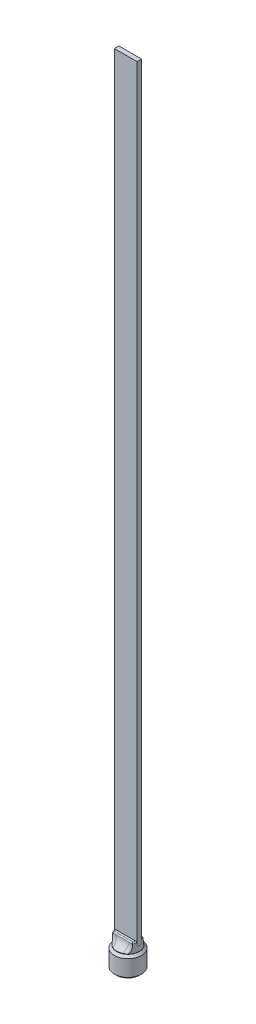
ISO-10303-21;
HEADER;
FILE_DESCRIPTION(('STEP AP214'),'2;1');
FILE_NAME('part.step','',(''),(''),'','','');
FILE_SCHEMA(('AUTOMOTIVE_DESIGN { 1 0 10303 214 1 1 1 1 }'));
ENDSEC;
DATA;
#1=APPLICATION_CONTEXT('core data for automotive mechanical design processes');
#2=APPLICATION_PROTOCOL_DEFINITION('international standard','automotive_design',2000,#1);
#3=PRODUCT_CONTEXT('',#1,'mechanical');
#4=PRODUCT('Part','Part','',(#3));
#5=PRODUCT_RELATED_PRODUCT_CATEGORY('part','',(#4));
#6=PRODUCT_DEFINITION_FORMATION('','',#4);
#7=PRODUCT_DEFINITION_CONTEXT('part definition',#1,'design');
#8=PRODUCT_DEFINITION('design','',#6,#7);
#9=PRODUCT_DEFINITION_SHAPE('','',#8);
#10=(LENGTH_UNIT() NAMED_UNIT(*) SI_UNIT(.MILLI.,.METRE.));
#11=(NAMED_UNIT(*) PLANE_ANGLE_UNIT() SI_UNIT($,.RADIAN.));
#12=(NAMED_UNIT(*) SI_UNIT($,.STERADIAN.) SOLID_ANGLE_UNIT());
#13=UNCERTAINTY_MEASURE_WITH_UNIT(LENGTH_MEASURE(1.E-05),#10,'distance_accuracy_value','');
#14=(GEOMETRIC_REPRESENTATION_CONTEXT(3) GLOBAL_UNCERTAINTY_ASSIGNED_CONTEXT((#13)) GLOBAL_UNIT_ASSIGNED_CONTEXT((#10,
#11,#12)) REPRESENTATION_CONTEXT('',''));
#15=CARTESIAN_POINT('',(0.,0.,0.));
#16=DIRECTION('',(0.,0.,1.));
#17=DIRECTION('',(1.,0.,0.));
#18=AXIS2_PLACEMENT_3D('',#15,#16,#17);
#19=CARTESIAN_POINT('',(0.,8.3312,0.));
#20=DIRECTION('',(0.,-1.,0.));
#21=DIRECTION('',(0.,0.,-1.));
#22=AXIS2_PLACEMENT_3D('',#19,#20,#21);
#23=PLANE('',#22);
#24=DIRECTION('',(-0.866025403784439,0.,0.5));
#25=VECTOR('',#24,1.);
#26=CARTESIAN_POINT('',(0.,8.3312,-3.66617420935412));
#27=LINE('',#26,#25);
#28=CARTESIAN_POINT('',(-3.175,8.3312,-1.83308710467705));
#29=VERTEX_POINT('',#28);
#30=CARTESIAN_POINT('',(0.,8.3312,-3.66617420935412));
#31=VERTEX_POINT('',#30);
#32=EDGE_CURVE('E855',#29,#31,#27,.F.);
#33=ORIENTED_EDGE('',*,*,#32,.T.);
#34=DIRECTION('',(-0.866025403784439,0.,-0.5));
#35=VECTOR('',#34,1.);
#36=CARTESIAN_POINT('',(3.175,8.3312,-1.83308710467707));
#37=LINE('',#36,#35);
#38=CARTESIAN_POINT('',(3.175,8.3312,-1.83308710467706));
#39=VERTEX_POINT('',#38);
#40=EDGE_CURVE('E850',#31,#39,#37,.F.);
#41=ORIENTED_EDGE('',*,*,#40,.T.);
#42=DIRECTION('',(0.,0.,-1.));
#43=VECTOR('',#42,1.);
#44=CARTESIAN_POINT('',(3.175,8.3312,1.83308710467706));
#45=LINE('',#44,#43);
#46=CARTESIAN_POINT('',(3.175,8.3312,1.83308710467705));
#47=VERTEX_POINT('',#46);
#48=EDGE_CURVE('E841',#39,#47,#45,.F.);
#49=ORIENTED_EDGE('',*,*,#48,.T.);
#50=DIRECTION('',(0.866025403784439,0.,-0.5));
#51=VECTOR('',#50,1.);
#52=CARTESIAN_POINT('',(0.,8.3312,3.66617420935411));
#53=LINE('',#52,#51);
#54=CARTESIAN_POINT('',(0.,8.3312,3.66617420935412));
#55=VERTEX_POINT('',#54);
#56=EDGE_CURVE('E827',#47,#55,#53,.F.);
#57=ORIENTED_EDGE('',*,*,#56,.T.);
#58=DIRECTION('',(0.866025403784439,0.,0.5));
#59=VECTOR('',#58,1.);
#60=CARTESIAN_POINT('',(-3.175,8.3312,1.83308710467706));
#61=LINE('',#60,#59);
#62=CARTESIAN_POINT('',(-3.175,8.3312,1.83308710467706));
#63=VERTEX_POINT('',#62);
#64=EDGE_CURVE('E169',#55,#63,#61,.F.);
#65=ORIENTED_EDGE('',*,*,#64,.T.);
#66=DIRECTION('',(0.,0.,1.));
#67=VECTOR('',#66,1.);
#68=CARTESIAN_POINT('',(-3.175,8.3312,-1.83308710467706));
#69=LINE('',#68,#67);
#70=EDGE_CURVE('E858',#63,#29,#69,.F.);
#71=ORIENTED_EDGE('',*,*,#70,.T.);
#72=EDGE_LOOP('',(#33,#41,#49,#57,#65,#71));
#73=FACE_BOUND('',#72,.T.);
#74=ADVANCED_FACE('F35',(#73),#23,.T.);
#75=CARTESIAN_POINT('',(-3.175,0.,1.83308710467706));
#76=DIRECTION('',(-0.5,0.,0.866025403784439));
#77=DIRECTION('',(0.866025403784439,0.,0.5));
#78=AXIS2_PLACEMENT_3D('',#75,#76,#77);
#79=PLANE('',#78);
#80=DIRECTION('',(0.,1.,0.));
#81=VECTOR('',#80,1.);
#82=CARTESIAN_POINT('',(-3.175,0.,1.83308710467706));
#83=LINE('',#82,#81);
#84=CARTESIAN_POINT('',(-3.17499993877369,0.118425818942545,1.83308715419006));
#85=VERTEX_POINT('',#84);
#86=EDGE_CURVE('E790',#85,#63,#83,.T.);
#87=ORIENTED_EDGE('',*,*,#86,.T.);
#88=ORIENTED_EDGE('',*,*,#64,.F.);
#89=DIRECTION('',(0.,1.,0.));
#90=VECTOR('',#89,1.);
#91=CARTESIAN_POINT('',(0.,0.,3.66617420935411));
#92=LINE('',#91,#90);
#93=CARTESIAN_POINT('',(7.34857979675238E-08,0.118425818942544,3.66617418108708));
#94=VERTEX_POINT('',#93);
#95=EDGE_CURVE('E825',#55,#94,#92,.F.);
#96=ORIENTED_EDGE('',*,*,#95,.T.);
#97=CARTESIAN_POINT('',(0.,0.118425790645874,3.66617420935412));
#98=CARTESIAN_POINT('',(-0.441441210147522,0.373291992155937,3.41130800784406));
#99=CARTESIAN_POINT('',(-0.837272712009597,0.493539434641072,3.18277458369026));
#100=CARTESIAN_POINT('',(-1.21954352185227,0.60966735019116,2.96207042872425));
#101=CARTESIAN_POINT('',(-1.5875,0.609599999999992,2.7496306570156));
#102=CARTESIAN_POINT('',(-1.95630488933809,0.609532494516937,2.5367010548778));
#103=CARTESIAN_POINT('',(-2.3377272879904,0.493539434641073,2.31648673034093));
#104=CARTESIAN_POINT('',(-2.73402548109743,0.373022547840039,2.08768386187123));
#105=CARTESIAN_POINT('',(-3.175,0.118425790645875,1.83308710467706));
#106=B_SPLINE_CURVE_WITH_KNOTS('',2,(#97,#98,#99,#100,#101,#102,#103,#104,#105),.UNSPECIFIED.,
.F.,.F.,(3,2,2,2,3),(0.,0.25,0.5,0.75,1.),.UNSPECIFIED.);
#107=EDGE_CURVE('E820',#94,#85,#106,.T.);
#108=ORIENTED_EDGE('',*,*,#107,.T.);
#109=EDGE_LOOP('',(#87,#88,#96,#108));
#110=FACE_BOUND('',#109,.T.);
#111=ADVANCED_FACE('F802',(#110),#79,.F.);
#112=CARTESIAN_POINT('',(-3.175,0.,-1.83308710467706));
#113=DIRECTION('',(-1.,0.,0.));
#114=DIRECTION('',(0.,0.,1.));
#115=AXIS2_PLACEMENT_3D('',#112,#113,#114);
#116=PLANE('',#115);
#117=DIRECTION('',(0.,1.,0.));
#118=VECTOR('',#117,1.);
#119=CARTESIAN_POINT('',(-3.175,0.,-1.83308710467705));
#120=LINE('',#119,#118);
#121=CARTESIAN_POINT('',(-3.17500001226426,0.118425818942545,-1.83308702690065));
#122=VERTEX_POINT('',#121);
#123=EDGE_CURVE('E857',#122,#29,#120,.T.);
#124=ORIENTED_EDGE('',*,*,#123,.T.);
#125=ORIENTED_EDGE('',*,*,#70,.F.);
#126=ORIENTED_EDGE('',*,*,#86,.F.);
#127=CARTESIAN_POINT('',(-3.175,0.118425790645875,1.83308710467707));
#128=CARTESIAN_POINT('',(-3.175,0.373291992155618,1.32335470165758));
#129=CARTESIAN_POINT('',(-3.175,0.493539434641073,0.86628785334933));
#130=CARTESIAN_POINT('',(-3.175,0.609667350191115,0.424879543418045));
#131=CARTESIAN_POINT('',(-3.175,0.609599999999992,0.));
#132=CARTESIAN_POINT('',(-3.175,0.609532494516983,-0.42585920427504));
#133=CARTESIAN_POINT('',(-3.175,0.493539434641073,-0.866287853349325));
#134=CARTESIAN_POINT('',(-3.175,0.373022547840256,-1.32389359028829));
#135=CARTESIAN_POINT('',(-3.175,0.118425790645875,-1.83308710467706));
#136=B_SPLINE_CURVE_WITH_KNOTS('',2,(#127,#128,#129,#130,#131,#132,#133,#134,#135),
.UNSPECIFIED.,.F.,.F.,(3,2,2,2,3),(0.,0.25,0.5,0.75,1.),.UNSPECIFIED.);
#137=EDGE_CURVE('E784',#85,#122,#136,.T.);
#138=ORIENTED_EDGE('',*,*,#137,.T.);
#139=EDGE_LOOP('',(#124,#125,#126,#138));
#140=FACE_BOUND('',#139,.T.);
#141=ADVANCED_FACE('F792',(#140),#116,.F.);
#142=CARTESIAN_POINT('',(0.,0.,-3.66617420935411));
#143=DIRECTION('',(-0.5,0.,-0.866025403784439));
#144=DIRECTION('',(-0.866025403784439,0.,0.5));
#145=AXIS2_PLACEMENT_3D('',#142,#143,#144);
#146=PLANE('',#145);
#147=DIRECTION('',(0.,1.,0.));
#148=VECTOR('',#147,1.);
#149=CARTESIAN_POINT('',(0.,0.,-3.66617420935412));
#150=LINE('',#149,#148);
#151=CARTESIAN_POINT('',(0.,0.118425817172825,-3.66617418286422));
#152=VERTEX_POINT('',#151);
#153=EDGE_CURVE('E854',#152,#31,#150,.T.);
#154=ORIENTED_EDGE('',*,*,#153,.T.);
#155=ORIENTED_EDGE('',*,*,#32,.F.);
#156=ORIENTED_EDGE('',*,*,#123,.F.);
#157=CARTESIAN_POINT('',(-3.175,0.118425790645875,-1.83308710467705));
#158=CARTESIAN_POINT('',(-2.73355878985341,0.373291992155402,-2.08795330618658));
#159=CARTESIAN_POINT('',(-2.3377272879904,0.493539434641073,-2.31648673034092));
#160=CARTESIAN_POINT('',(-1.95545647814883,0.609667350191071,-2.53719088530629));
#161=CARTESIAN_POINT('',(-1.5875,0.609599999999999,-2.74963065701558));
#162=CARTESIAN_POINT('',(-1.21869511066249,0.60953249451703,-2.96256025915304));
#163=CARTESIAN_POINT('',(-0.837272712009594,0.493539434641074,-3.18277458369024));
#164=CARTESIAN_POINT('',(-0.440974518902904,0.373022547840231,-3.41157745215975));
#165=CARTESIAN_POINT('',(0.,0.118425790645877,-3.66617420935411));
#166=B_SPLINE_CURVE_WITH_KNOTS('',2,(#157,#158,#159,#160,#161,#162,#163,#164,#165),
.UNSPECIFIED.,.F.,.F.,(3,2,2,2,3),(0.,0.25,0.5,0.75,1.),.UNSPECIFIED.);
#167=EDGE_CURVE('E826',#122,#152,#166,.T.);
#168=ORIENTED_EDGE('',*,*,#167,.T.);
#169=EDGE_LOOP('',(#154,#155,#156,#168));
#170=FACE_BOUND('',#169,.T.);
#171=ADVANCED_FACE('F801',(#170),#146,.F.);
#172=CARTESIAN_POINT('',(3.175,0.,-1.83308710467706));
#173=DIRECTION('',(0.5,0.,-0.866025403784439));
#174=DIRECTION('',(-0.866025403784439,0.,-0.5));
#175=AXIS2_PLACEMENT_3D('',#172,#173,#174);
#176=PLANE('',#175);
#177=DIRECTION('',(0.,1.,0.));
#178=VECTOR('',#177,1.);
#179=CARTESIAN_POINT('',(3.175,0.,-1.83308710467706));
#180=LINE('',#179,#178);
#181=CARTESIAN_POINT('',(3.17500001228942,0.118425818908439,-1.8330870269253));
#182=VERTEX_POINT('',#181);
#183=EDGE_CURVE('E847',#182,#39,#180,.T.);
#184=ORIENTED_EDGE('',*,*,#183,.T.);
#185=ORIENTED_EDGE('',*,*,#40,.F.);
#186=ORIENTED_EDGE('',*,*,#153,.F.);
#187=CARTESIAN_POINT('',(0.,0.118425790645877,-3.66617420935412));
#188=CARTESIAN_POINT('',(0.44144121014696,0.373291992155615,-3.41130800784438));
#189=CARTESIAN_POINT('',(0.837272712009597,0.493539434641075,-3.18277458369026));
#190=CARTESIAN_POINT('',(1.21954352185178,0.609667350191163,-2.96207042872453));
#191=CARTESIAN_POINT('',(1.5875,0.6096,-2.7496306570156));
#192=CARTESIAN_POINT('',(1.95630488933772,0.609532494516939,-2.53670105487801));
#193=CARTESIAN_POINT('',(2.3377272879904,0.493539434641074,-2.31648673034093));
#194=CARTESIAN_POINT('',(2.734025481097,0.373022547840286,-2.08768386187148));
#195=CARTESIAN_POINT('',(3.175,0.118425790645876,-1.83308710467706));
#196=B_SPLINE_CURVE_WITH_KNOTS('',2,(#187,#188,#189,#190,#191,#192,#193,#194,#195),
.UNSPECIFIED.,.F.,.F.,(3,2,2,2,3),(0.,0.25,0.5,0.75,1.),.UNSPECIFIED.);
#197=EDGE_CURVE('E925',#152,#182,#196,.T.);
#198=ORIENTED_EDGE('',*,*,#197,.T.);
#199=EDGE_LOOP('',(#184,#185,#186,#198));
#200=FACE_BOUND('',#199,.T.);
#201=ADVANCED_FACE('F935',(#200),#176,.F.);
#202=CARTESIAN_POINT('',(3.175,0.,1.83308710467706));
#203=DIRECTION('',(1.,0.,0.));
#204=DIRECTION('',(0.,0.,-1.));
#205=AXIS2_PLACEMENT_3D('',#202,#203,#204);
#206=PLANE('',#205);
#207=DIRECTION('',(0.,1.,0.));
#208=VECTOR('',#207,1.);
#209=CARTESIAN_POINT('',(3.175,0.,1.83308710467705));
#210=LINE('',#209,#208);
#211=CARTESIAN_POINT('',(3.1750000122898,0.118425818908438,1.83308702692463));
#212=VERTEX_POINT('',#211);
#213=EDGE_CURVE('E830',#212,#47,#210,.T.);
#214=ORIENTED_EDGE('',*,*,#213,.T.);
#215=ORIENTED_EDGE('',*,*,#48,.F.);
#216=ORIENTED_EDGE('',*,*,#183,.F.);
#217=CARTESIAN_POINT('',(3.175,0.118425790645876,-1.83308710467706));
#218=CARTESIAN_POINT('',(3.175,0.373291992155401,-1.32335470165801));
#219=CARTESIAN_POINT('',(3.175,0.493539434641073,-0.86628785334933));
#220=CARTESIAN_POINT('',(3.175,0.609667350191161,-0.42487954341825));
#221=CARTESIAN_POINT('',(3.175,0.609599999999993,0.));
#222=CARTESIAN_POINT('',(3.175,0.609532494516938,0.425859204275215));
#223=CARTESIAN_POINT('',(3.175,0.493539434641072,0.866287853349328));
#224=CARTESIAN_POINT('',(3.175,0.373022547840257,1.32389359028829));
#225=CARTESIAN_POINT('',(3.175,0.118425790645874,1.83308710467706));
#226=B_SPLINE_CURVE_WITH_KNOTS('',2,(#217,#218,#219,#220,#221,#222,#223,#224,#225),
.UNSPECIFIED.,.F.,.F.,(3,2,2,2,3),(0.,0.25,0.5,0.75,1.),.UNSPECIFIED.);
#227=EDGE_CURVE('E923',#182,#212,#226,.T.);
#228=ORIENTED_EDGE('',*,*,#227,.T.);
#229=EDGE_LOOP('',(#214,#215,#216,#228));
#230=FACE_BOUND('',#229,.T.);
#231=ADVANCED_FACE('F949',(#230),#206,.F.);
#232=CARTESIAN_POINT('',(0.,0.,3.66617420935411));
#233=DIRECTION('',(0.5,0.,0.866025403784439));
#234=DIRECTION('',(0.866025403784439,0.,-0.5));
#235=AXIS2_PLACEMENT_3D('',#232,#233,#234);
#236=PLANE('',#235);
#237=ORIENTED_EDGE('',*,*,#95,.F.);
#238=ORIENTED_EDGE('',*,*,#56,.F.);
#239=ORIENTED_EDGE('',*,*,#213,.F.);
#240=CARTESIAN_POINT('',(3.17499999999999,0.118425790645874,1.83308710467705));
#241=CARTESIAN_POINT('',(2.73355878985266,0.37329199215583,2.08795330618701));
#242=CARTESIAN_POINT('',(2.3377272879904,0.493539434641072,2.31648673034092));
#243=CARTESIAN_POINT('',(1.95545647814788,0.60966735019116,2.53719088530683));
#244=CARTESIAN_POINT('',(1.5875,0.609599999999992,2.74963065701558));
#245=CARTESIAN_POINT('',(1.21869511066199,0.609532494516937,2.96256025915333));
#246=CARTESIAN_POINT('',(0.837272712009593,0.493539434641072,3.18277458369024));
#247=CARTESIAN_POINT('',(0.440974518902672,0.373022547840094,3.41157745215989));
#248=CARTESIAN_POINT('',(0.,0.118425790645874,3.66617420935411));
#249=B_SPLINE_CURVE_WITH_KNOTS('',2,(#240,#241,#242,#243,#244,#245,#246,#247,#248),
.UNSPECIFIED.,.F.,.F.,(3,2,2,2,3),(0.,0.25,0.5,0.75,1.),.UNSPECIFIED.);
#250=EDGE_CURVE('E823',#212,#94,#249,.T.);
#251=ORIENTED_EDGE('',*,*,#250,.T.);
#252=EDGE_LOOP('',(#237,#238,#239,#251));
#253=FACE_BOUND('',#252,.T.);
#254=ADVANCED_FACE('F737',(#253),#236,.F.);
#255=CARTESIAN_POINT('',(0.,5.6843418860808E-11,0.));
#256=DIRECTION('',(0.,-1.,0.));
#257=DIRECTION('',(0.,0.,-1.));
#258=AXIS2_PLACEMENT_3D('',#255,#256,#257);
#259=CONICAL_SURFACE('',#258,3.78460000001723,0.785398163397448);
#260=CARTESIAN_POINT('',(0.,5.6844286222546E-11,0.));
#261=DIRECTION('',(0.,-1.,0.));
#262=DIRECTION('',(0.,0.,-1.));
#263=AXIS2_PLACEMENT_3D('',#260,#261,#262);
#264=CIRCLE('',#263,3.78460000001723);
#265=CARTESIAN_POINT('',(0.,5.6844286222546E-11,-3.78460000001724));
#266=VERTEX_POINT('',#265);
#267=EDGE_CURVE('E919',#266,#266,#264,.F.);
#268=ORIENTED_EDGE('',*,*,#267,.F.);
#269=EDGE_LOOP('',(#268));
#270=FACE_BOUND('',#269,.T.);
#271=ORIENTED_EDGE('',*,*,#227,.F.);
#272=ORIENTED_EDGE('',*,*,#197,.F.);
#273=ORIENTED_EDGE('',*,*,#167,.F.);
#274=ORIENTED_EDGE('',*,*,#137,.F.);
#275=ORIENTED_EDGE('',*,*,#107,.F.);
#276=ORIENTED_EDGE('',*,*,#250,.F.);
#277=EDGE_LOOP('',(#271,#272,#273,#274,#275,#276));
#278=FACE_BOUND('',#277,.T.);
#279=ADVANCED_FACE('F732',(#270,#278),#259,.F.);
#280=CARTESIAN_POINT('',(0.,0.,-3.1496));
#281=DIRECTION('',(0.,-1.,0.));
#282=DIRECTION('',(0.,0.,-1.));
#283=AXIS2_PLACEMENT_3D('',#280,#281,#282);
#284=PLANE('',#283);
#285=ORIENTED_EDGE('',*,*,#267,.T.);
#286=EDGE_LOOP('',(#285));
#287=FACE_BOUND('',#286,.T.);
#288=CARTESIAN_POINT('',(0.,5.68426599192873E-11,0.));
#289=DIRECTION('',(0.,1.,0.));
#290=DIRECTION('',(0.,0.,1.));
#291=AXIS2_PLACEMENT_3D('',#288,#289,#290);
#292=CIRCLE('',#291,5.71500000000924);
#293=CARTESIAN_POINT('',(0.,5.68426599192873E-11,5.71500000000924));
#294=VERTEX_POINT('',#293);
#295=EDGE_CURVE('E910',#294,#294,#292,.T.);
#296=ORIENTED_EDGE('',*,*,#295,.F.);
#297=EDGE_LOOP('',(#296));
#298=FACE_BOUND('',#297,.T.);
#299=ADVANCED_FACE('F728',(#287,#298),#284,.T.);
#300=CARTESIAN_POINT('',(0.,0.801000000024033,0.));
#301=DIRECTION('',(0.,1.,0.));
#302=DIRECTION('',(0.,0.,1.));
#303=AXIS2_PLACEMENT_3D('',#300,#301,#302);
#304=CONICAL_SURFACE('',#303,6.51599999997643,0.785398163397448);
#305=CARTESIAN_POINT('',(0.,0.801,0.));
#306=DIRECTION('',(0.,-1.,0.));
#307=DIRECTION('',(0.,0.,-1.));
#308=AXIS2_PLACEMENT_3D('',#305,#306,#307);
#309=CIRCLE('',#308,6.516);
#310=CARTESIAN_POINT('',(0.,0.801,-6.516));
#311=VERTEX_POINT('',#310);
#312=EDGE_CURVE('E918',#311,#311,#309,.F.);
#313=ORIENTED_EDGE('',*,*,#312,.F.);
#314=EDGE_LOOP('',(#313));
#315=FACE_BOUND('',#314,.T.);
#316=ORIENTED_EDGE('',*,*,#295,.T.);
#317=EDGE_LOOP('',(#316));
#318=FACE_BOUND('',#317,.T.);
#319=ADVANCED_FACE('F724',(#315,#318),#304,.T.);
#320=CARTESIAN_POINT('',(0.,4.826,0.));
#321=DIRECTION('',(0.,-1.,0.));
#322=DIRECTION('',(0.,0.,-1.));
#323=AXIS2_PLACEMENT_3D('',#320,#321,#322);
#324=CYLINDRICAL_SURFACE('',#323,6.516);
#325=CARTESIAN_POINT('',(0.,8.596999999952,0.));
#326=DIRECTION('',(0.,-1.,0.));
#327=DIRECTION('',(0.,0.,1.));
#328=AXIS2_PLACEMENT_3D('',#325,#326,#327);
#329=CIRCLE('',#328,6.51599999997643);
#330=CARTESIAN_POINT('',(0.,8.596999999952,6.51599999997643));
#331=VERTEX_POINT('',#330);
#332=EDGE_CURVE('E1258',#331,#331,#329,.F.);
#333=ORIENTED_EDGE('',*,*,#332,.F.);
#334=EDGE_LOOP('',(#333));
#335=FACE_BOUND('',#334,.T.);
#336=ORIENTED_EDGE('',*,*,#312,.T.);
#337=EDGE_LOOP('',(#336));
#338=FACE_BOUND('',#337,.T.);
#339=ADVANCED_FACE('F720',(#335,#338),#324,.T.);
#340=CARTESIAN_POINT('',(0.,8.59700000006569,0.));
#341=DIRECTION('',(0.,-1.,0.));
#342=DIRECTION('',(0.,0.,-1.));
#343=AXIS2_PLACEMENT_3D('',#340,#341,#342);
#344=CONICAL_SURFACE('',#343,6.51599999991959,0.785398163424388);
#345=CARTESIAN_POINT('',(0.,9.652,0.));
#346=DIRECTION('',(0.,-1.,0.));
#347=DIRECTION('',(-1.,0.,-1.12769188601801E-10));
#348=AXIS2_PLACEMENT_3D('',#345,#346,#347);
#349=CIRCLE('',#348,5.461);
#350=CARTESIAN_POINT('',(-5.461,9.652,-6.15833416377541E-10));
#351=VERTEX_POINT('',#350);
#352=EDGE_CURVE('E1115',#351,#351,#349,.T.);
#353=ORIENTED_EDGE('',*,*,#352,.T.);
#354=EDGE_LOOP('',(#353));
#355=FACE_BOUND('',#354,.T.);
#356=ORIENTED_EDGE('',*,*,#332,.T.);
#357=EDGE_LOOP('',(#356));
#358=FACE_BOUND('',#357,.T.);
#359=ADVANCED_FACE('F715',(#355,#358),#344,.T.);
#360=CARTESIAN_POINT('',(0.,9.8298,2.5781));
#361=DIRECTION('',(0.,0.,-1.));
#362=DIRECTION('',(-1.,0.,0.));
#363=AXIS2_PLACEMENT_3D('',#360,#361,#362);
#364=PLANE('',#363);
#365=DIRECTION('',(1.,0.,0.));
#366=VECTOR('',#365,1.);
#367=CARTESIAN_POINT('',(0.,13.7668,2.5781));
#368=LINE('',#367,#366);
#369=CARTESIAN_POINT('',(-4.75643400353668,13.7668,2.5781));
#370=VERTEX_POINT('',#369);
#371=CARTESIAN_POINT('',(-3.3741041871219,13.7667999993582,2.5781));
#372=VERTEX_POINT('',#371);
#373=EDGE_CURVE('E1118',#370,#372,#368,.T.);
#374=ORIENTED_EDGE('',*,*,#373,.F.);
#375=DIRECTION('',(0.,1.,0.));
#376=VECTOR('',#375,1.);
#377=CARTESIAN_POINT('',(-4.75643400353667,9.8298,2.5781));
#378=LINE('',#377,#376);
#379=CARTESIAN_POINT('',(-4.75643400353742,13.2206846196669,2.5781000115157));
#380=VERTEX_POINT('',#379);
#381=EDGE_CURVE('E702',#380,#370,#378,.T.);
#382=ORIENTED_EDGE('',*,*,#381,.F.);
#383=CARTESIAN_POINT('',(-3.37410418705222,13.7667999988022,2.5781));
#384=CARTESIAN_POINT('',(-3.4338096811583,13.7499335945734,2.57810000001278));
#385=CARTESIAN_POINT('',(-3.49333317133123,13.732415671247,2.57810000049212));
#386=CARTESIAN_POINT('',(-3.61196474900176,13.6960104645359,2.57810000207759));
#387=CARTESIAN_POINT('',(-3.67107280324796,13.677123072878,2.57810000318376));
#388=CARTESIAN_POINT('',(-3.78880849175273,13.6379166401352,2.57810000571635));
#389=CARTESIAN_POINT('',(-3.84743615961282,13.6175977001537,2.57810000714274));
#390=CARTESIAN_POINT('',(-3.96414460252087,13.5754661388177,2.57810001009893));
#391=CARTESIAN_POINT('',(-4.02222544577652,13.5536537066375,2.57810001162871));
#392=CARTESIAN_POINT('',(-4.13777422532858,13.5084731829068,2.57810001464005));
#393=CARTESIAN_POINT('',(-4.19524221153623,13.4851052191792,2.57810001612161));
#394=CARTESIAN_POINT('',(-4.30949912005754,13.4367519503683,2.57810001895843));
#395=CARTESIAN_POINT('',(-4.36628799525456,13.4117665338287,2.57810002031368));
#396=CARTESIAN_POINT('',(-4.47912100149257,13.3601163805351,2.57810002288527));
#397=CARTESIAN_POINT('',(-4.53516487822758,13.3334510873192,2.57810002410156));
#398=CARTESIAN_POINT('',(-4.6464409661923,13.2783812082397,2.57810002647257));
#399=CARTESIAN_POINT('',(-4.70167256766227,13.2499753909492,2.57810002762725));
#400=CARTESIAN_POINT('',(-4.75643400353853,13.220684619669,2.57810002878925));
#401=B_SPLINE_CURVE_WITH_KNOTS('',3,(#383,#384,#385,#386,#387,#388,#389,#390,#391,#392,#393,
#394,#395,#396,#397,#398,#399,#400),.UNSPECIFIED.,.F.,.F.,(4,2,2,2,2,2,2,2,4),(0.,
0.186125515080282,0.372265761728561,0.558392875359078,0.744496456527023,0.930584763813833,
1.11668590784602,1.3028490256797,1.4891454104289),.UNSPECIFIED.);
#402=EDGE_CURVE('E696',#372,#380,#401,.T.);
#403=ORIENTED_EDGE('',*,*,#402,.F.);
#404=EDGE_LOOP('',(#374,#382,#403));
#405=FACE_BOUND('',#404,.T.);
#406=ADVANCED_FACE('F704',(#405),#364,.F.);
#407=CARTESIAN_POINT('',(0.,9.8298,2.5781));
#408=DIRECTION('',(0.,0.,-1.));
#409=DIRECTION('',(-1.,0.,0.));
#410=AXIS2_PLACEMENT_3D('',#407,#408,#409);
#411=PLANE('',#410);
#412=DIRECTION('',(0.,1.,0.));
#413=VECTOR('',#412,1.);
#414=CARTESIAN_POINT('',(4.75643400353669,9.8298,2.5781));
#415=LINE('',#414,#413);
#416=CARTESIAN_POINT('',(4.75643400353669,13.7668,2.5781));
#417=VERTEX_POINT('',#416);
#418=CARTESIAN_POINT('',(4.75643402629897,13.2206845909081,2.57809999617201));
#419=VERTEX_POINT('',#418);
#420=EDGE_CURVE('E1175',#417,#419,#415,.F.);
#421=ORIENTED_EDGE('',*,*,#420,.F.);
#422=DIRECTION('',(1.,0.,0.));
#423=VECTOR('',#422,1.);
#424=CARTESIAN_POINT('',(0.,13.7668,2.5781));
#425=LINE('',#424,#423);
#426=CARTESIAN_POINT('',(3.3741041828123,13.7667999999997,2.5781));
#427=VERTEX_POINT('',#426);
#428=EDGE_CURVE('E1121',#427,#417,#425,.T.);
#429=ORIENTED_EDGE('',*,*,#428,.F.);
#430=CARTESIAN_POINT('',(4.75643403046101,13.220684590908,2.57809999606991));
#431=CARTESIAN_POINT('',(4.70162134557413,13.2499347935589,2.57809999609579));
#432=CARTESIAN_POINT('',(4.6463424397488,13.2783050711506,2.57809999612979));
#433=CARTESIAN_POINT('',(4.53491638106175,13.3333505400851,2.57809999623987));
#434=CARTESIAN_POINT('',(4.47876885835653,13.3600249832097,2.57809999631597));
#435=CARTESIAN_POINT('',(4.36570800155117,13.4117225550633,2.57809999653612));
#436=CARTESIAN_POINT('',(4.30879453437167,13.4367453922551,2.57809999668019));
#437=CARTESIAN_POINT('',(4.19430202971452,13.485183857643,2.57809999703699));
#438=CARTESIAN_POINT('',(4.13672312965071,13.5085998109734,2.57809999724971));
#439=CARTESIAN_POINT('',(4.02100057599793,13.5538683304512,2.57809999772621));
#440=CARTESIAN_POINT('',(3.96285733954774,13.5757219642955,2.57809999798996));
#441=CARTESIAN_POINT('',(3.84610667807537,13.6179095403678,2.57809999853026));
#442=CARTESIAN_POINT('',(3.78749994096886,13.6382453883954,2.57809999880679));
#443=CARTESIAN_POINT('',(3.66992326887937,13.6774411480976,2.57809999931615));
#444=CARTESIAN_POINT('',(3.61095427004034,13.696303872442,2.57809999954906));
#445=CARTESIAN_POINT('',(3.49275271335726,13.7325964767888,2.57809999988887));
#446=CARTESIAN_POINT('',(3.43352131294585,13.7500301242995,2.57809999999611));
#447=CARTESIAN_POINT('',(3.3741041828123,13.766799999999,2.5781));
#448=B_SPLINE_CURVE_WITH_KNOTS('',3,(#430,#431,#432,#433,#434,#435,#436,#437,#438,#439,#440,
#441,#442,#443,#444,#445,#446,#447),.UNSPECIFIED.,.F.,.F.,(4,2,2,2,2,2,2,2,4),(0.,
0.186374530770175,0.372830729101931,0.55931975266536,0.745770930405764,0.932093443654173,
1.11817792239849,1.30389794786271,1.48911145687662),.UNSPECIFIED.);
#449=EDGE_CURVE('E689',#419,#427,#448,.T.);
#450=ORIENTED_EDGE('',*,*,#449,.F.);
#451=EDGE_LOOP('',(#421,#429,#450));
#452=FACE_BOUND('',#451,.T.);
#453=ADVANCED_FACE('F714',(#452),#411,.F.);
#454=CARTESIAN_POINT('',(0.,13.7668,2.0701));
#455=DIRECTION('',(1.,0.,0.));
#456=DIRECTION('',(0.,0.,-1.));
#457=AXIS2_PLACEMENT_3D('',#454,#455,#456);
#458=CYLINDRICAL_SURFACE('',#457,0.508);
#459=CARTESIAN_POINT('',(-4.75643400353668,13.7668,2.5781));
#460=CARTESIAN_POINT('',(-4.75643428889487,13.7752472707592,2.57810039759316));
#461=CARTESIAN_POINT('',(-4.75631085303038,13.783694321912,2.57788509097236));
#462=CARTESIAN_POINT('',(-4.75581565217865,13.8006043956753,2.57702671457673));
#463=CARTESIAN_POINT('',(-4.75544257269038,13.8090672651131,2.57638138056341));
#464=CARTESIAN_POINT('',(-4.75444411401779,13.8259873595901,2.57466139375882));
#465=CARTESIAN_POINT('',(-4.75381718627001,13.8344442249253,2.57358410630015));
#466=CARTESIAN_POINT('',(-4.75230816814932,13.8513304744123,2.57100002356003));
#467=CARTESIAN_POINT('',(-4.75142431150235,13.8597592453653,2.56949025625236));
#468=CARTESIAN_POINT('',(-4.74939917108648,13.8765670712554,2.5660416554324));
#469=CARTESIAN_POINT('',(-4.74825592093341,13.8849452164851,2.56409954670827));
#470=CARTESIAN_POINT('',(-4.74571050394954,13.9016292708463,2.55978755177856));
#471=CARTESIAN_POINT('',(-4.74430619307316,13.909933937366,2.55741412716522));
#472=CARTESIAN_POINT('',(-4.74123793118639,13.9264482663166,2.55224159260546));
#473=CARTESIAN_POINT('',(-4.73957168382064,13.9346563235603,2.54943872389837));
#474=CARTESIAN_POINT('',(-4.73597963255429,13.9509544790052,2.54341022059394));
#475=CARTESIAN_POINT('',(-4.73405140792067,13.9590425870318,2.54018065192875));
#476=CARTESIAN_POINT('',(-4.7299363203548,13.9750777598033,2.53330249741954));
#477=CARTESIAN_POINT('',(-4.72774694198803,13.9830224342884,2.52964984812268));
#478=CARTESIAN_POINT('',(-4.72311132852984,13.9987475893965,2.52193011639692));
#479=CARTESIAN_POINT('',(-4.72066251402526,14.006525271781,2.51785888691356));
#480=CARTESIAN_POINT('',(-4.71551070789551,14.0218932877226,2.50930740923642));
#481=CARTESIAN_POINT('',(-4.71280510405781,14.0294804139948,2.50482297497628));
#482=CARTESIAN_POINT('',(-4.70714330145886,14.0444442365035,2.49545134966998));
#483=CARTESIAN_POINT('',(-4.70418448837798,14.0518173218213,2.49055997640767));
#484=CARTESIAN_POINT('',(-4.69802086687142,14.0663300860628,2.48038150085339));
#485=CARTESIAN_POINT('',(-4.69481347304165,14.0734657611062,2.47509025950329));
#486=CARTESIAN_POINT('',(-4.68815799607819,14.0874810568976,2.4641201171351));
#487=CARTESIAN_POINT('',(-4.68470738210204,14.0943562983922,2.4584371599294));
#488=CARTESIAN_POINT('',(-4.67757277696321,14.1078279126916,2.44669159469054));
#489=CARTESIAN_POINT('',(-4.67388634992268,14.1144195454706,2.44062503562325));
#490=CARTESIAN_POINT('',(-4.66628460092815,14.1273032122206,2.4281243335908));
#491=CARTESIAN_POINT('',(-4.66236691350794,14.1335901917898,2.42168641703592));
#492=CARTESIAN_POINT('',(-4.65543892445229,14.1441383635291,2.41028084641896));
#493=CARTESIAN_POINT('',(-4.65246456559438,14.1484934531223,2.40537780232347));
#494=CARTESIAN_POINT('',(-4.64633477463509,14.15713012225,2.39525477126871));
#495=CARTESIAN_POINT('',(-4.6431766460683,14.1614038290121,2.39002969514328));
#496=CARTESIAN_POINT('',(-4.63666982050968,14.1698554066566,2.37926469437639));
#497=CARTESIAN_POINT('',(-4.63331829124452,14.1740251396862,2.37372009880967));
#498=CARTESIAN_POINT('',(-4.62641873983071,14.1822443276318,2.36231614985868));
#499=CARTESIAN_POINT('',(-4.62286787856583,14.1862853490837,2.35645243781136));
#500=CARTESIAN_POINT('',(-4.61556407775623,14.19422178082,2.3444120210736));
#501=CARTESIAN_POINT('',(-4.61180830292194,14.1981084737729,2.33823129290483));
#502=CARTESIAN_POINT('',(-4.60409052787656,14.2057097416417,2.32555932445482));
#503=CARTESIAN_POINT('',(-4.60012573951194,14.2094153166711,2.31906438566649));
#504=CARTESIAN_POINT('',(-4.5919871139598,14.2166268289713,2.30576753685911));
#505=CARTESIAN_POINT('',(-4.58781057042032,14.220123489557,2.29896225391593));
#506=CARTESIAN_POINT('',(-4.579247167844,14.2268886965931,2.28504929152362));
#507=CARTESIAN_POINT('',(-4.57485772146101,14.2301476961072,2.27793856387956));
#508=CARTESIAN_POINT('',(-4.5658689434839,14.2364082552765,2.26342039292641));
#509=CARTESIAN_POINT('',(-4.56126718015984,14.2394000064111,2.25601022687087));
#510=CARTESIAN_POINT('',(-4.55185606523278,14.2450960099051,2.24090000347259));
#511=CARTESIAN_POINT('',(-4.54704447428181,14.2477902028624,2.23319754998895));
#512=CARTESIAN_POINT('',(-4.53721803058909,14.2528604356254,2.21751075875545));
#513=CARTESIAN_POINT('',(-4.53220116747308,14.2552261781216,2.20952435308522));
#514=CARTESIAN_POINT('',(-4.52197070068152,14.2596084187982,2.1932788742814));
#515=CARTESIAN_POINT('',(-4.51675535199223,14.2616143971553,2.18501806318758));
#516=CARTESIAN_POINT('',(-4.50613678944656,14.2652457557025,2.16823422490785));
#517=CARTESIAN_POINT('',(-4.50073213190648,14.2668604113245,2.15970979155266));
#518=CARTESIAN_POINT('',(-4.48974634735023,14.2696777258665,2.14241038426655));
#519=CARTESIAN_POINT('',(-4.48416411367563,14.2708694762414,2.13363433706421));
#520=CARTESIAN_POINT('',(-4.47283721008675,14.2728096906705,2.115844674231));
#521=CARTESIAN_POINT('',(-4.46709180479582,14.273547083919,2.10683032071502));
#522=CARTESIAN_POINT('',(-4.45545550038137,14.2745479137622,2.08857800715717));
#523=CARTESIAN_POINT('',(-4.44956427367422,14.274800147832,2.0793396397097));
#524=CARTESIAN_POINT('',(-4.44367537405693,14.2748,2.0701));
#525=B_SPLINE_CURVE_WITH_KNOTS('',3,(#459,#460,#461,#462,#463,#464,#465,#466,#467,#468,#469,
#470,#471,#472,#473,#474,#475,#476,#477,#478,#479,#480,#481,#482,#483,#484,#485,#486,#487,#488,
#489,#490,#491,#492,#493,#494,#495,#496,#497,#498,#499,#500,#501,#502,#503,#504,#505,#506,#507,
#508,#509,#510,#511,#512,#513,#514,#515,#516,#517,#518,#519,#520,#521,#522,#523,#524),
.UNSPECIFIED.,.F.,.F.,(4,2,2,2,2,2,2,2,2,2,2,2,2,2,2,2,2,2,2,2,2,2,2,2,2,2,2,2,2,2,2,2,4),(0.,
0.0253378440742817,0.0508101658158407,0.0764402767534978,0.10225092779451,0.128264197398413,
0.154501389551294,0.180982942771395,0.20772835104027,0.234756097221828,0.262083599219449,
0.289727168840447,0.317701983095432,0.34602206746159,0.374700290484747,0.403748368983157,
0.433176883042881,0.454774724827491,0.477126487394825,0.500234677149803,0.524100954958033,
0.548726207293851,0.574110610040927,0.600253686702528,0.627154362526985,0.654811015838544,
0.683221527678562,0.712383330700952,0.742293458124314,0.772948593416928,0.80434512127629,
0.836479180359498,0.869346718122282),.UNSPECIFIED.);
#526=CARTESIAN_POINT('',(-4.44367537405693,14.2748,2.0701));
#527=VERTEX_POINT('',#526);
#528=EDGE_CURVE('E1112',#370,#527,#525,.T.);
#529=ORIENTED_EDGE('',*,*,#528,.F.);
#530=ORIENTED_EDGE('',*,*,#373,.T.);
#531=CARTESIAN_POINT('',(3.3741041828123,13.7668,2.5781));
#532=CARTESIAN_POINT('',(2.43595632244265,13.7923866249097,2.5781));
#533=CARTESIAN_POINT('',(0.810418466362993,13.8106876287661,2.57611033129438));
#534=CARTESIAN_POINT('',(-1.46104404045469,13.804718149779,2.5768549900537));
#535=CARTESIAN_POINT('',(-2.74965601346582,13.7838309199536,2.57810000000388));
#536=CARTESIAN_POINT('',(-3.37410418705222,13.7667999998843,2.5781));
#537=B_SPLINE_CURVE_WITH_KNOTS('',3,(#531,#532,#533,#534,#535,#536),.UNSPECIFIED.,.F.,.F.,(4,1,
1,4),(-1.6709984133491,-1.37901580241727,-1.18436072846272,-0.989705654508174),.UNSPECIFIED.);
#538=EDGE_CURVE('E621',#427,#372,#537,.T.);
#539=ORIENTED_EDGE('',*,*,#538,.F.);
#540=ORIENTED_EDGE('',*,*,#428,.T.);
#541=CARTESIAN_POINT('',(4.44367537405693,14.2748,2.07009999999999));
#542=CARTESIAN_POINT('',(4.44956307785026,14.274800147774,2.0793377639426));
#543=CARTESIAN_POINT('',(4.45545312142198,14.2745480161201,2.08857424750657));
#544=CARTESIAN_POINT('',(4.46708724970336,14.2735475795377,2.10682303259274));
#545=CARTESIAN_POINT('',(4.47283166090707,14.2728104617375,2.11583574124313));
#546=CARTESIAN_POINT('',(4.48415677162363,14.2708709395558,2.13362236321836));
#547=CARTESIAN_POINT('',(4.48973820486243,14.2696795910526,2.14239701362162));
#548=CARTESIAN_POINT('',(4.50072258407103,14.2668631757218,2.15969388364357));
#549=CARTESIAN_POINT('',(4.50612663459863,14.2652490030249,2.16821717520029));
#550=CARTESIAN_POINT('',(4.51674417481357,14.261618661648,2.18499899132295));
#551=CARTESIAN_POINT('',(4.52195910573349,14.2596132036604,2.19325892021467));
#552=CARTESIAN_POINT('',(4.53218892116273,14.2552320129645,2.2095028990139));
#553=CARTESIAN_POINT('',(4.53720554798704,14.2528667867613,2.2174886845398));
#554=CARTESIAN_POINT('',(4.54703169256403,14.2477975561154,2.23317450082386));
#555=CARTESIAN_POINT('',(4.5518432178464,14.2451038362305,2.24087659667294));
#556=CARTESIAN_POINT('',(4.56125436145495,14.2394087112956,2.25598636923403));
#557=CARTESIAN_POINT('',(4.5658562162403,14.2364173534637,2.26339643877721));
#558=CARTESIAN_POINT('',(4.57484532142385,14.2301574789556,2.27791467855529));
#559=CARTESIAN_POINT('',(4.57923500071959,14.2268987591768,2.28502556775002));
#560=CARTESIAN_POINT('',(4.58779899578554,14.2201339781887,2.2989391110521));
#561=CARTESIAN_POINT('',(4.59197589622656,14.2166374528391,2.30574480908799));
#562=CARTESIAN_POINT('',(4.60011534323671,14.2094260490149,2.3190427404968));
#563=CARTESIAN_POINT('',(4.60408059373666,14.2057204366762,2.32553834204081));
#564=CARTESIAN_POINT('',(4.61179938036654,14.1981189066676,2.33821188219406));
#565=CARTESIAN_POINT('',(4.61555570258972,14.194231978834,2.3443935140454));
#566=CARTESIAN_POINT('',(4.62286066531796,14.1862948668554,2.35643597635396));
#567=CARTESIAN_POINT('',(4.6264121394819,14.1822533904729,2.36230082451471));
#568=CARTESIAN_POINT('',(4.6333129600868,14.1740330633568,2.37370727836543));
#569=CARTESIAN_POINT('',(4.6366651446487,14.1698626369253,2.37925323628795));
#570=CARTESIAN_POINT('',(4.64317331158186,14.1614094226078,2.39002117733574));
#571=CARTESIAN_POINT('',(4.64633212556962,14.1571347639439,2.39524782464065));
#572=CARTESIAN_POINT('',(4.65246326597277,14.1484959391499,2.40537423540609));
#573=CARTESIAN_POINT('',(4.65543829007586,14.1441396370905,2.4102790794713));
#574=CARTESIAN_POINT('',(4.6623660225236,14.1335911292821,2.42168593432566));
#575=CARTESIAN_POINT('',(4.66628283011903,14.1273051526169,2.42812342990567));
#576=CARTESIAN_POINT('',(4.67388306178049,14.1144234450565,2.4406233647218));
#577=CARTESIAN_POINT('',(4.67756884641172,14.1078327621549,2.44668957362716));
#578=CARTESIAN_POINT('',(4.68470235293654,14.0943629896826,2.45843454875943));
#579=CARTESIAN_POINT('',(4.68815250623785,14.0874886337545,2.46411726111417));
#580=CARTESIAN_POINT('',(4.69480724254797,14.0734750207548,2.47508700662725));
#581=CARTESIAN_POINT('',(4.6980143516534,14.066340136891,2.48037809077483));
#582=CARTESIAN_POINT('',(4.70417756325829,14.0518288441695,2.49055633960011));
#583=CARTESIAN_POINT('',(4.70713624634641,14.0444564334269,2.49544763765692));
#584=CARTESIAN_POINT('',(4.71279792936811,14.0294938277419,2.50481919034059));
#585=CARTESIAN_POINT('',(4.7155035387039,14.0219072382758,2.50930362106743));
#586=CARTESIAN_POINT('',(4.72065547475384,14.0065401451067,2.51785515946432));
#587=CARTESIAN_POINT('',(4.72310440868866,13.9987628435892,2.5219264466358));
#588=CARTESIAN_POINT('',(4.72774035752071,13.983038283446,2.52964635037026));
#589=CARTESIAN_POINT('',(4.72992994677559,13.9750938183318,2.53329910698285));
#590=CARTESIAN_POINT('',(4.73404552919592,13.9590588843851,2.54017752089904));
#591=CARTESIAN_POINT('',(4.73597403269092,13.9509708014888,2.54340723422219));
#592=CARTESIAN_POINT('',(4.73956669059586,13.9346725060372,2.54943605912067));
#593=CARTESIAN_POINT('',(4.74123326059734,13.9264642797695,2.55223909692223));
#594=CARTESIAN_POINT('',(4.74430219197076,13.9099494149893,2.55741198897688));
#595=CARTESIAN_POINT('',(4.74570684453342,13.9016443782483,2.55978559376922));
#596=CARTESIAN_POINT('',(4.74825294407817,13.8849593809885,2.56409795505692));
#597=CARTESIAN_POINT('',(4.7493965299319,13.876580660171,2.56604024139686));
#598=CARTESIAN_POINT('',(4.75142231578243,13.8597714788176,2.56948918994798));
#599=CARTESIAN_POINT('',(4.75230647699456,13.8513419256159,2.57099911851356));
#600=CARTESIAN_POINT('',(4.75381605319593,13.834453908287,2.57358350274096));
#601=CARTESIAN_POINT('',(4.75444322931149,13.8259960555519,2.57466092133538));
#602=CARTESIAN_POINT('',(4.75544210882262,13.8090737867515,2.57638113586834));
#603=CARTESIAN_POINT('',(4.75581535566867,13.8006097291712,2.57702655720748));
#604=CARTESIAN_POINT('',(4.75631079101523,13.7836970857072,2.57788506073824));
#605=CARTESIAN_POINT('',(4.75643428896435,13.775248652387,2.57810039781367));
#606=CARTESIAN_POINT('',(4.75643400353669,13.7668,2.57809999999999));
#607=B_SPLINE_CURVE_WITH_KNOTS('',3,(#541,#542,#543,#544,#545,#546,#547,#548,#549,#550,#551,
#552,#553,#554,#555,#556,#557,#558,#559,#560,#561,#562,#563,#564,#565,#566,#567,#568,#569,#570,
#571,#572,#573,#574,#575,#576,#577,#578,#579,#580,#581,#582,#583,#584,#585,#586,#587,#588,#589,
#590,#591,#592,#593,#594,#595,#596,#597,#598,#599,#600,#601,#602,#603,#604,#605,#606),
.UNSPECIFIED.,.F.,.F.,(4,2,2,2,2,2,2,2,2,2,2,2,2,2,2,2,2,2,2,2,2,2,2,2,2,2,2,2,2,2,2,2,4),(0.,
0.0328608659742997,0.0649891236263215,0.0963807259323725,0.127031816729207,0.15693878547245,
0.186098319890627,0.214507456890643,0.24216363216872,0.269064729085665,0.295209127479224,
0.320595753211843,0.34522412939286,0.36909443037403,0.392207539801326,0.414565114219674,
0.436169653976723,0.465594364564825,0.494639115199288,0.523314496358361,0.551632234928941,
0.579605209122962,0.607247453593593,0.634574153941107,0.661601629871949,0.688347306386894,
0.714829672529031,0.741068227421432,0.767083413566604,0.792896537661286,0.818529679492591,
0.844005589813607,0.869347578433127),.UNSPECIFIED.);
#608=CARTESIAN_POINT('',(4.44367537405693,14.2748,2.0701));
#609=VERTEX_POINT('',#608);
#610=EDGE_CURVE('E1106',#609,#417,#607,.T.);
#611=ORIENTED_EDGE('',*,*,#610,.F.);
#612=DIRECTION('',(1.,0.,0.));
#613=VECTOR('',#612,1.);
#614=CARTESIAN_POINT('',(0.,14.2748,2.0701));
#615=LINE('',#614,#613);
#616=EDGE_CURVE('E1097',#527,#609,#615,.T.);
#617=ORIENTED_EDGE('',*,*,#616,.F.);
#618=EDGE_LOOP('',(#529,#530,#539,#540,#611,#617));
#619=FACE_BOUND('',#618,.T.);
#620=ADVANCED_FACE('F1143',(#619),#458,.T.);
#621=CARTESIAN_POINT('',(0.,9.8044,0.));
#622=DIRECTION('',(0.,-1.,0.));
#623=DIRECTION('',(-1.,0.,-1.12769188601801E-10));
#624=AXIS2_PLACEMENT_3D('',#621,#622,#623);
#625=TOROIDAL_SURFACE('',#624,5.6642,0.254);
#626=ORIENTED_EDGE('',*,*,#352,.F.);
#627=EDGE_LOOP('',(#626));
#628=FACE_BOUND('',#627,.T.);
#629=CARTESIAN_POINT('',(0.,9.8044,0.));
#630=DIRECTION('',(0.,-1.,0.));
#631=DIRECTION('',(0.,0.,-1.));
#632=AXIS2_PLACEMENT_3D('',#629,#630,#631);
#633=CIRCLE('',#632,5.4102);
#634=CARTESIAN_POINT('',(0.,9.8044,-5.4102));
#635=VERTEX_POINT('',#634);
#636=EDGE_CURVE('E1055',#635,#635,#633,.F.);
#637=ORIENTED_EDGE('',*,*,#636,.F.);
#638=EDGE_LOOP('',(#637));
#639=FACE_BOUND('',#638,.T.);
#640=ADVANCED_FACE('F1152',(#628,#639),#625,.F.);
#641=CARTESIAN_POINT('',(-2.26276283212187,9.8298,4.91428208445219));
#642=CARTESIAN_POINT('',(-2.55515481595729,9.8298,4.77965128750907));
#643=CARTESIAN_POINT('',(-3.04960305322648,9.8298,4.4886997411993));
#644=CARTESIAN_POINT('',(-3.4864107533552,9.8298,4.14307839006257));
#645=CARTESIAN_POINT('',(-3.6606687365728,9.8298,3.98417985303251));
#646=CARTESIAN_POINT('',(-3.73122139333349,9.8298,3.91786349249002));
#647=CARTESIAN_POINT('',(-3.74607033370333,9.8298,3.90350105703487));
#648=CARTESIAN_POINT('',(-3.74736051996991,9.82979697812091,3.90225240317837));
#649=CARTESIAN_POINT('',(-2.39237321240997,10.2889533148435,4.10565037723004));
#650=CARTESIAN_POINT('',(-2.71788210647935,10.2918823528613,4.01258934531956));
#651=CARTESIAN_POINT('',(-3.29419689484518,10.2819902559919,3.81308899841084));
#652=CARTESIAN_POINT('',(-3.86739931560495,10.1842281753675,3.58189498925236));
#653=CARTESIAN_POINT('',(-4.11839651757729,10.0511638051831,3.47674589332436));
#654=CARTESIAN_POINT('',(-4.22229324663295,9.93772050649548,3.43306626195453));
#655=CARTESIAN_POINT('',(-4.24465142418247,9.87754041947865,3.42350592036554));
#656=CARTESIAN_POINT('',(-4.24659610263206,9.83876232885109,3.42267358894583));
#657=CARTESIAN_POINT('',(-2.73622374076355,11.5070664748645,2.94850896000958));
#658=CARTESIAN_POINT('',(-3.1370597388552,11.4712750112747,2.92455479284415));
#659=CARTESIAN_POINT('',(-3.8865296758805,11.3517556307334,2.87423149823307));
#660=CARTESIAN_POINT('',(-4.71677254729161,10.9634130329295,2.81689105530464));
#661=CARTESIAN_POINT('',(-5.10480374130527,10.526577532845,2.79128105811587));
#662=CARTESIAN_POINT('',(-5.26765501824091,10.1665207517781,2.78060974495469));
#663=CARTESIAN_POINT('',(-5.30320730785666,9.97897335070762,2.77836348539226));
#664=CARTESIAN_POINT('',(-5.30630207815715,9.8578095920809,2.77816835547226));
#665=CARTESIAN_POINT('',(-3.18280732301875,13.0891182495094,2.5781));
#666=CARTESIAN_POINT('',(-3.67297133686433,12.9739057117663,2.57817705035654));
#667=CARTESIAN_POINT('',(-4.61849720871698,12.6574270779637,2.57813139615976));
#668=CARTESIAN_POINT('',(-5.71760260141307,11.8752145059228,2.57817749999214));
#669=CARTESIAN_POINT('',(-6.24336275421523,11.0744205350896,2.57813053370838));
#670=CARTESIAN_POINT('',(-6.46504292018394,10.428453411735,2.57813490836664));
#671=CARTESIAN_POINT('',(-6.51364028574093,10.0949046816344,2.57810325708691));
#672=CARTESIAN_POINT('',(-6.51787158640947,9.87957555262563,2.57810034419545));
#673=CARTESIAN_POINT('',(-3.37410418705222,13.7667999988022,2.5781));
#674=CARTESIAN_POINT('',(-3.90253896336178,13.6176327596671,2.5781));
#675=CARTESIAN_POINT('',(-4.93207976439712,13.2168269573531,2.5781));
#676=CARTESIAN_POINT('',(-6.14642698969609,12.265925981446,2.5781));
#677=CARTESIAN_POINT('',(-6.73122539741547,11.3091719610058,2.5781));
#678=CARTESIAN_POINT('',(-6.97812343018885,10.5407020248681,2.5781));
#679=CARTESIAN_POINT('',(-7.03231174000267,10.1445791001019,2.5781));
#680=CARTESIAN_POINT('',(-7.03703013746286,9.88890171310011,2.5781));
#681=B_SPLINE_SURFACE_WITH_KNOTS('',3,3,((#641,#642,#643,#644,#645,#646,#647,#648),(#649,#650,
#651,#652,#653,#654,#655,#656),(#657,#658,#659,#660,#661,#662,#663,#664),(#665,#666,#667,#668,
#669,#670,#671,#672),(#673,#674,#675,#676,#677,#678,#679,#680)),.UNSPECIFIED.,.F.,.F.,.F.,(4,1,
4),(4,1,1,1,1,4),(0.,0.571428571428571,1.),(-3.69602072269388,-3.53143399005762,
-3.36684725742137,-3.24340720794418,-3.20226052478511,-3.12585784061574),.UNSPECIFIED.);
#682=CARTESIAN_POINT('',(-3.37410418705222,13.7667999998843,2.5781));
#683=CARTESIAN_POINT('',(-3.18280732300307,13.0891182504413,2.57809999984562));
#684=CARTESIAN_POINT('',(-2.73622151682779,11.5070585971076,2.94849247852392));
#685=CARTESIAN_POINT('',(-2.39237321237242,10.2889533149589,4.1056503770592));
#686=CARTESIAN_POINT('',(-2.26276283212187,9.8298,4.91428208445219));
#687=CARTESIAN_POINT('',(-2.26049465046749,9.82176481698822,4.92843313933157));
#688=CARTESIAN_POINT('',(-2.2582264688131,9.81372963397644,4.94258419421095));
#689=CARTESIAN_POINT('',(-2.25595828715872,9.80569445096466,4.95673524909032));
#690=B_SPLINE_CURVE_WITH_KNOTS('',3,(#682,#683,#684,#685,#686,#687,#688,#689),.UNSPECIFIED.,.F.,
.F.,(4,1,3,4),(-0.01,0.418571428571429,0.99,1.),.UNSPECIFIED.);
#691=CARTESIAN_POINT('',(-2.26276283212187,9.8298,4.91428208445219));
#692=VERTEX_POINT('',#691);
#693=EDGE_CURVE('E608',#372,#692,#690,.T.);
#694=CARTESIAN_POINT('',(-4.75643400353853,13.220684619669,2.57810002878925));
#695=CARTESIAN_POINT('',(-4.75642641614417,13.1389515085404,2.57811086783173));
#696=CARTESIAN_POINT('',(-4.75558663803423,13.0572178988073,2.57977729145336));
#697=CARTESIAN_POINT('',(-4.75223711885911,12.8972950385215,2.58626347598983));
#698=CARTESIAN_POINT('',(-4.74979781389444,12.8190988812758,2.59095009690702));
#699=CARTESIAN_POINT('',(-4.74339126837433,12.6663290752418,2.6030658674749));
#700=CARTESIAN_POINT('',(-4.73949331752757,12.5917426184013,2.61037009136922));
#701=CARTESIAN_POINT('',(-4.73029646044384,12.4462397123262,2.62734543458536));
#702=CARTESIAN_POINT('',(-4.72506617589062,12.3753052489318,2.63689924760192));
#703=CARTESIAN_POINT('',(-4.71333239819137,12.2371216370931,2.65802918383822));
#704=CARTESIAN_POINT('',(-4.70689656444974,12.1698499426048,2.66949533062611));
#705=CARTESIAN_POINT('',(-4.69287549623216,12.0389796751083,2.69413510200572));
#706=CARTESIAN_POINT('',(-4.68535683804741,11.9753546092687,2.7072057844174));
#707=CARTESIAN_POINT('',(-4.66929040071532,11.8517418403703,2.73476764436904));
#708=CARTESIAN_POINT('',(-4.66080796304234,11.7917242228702,2.74916262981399));
#709=CARTESIAN_POINT('',(-4.64293004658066,11.675270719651,2.77911235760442));
#710=CARTESIAN_POINT('',(-4.63359854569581,11.6188019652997,2.79457737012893));
#711=CARTESIAN_POINT('',(-4.61413407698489,11.5093739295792,2.82643076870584));
#712=CARTESIAN_POINT('',(-4.60406360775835,11.4563792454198,2.84273560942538));
#713=CARTESIAN_POINT('',(-4.58322823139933,11.353813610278,2.87605583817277));
#714=CARTESIAN_POINT('',(-4.57252423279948,11.3042050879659,2.89299354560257));
#715=CARTESIAN_POINT('',(-4.55052348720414,11.2083144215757,2.92738597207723));
#716=CARTESIAN_POINT('',(-4.53928598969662,11.1619928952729,2.94476869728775));
#717=CARTESIAN_POINT('',(-4.5163092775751,11.072564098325,2.97985815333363));
#718=CARTESIAN_POINT('',(-4.50462789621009,11.0294162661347,2.99749929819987));
#719=CARTESIAN_POINT('',(-4.48085126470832,10.9462189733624,3.03293864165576));
#720=CARTESIAN_POINT('',(-4.46881235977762,10.9061279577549,3.05067699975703));
#721=CARTESIAN_POINT('',(-4.44440488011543,10.8289257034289,3.08616539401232));
#722=CARTESIAN_POINT('',(-4.43209111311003,10.7917720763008,3.10386082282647));
#723=CARTESIAN_POINT('',(-4.40721457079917,10.7203244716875,3.13913784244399));
#724=CARTESIAN_POINT('',(-4.39470500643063,10.6859873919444,3.15666956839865));
#725=CARTESIAN_POINT('',(-4.36951395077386,10.6200521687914,3.19151136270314));
#726=CARTESIAN_POINT('',(-4.35688401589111,10.5884102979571,3.2087758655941));
#727=CARTESIAN_POINT('',(-4.33152635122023,10.5277459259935,3.2429906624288));
#728=CARTESIAN_POINT('',(-4.31884848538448,10.4986791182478,3.25989925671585));
#729=CARTESIAN_POINT('',(-4.29346307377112,10.4430529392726,3.29332371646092));
#730=CARTESIAN_POINT('',(-4.28080399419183,10.4164484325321,3.30980117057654));
#731=CARTESIAN_POINT('',(-4.25552163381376,10.3656347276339,3.34229612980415));
#732=CARTESIAN_POINT('',(-4.24294532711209,10.3413796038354,3.358278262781));
#733=CARTESIAN_POINT('',(-4.21789111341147,10.295151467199,3.38972592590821));
#734=CARTESIAN_POINT('',(-4.20545855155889,10.273131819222,3.40515892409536));
#735=CARTESIAN_POINT('',(-4.18075162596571,10.2312609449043,3.43546094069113));
#736=CARTESIAN_POINT('',(-4.16852084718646,10.211362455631,3.45030008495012));
#737=CARTESIAN_POINT('',(-4.14427458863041,10.173620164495,3.47937512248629));
#738=CARTESIAN_POINT('',(-4.13230080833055,10.1557285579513,3.49358363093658));
#739=CARTESIAN_POINT('',(-4.10862303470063,10.1218866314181,3.52136516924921));
#740=CARTESIAN_POINT('',(-4.09695873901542,10.1058880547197,3.53491314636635));
#741=CARTESIAN_POINT('',(-4.07395188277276,10.0757194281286,3.56134747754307));
#742=CARTESIAN_POINT('',(-4.06264691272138,10.0615007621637,3.5742109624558));
#743=CARTESIAN_POINT('',(-4.0404081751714,10.0347800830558,3.59925537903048));
#744=CARTESIAN_POINT('',(-4.02950979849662,10.0222291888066,3.61141548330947));
#745=CARTESIAN_POINT('',(-4.00813127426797,9.99873326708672,3.6350366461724));
#746=CARTESIAN_POINT('',(-3.99768423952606,9.98773918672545,3.64647878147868));
#747=CARTESIAN_POINT('',(-3.97725302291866,9.96724731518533,3.66865123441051));
#748=CARTESIAN_POINT('',(-3.9672996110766,9.95770039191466,3.67936439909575));
#749=CARTESIAN_POINT('',(-3.94789784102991,9.93999466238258,3.70006928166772));
#750=CARTESIAN_POINT('',(-3.93847786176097,9.93178672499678,3.71004547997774));
#751=CARTESIAN_POINT('',(-3.92018312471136,9.91665220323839,3.72926891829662));
#752=CARTESIAN_POINT('',(-3.91133431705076,9.90967657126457,3.73850214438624));
#753=CARTESIAN_POINT('',(-3.89421990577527,9.89690053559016,3.75623203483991));
#754=CARTESIAN_POINT('',(-3.8859778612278,9.89105132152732,3.76471617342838));
#755=CARTESIAN_POINT('',(-3.87011181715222,9.88042408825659,3.78094177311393));
#756=CARTESIAN_POINT('',(-3.86250905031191,9.87559750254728,3.78867208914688));
#757=CARTESIAN_POINT('',(-3.84795339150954,9.86691320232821,3.80338508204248));
#758=CARTESIAN_POINT('',(-3.8410194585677,9.86300718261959,3.8103579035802));
#759=CARTESIAN_POINT('',(-3.82783036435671,9.856063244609,3.8235519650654));
#760=CARTESIAN_POINT('',(-3.82159193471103,9.85297729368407,3.82976454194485));
#761=CARTESIAN_POINT('',(-3.80981873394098,9.84757551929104,3.84143496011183));
#762=CARTESIAN_POINT('',(-3.80429861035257,9.84521175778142,3.84688527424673));
#763=CARTESIAN_POINT('',(-3.79398425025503,9.84115610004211,3.85702815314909));
#764=CARTESIAN_POINT('',(-3.78920260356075,9.8394165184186,3.86171432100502));
#765=CARTESIAN_POINT('',(-3.78038491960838,9.83651196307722,3.87032590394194));
#766=CARTESIAN_POINT('',(-3.77635945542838,9.83529956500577,3.87424603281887));
#767=CARTESIAN_POINT('',(-3.76907146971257,9.83335059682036,3.88132245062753));
#768=CARTESIAN_POINT('',(-3.76581755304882,9.83256735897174,3.8844745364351));
#769=CARTESIAN_POINT('',(-3.76008763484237,9.83138440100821,3.89001159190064));
#770=CARTESIAN_POINT('',(-3.75761833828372,9.83093773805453,3.89239341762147));
#771=CARTESIAN_POINT('',(-3.75347051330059,9.83032219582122,3.89638659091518));
#772=CARTESIAN_POINT('',(-3.75179682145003,9.83011023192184,3.89799579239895));
#773=CARTESIAN_POINT('',(-3.7492506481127,9.82989082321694,3.90043998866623));
#774=CARTESIAN_POINT('',(-3.74838127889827,9.82983404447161,3.90127385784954));
#775=CARTESIAN_POINT('',(-3.74751073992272,9.82979967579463,3.90210810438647));
#776=B_SPLINE_CURVE_WITH_KNOTS('',3,(#694,#695,#696,#697,#698,#699,#700,#701,#702,#703,#704,
#705,#706,#707,#708,#709,#710,#711,#712,#713,#714,#715,#716,#717,#718,#719,#720,#721,#722,#723,
#724,#725,#726,#727,#728,#729,#730,#731,#732,#733,#734,#735,#736,#737,#738,#739,#740,#741,#742,
#743,#744,#745,#746,#747,#748,#749,#750,#751,#752,#753,#754,#755,#756,#757,#758,#759,#760,#761,
#762,#763,#764,#765,#766,#767,#768,#769,#770,#771,#772,#773,#774,#775),.UNSPECIFIED.,.F.,.F.,(4,
2,2,2,2,2,2,2,2,2,2,2,2,2,2,2,2,2,2,2,2,2,2,2,2,2,2,2,2,2,2,2,2,2,2,2,2,2,2,2,4),(0.,
0.245179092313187,0.480227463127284,0.705293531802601,0.920529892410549,1.12610855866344,
1.32222049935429,1.50907408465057,1.68689299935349,1.85591384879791,2.01638362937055,
2.16855770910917,2.31269571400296,2.44905599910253,2.5778952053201,2.69946809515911,
2.81402711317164,2.92181783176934,3.02306887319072,3.11800732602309,3.2068615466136,
3.28985919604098,3.36722536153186,3.43918078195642,3.50594019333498,3.56771080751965,
3.62469093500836,3.67706876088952,3.72502127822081,3.76871199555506,3.80828802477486,
3.84388287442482,3.87561679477,3.90359689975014,3.9279185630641,3.94866464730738,
3.96590434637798,3.97969255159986,3.99006956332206,3.99706113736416,4.0006788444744),.UNSPECIFIED.);
#777=CARTESIAN_POINT('',(-3.74750984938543,9.82979897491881,3.90210740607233));
#778=VERTEX_POINT('',#777);
#779=EDGE_CURVE('E905',#778,#380,#776,.F.);
#780=CARTESIAN_POINT('',(-3.74751073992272,9.82979967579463,3.90210810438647));
#781=CARTESIAN_POINT('',(-3.74191404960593,9.82981134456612,3.90749554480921));
#782=CARTESIAN_POINT('',(-3.73630191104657,9.82981972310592,3.9128668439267));
#783=CARTESIAN_POINT('',(-3.71590361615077,9.82984165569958,3.93228862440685));
#784=CARTESIAN_POINT('',(-3.70103554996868,9.8298414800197,3.94625307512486));
#785=CARTESIAN_POINT('',(-3.66208876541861,9.82984450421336,3.98247756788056));
#786=CARTESIAN_POINT('',(-3.63790275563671,9.82984981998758,4.00462250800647));
#787=CARTESIAN_POINT('',(-3.5801255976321,9.82985705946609,4.05648075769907));
#788=CARTESIAN_POINT('',(-3.54634542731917,9.82985701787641,4.08598370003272));
#789=CARTESIAN_POINT('',(-3.46922683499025,9.82985667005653,4.1517586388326));
#790=CARTESIAN_POINT('',(-3.42568766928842,9.82985629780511,4.18779526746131));
#791=CARTESIAN_POINT('',(-3.32879297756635,9.82985387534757,4.26544015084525));
#792=CARTESIAN_POINT('',(-3.27519453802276,9.82985150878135,4.30674606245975));
#793=CARTESIAN_POINT('',(-3.15793201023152,9.82984593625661,4.39360337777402));
#794=CARTESIAN_POINT('',(-3.09400808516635,9.82984265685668,4.43880404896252));
#795=CARTESIAN_POINT('',(-2.95586972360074,9.82983532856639,4.53210428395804));
#796=CARTESIAN_POINT('',(-2.88139570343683,9.82983123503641,4.57981979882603));
#797=CARTESIAN_POINT('',(-2.72201099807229,9.82982265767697,4.67652157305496));
#798=CARTESIAN_POINT('',(-2.63684371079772,9.82981817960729,4.72508549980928));
#799=CARTESIAN_POINT('',(-2.45598161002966,9.82980904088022,4.82179969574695));
#800=CARTESIAN_POINT('',(-2.36004283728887,9.82980440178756,4.86949416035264));
#801=CARTESIAN_POINT('',(-2.26276283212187,9.8298,4.91428208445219));
#802=B_SPLINE_CURVE_WITH_KNOTS('',3,(#780,#781,#782,#783,#784,#785,#786,#787,#788,#789,#790,
#791,#792,#793,#794,#795,#796,#797,#798,#799,#800,#801),.UNSPECIFIED.,.F.,.F.,(4,2,2,2,2,2,2,2,
2,2,4),(0.,0.0233049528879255,0.0844966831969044,0.182869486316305,0.317404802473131,
0.486933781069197,0.689887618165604,0.92468485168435,1.18992638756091,1.4839024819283,
1.80513436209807),.UNSPECIFIED.);
#803=EDGE_CURVE('E1214',#692,#778,#802,.F.);
#804=ORIENTED_EDGE('',*,*,#693,.F.);
#805=ORIENTED_EDGE('',*,*,#402,.T.);
#806=ORIENTED_EDGE('',*,*,#779,.F.);
#807=ORIENTED_EDGE('',*,*,#803,.F.);
#808=EDGE_LOOP('',(#804,#805,#806,#807));
#809=FACE_BOUND('',#808,.T.);
#810=ADVANCED_FACE('F37',(#809),#681,.T.);
#811=CARTESIAN_POINT('',(0.,13.7668,0.));
#812=DIRECTION('',(0.,-1.,0.));
#813=DIRECTION('',(0.,0.,-1.));
#814=AXIS2_PLACEMENT_3D('',#811,#812,#813);
#815=TOROIDAL_SURFACE('',#814,4.9022,0.508);
#816=ORIENTED_EDGE('',*,*,#528,.T.);
#817=CARTESIAN_POINT('',(0.,14.2748,0.));
#818=DIRECTION('',(0.,-1.,0.));
#819=DIRECTION('',(-0.906465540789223,0.,0.422279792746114));
#820=AXIS2_PLACEMENT_3D('',#817,#818,#819);
#821=CIRCLE('',#820,4.9022);
#822=CARTESIAN_POINT('',(-4.78186622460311,14.2748,1.0795));
#823=VERTEX_POINT('',#822);
#824=EDGE_CURVE('E1076',#823,#527,#821,.F.);
#825=ORIENTED_EDGE('',*,*,#824,.F.);
#826=CARTESIAN_POINT('',(-4.78186622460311,14.2748,1.07950000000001));
#827=CARTESIAN_POINT('',(-4.79158838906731,14.2748002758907,1.07950006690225));
#828=CARTESIAN_POINT('',(-4.80131055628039,14.2745344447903,1.07950554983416));
#829=CARTESIAN_POINT('',(-4.82055219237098,14.2734811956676,1.07952360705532));
#830=CARTESIAN_POINT('',(-4.83007217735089,14.2727031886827,1.07953605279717));
#831=CARTESIAN_POINT('',(-4.84888348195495,14.2706548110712,1.07956429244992));
#832=CARTESIAN_POINT('',(-4.85817580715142,14.2693936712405,1.0795800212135));
#833=CARTESIAN_POINT('',(-4.876508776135,14.2664093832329,1.07961191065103));
#834=CARTESIAN_POINT('',(-4.88555088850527,14.2646952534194,1.0796280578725));
#835=CARTESIAN_POINT('',(-4.90336330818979,14.2608356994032,1.07965852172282));
#836=CARTESIAN_POINT('',(-4.91213551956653,14.2586990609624,1.07967286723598));
#837=CARTESIAN_POINT('',(-4.92939080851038,14.2540254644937,1.0796981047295));
#838=CARTESIAN_POINT('',(-4.93787619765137,14.2514970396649,1.07970905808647));
#839=CARTESIAN_POINT('',(-4.95454320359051,14.2460708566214,1.07972647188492));
#840=CARTESIAN_POINT('',(-4.96272751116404,14.2431813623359,1.07973301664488));
#841=CARTESIAN_POINT('',(-4.97878028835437,14.2370638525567,1.07974111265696));
#842=CARTESIAN_POINT('',(-4.98665179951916,14.2338438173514,1.07974276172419));
#843=CARTESIAN_POINT('',(-5.00206936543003,14.2270956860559,1.07974105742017));
#844=CARTESIAN_POINT('',(-5.00961878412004,14.2235752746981,1.07973780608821));
#845=CARTESIAN_POINT('',(-5.02438486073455,14.2162563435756,1.07972673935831));
#846=CARTESIAN_POINT('',(-5.03160517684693,14.2124652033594,1.07971902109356));
#847=CARTESIAN_POINT('',(-5.04570792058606,14.2046341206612,1.07969985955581));
#848=CARTESIAN_POINT('',(-5.0525942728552,14.2006012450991,1.07968849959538));
#849=CARTESIAN_POINT('',(-5.06602599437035,14.1923152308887,1.07966326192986));
#850=CARTESIAN_POINT('',(-5.07257552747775,14.1880688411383,1.07964944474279));
#851=CARTESIAN_POINT('',(-5.0853324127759,14.1793834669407,1.07962079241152));
#852=CARTESIAN_POINT('',(-5.0915441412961,14.1749509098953,1.0796059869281));
#853=CARTESIAN_POINT('',(-5.1036259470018,14.1659199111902,1.07957723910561));
#854=CARTESIAN_POINT('',(-5.10950058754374,14.1613275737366,1.07956328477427));
#855=CARTESIAN_POINT('',(-5.12091042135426,14.1520026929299,1.07953800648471));
#856=CARTESIAN_POINT('',(-5.12645033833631,14.1472759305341,1.07952662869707));
#857=CARTESIAN_POINT('',(-5.13719413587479,14.1377067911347,1.07950977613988));
#858=CARTESIAN_POINT('',(-5.14240288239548,14.1328698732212,1.07950416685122));
#859=CARTESIAN_POINT('',(-5.15371599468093,14.1219168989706,1.07949685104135));
#860=CARTESIAN_POINT('',(-5.15977123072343,14.1157499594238,1.07949624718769));
#861=CARTESIAN_POINT('',(-5.17153764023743,14.1031424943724,1.0794964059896));
#862=CARTESIAN_POINT('',(-5.17725009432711,14.0967031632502,1.07949716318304));
#863=CARTESIAN_POINT('',(-5.18831961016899,14.0835694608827,1.07950034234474));
#864=CARTESIAN_POINT('',(-5.19367798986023,14.076876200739,1.07950275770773));
#865=CARTESIAN_POINT('',(-5.20402903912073,14.0632539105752,1.07950819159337));
#866=CARTESIAN_POINT('',(-5.20902305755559,14.0563259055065,1.07951120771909));
#867=CARTESIAN_POINT('',(-5.21863613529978,14.0422536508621,1.07951732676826));
#868=CARTESIAN_POINT('',(-5.22325656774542,14.0351103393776,1.07952042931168));
#869=CARTESIAN_POINT('',(-5.23211428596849,14.0206273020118,1.07952623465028));
#870=CARTESIAN_POINT('',(-5.23635296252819,14.0132884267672,1.07952893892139));
#871=CARTESIAN_POINT('',(-5.24444004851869,13.998434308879,1.07953362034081));
#872=CARTESIAN_POINT('',(-5.24828985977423,13.9909198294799,1.07953560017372));
#873=CARTESIAN_POINT('',(-5.25559315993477,13.9757347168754,1.07953862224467));
#874=CARTESIAN_POINT('',(-5.2590480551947,13.9680647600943,1.07953966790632));
#875=CARTESIAN_POINT('',(-5.26555652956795,13.9525890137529,1.07954073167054));
#876=CARTESIAN_POINT('',(-5.26861151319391,13.9447838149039,1.07954075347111));
#877=CARTESIAN_POINT('',(-5.27431622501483,13.9290579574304,1.0795397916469));
#878=CARTESIAN_POINT('',(-5.27696734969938,13.9211378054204,1.0795388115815));
#879=CARTESIAN_POINT('',(-5.28186144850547,13.9052024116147,1.0795359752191));
#880=CARTESIAN_POINT('',(-5.28410580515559,13.8971875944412,1.07953412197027));
#881=CARTESIAN_POINT('',(-5.28818450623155,13.8810831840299,1.0795297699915));
#882=CARTESIAN_POINT('',(-5.29002021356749,13.8729939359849,1.07952727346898));
#883=CARTESIAN_POINT('',(-5.29328076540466,13.8567608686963,1.07952196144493));
#884=CARTESIAN_POINT('',(-5.29470694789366,13.8486173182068,1.07951914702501));
#885=CARTESIAN_POINT('',(-5.29714861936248,13.8322956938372,1.07951361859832));
#886=CARTESIAN_POINT('',(-5.29816541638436,13.8241178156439,1.07951090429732));
#887=CARTESIAN_POINT('',(-5.29978938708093,13.807747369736,1.07950607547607));
#888=CARTESIAN_POINT('',(-5.30039783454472,13.7995549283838,1.07950395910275));
#889=CARTESIAN_POINT('',(-5.30120742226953,13.7831749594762,1.07950093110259));
#890=CARTESIAN_POINT('',(-5.30140979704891,13.7749874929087,1.07950001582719));
#891=CARTESIAN_POINT('',(-5.30140960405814,13.7668,1.07950000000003));
#892=B_SPLINE_CURVE_WITH_KNOTS('',3,(#826,#827,#828,#829,#830,#831,#832,#833,#834,#835,#836,
#837,#838,#839,#840,#841,#842,#843,#844,#845,#846,#847,#848,#849,#850,#851,#852,#853,#854,#855,
#856,#857,#858,#859,#860,#861,#862,#863,#864,#865,#866,#867,#868,#869,#870,#871,#872,#873,#874,
#875,#876,#877,#878,#879,#880,#881,#882,#883,#884,#885,#886,#887,#888,#889,#890,#891),
.UNSPECIFIED.,.F.,.F.,(4,2,2,2,2,2,2,2,2,2,2,2,2,2,2,2,2,2,2,2,2,2,2,2,2,2,2,2,2,2,2,2,4),(0.,
0.0291628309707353,0.0578042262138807,0.0859236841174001,0.11352074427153,0.140594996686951,
0.167146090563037,0.193173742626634,0.218677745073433,0.243657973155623,0.268114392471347,
0.292047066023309,0.315456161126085,0.338341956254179,0.360704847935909,0.382545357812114,
0.403864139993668,0.429780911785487,0.455593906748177,0.481304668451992,0.506914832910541,
0.532426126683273,0.557840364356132,0.583159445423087,0.608385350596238,0.633520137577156,
0.658565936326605,0.683524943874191,0.708399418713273,0.733191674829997,0.757904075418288,
0.782539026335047,0.807098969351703),.UNSPECIFIED.);
#893=CARTESIAN_POINT('',(-5.30140960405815,13.7668,1.0795));
#894=VERTEX_POINT('',#893);
#895=EDGE_CURVE('E178',#823,#894,#892,.T.);
#896=ORIENTED_EDGE('',*,*,#895,.T.);
#897=CARTESIAN_POINT('',(0.,13.7668,0.));
#898=DIRECTION('',(0.,-1.,0.));
#899=DIRECTION('',(0.,0.,-1.));
#900=AXIS2_PLACEMENT_3D('',#897,#898,#899);
#901=CIRCLE('',#900,5.4102);
#902=EDGE_CURVE('E992',#370,#894,#901,.T.);
#903=ORIENTED_EDGE('',*,*,#902,.F.);
#904=EDGE_LOOP('',(#816,#825,#896,#903));
#905=FACE_BOUND('',#904,.T.);
#906=ADVANCED_FACE('F1180',(#905),#815,.T.);
#907=CARTESIAN_POINT('',(0.,13.7668,0.));
#908=DIRECTION('',(0.,-1.,0.));
#909=DIRECTION('',(0.,0.,-1.));
#910=AXIS2_PLACEMENT_3D('',#907,#908,#909);
#911=TOROIDAL_SURFACE('',#910,4.9022,0.508);
#912=ORIENTED_EDGE('',*,*,#610,.T.);
#913=CARTESIAN_POINT('',(0.,13.7668,0.));
#914=DIRECTION('',(0.,-1.,0.));
#915=DIRECTION('',(0.,0.,-1.));
#916=AXIS2_PLACEMENT_3D('',#913,#914,#915);
#917=CIRCLE('',#916,5.4102);
#918=CARTESIAN_POINT('',(5.30140960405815,13.7668,1.0795));
#919=VERTEX_POINT('',#918);
#920=EDGE_CURVE('E1066',#919,#417,#917,.T.);
#921=ORIENTED_EDGE('',*,*,#920,.F.);
#922=CARTESIAN_POINT('',(5.30140960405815,13.7668,1.07949999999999));
#923=CARTESIAN_POINT('',(5.30140979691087,13.7749858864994,1.07950001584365));
#924=CARTESIAN_POINT('',(5.30120749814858,13.7831717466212,1.07950094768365));
#925=CARTESIAN_POINT('',(5.30039820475,13.7995487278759,1.07950403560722));
#926=CARTESIAN_POINT('',(5.29978996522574,13.8077397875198,1.07950619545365));
#927=CARTESIAN_POINT('',(5.29816652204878,13.8241077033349,1.07951113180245));
#928=CARTESIAN_POINT('',(5.29715003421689,13.8322844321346,1.07951391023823));
#929=CARTESIAN_POINT('',(5.29470906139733,13.8486039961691,1.07951958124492));
#930=CARTESIAN_POINT('',(5.2932832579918,13.8567466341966,1.07952247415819));
#931=CARTESIAN_POINT('',(5.29002351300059,13.8729781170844,1.07952795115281));
#932=CARTESIAN_POINT('',(5.28818822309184,13.8810666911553,1.07953053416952));
#933=CARTESIAN_POINT('',(5.28411037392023,13.8971699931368,1.07953506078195));
#934=CARTESIAN_POINT('',(5.28186644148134,13.9051843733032,1.07953700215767));
#935=CARTESIAN_POINT('',(5.27697317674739,13.9211191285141,1.07954001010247));
#936=CARTESIAN_POINT('',(5.27432245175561,13.9290390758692,1.07954107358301));
#937=CARTESIAN_POINT('',(5.26861849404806,13.9447647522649,1.07954219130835));
#938=CARTESIAN_POINT('',(5.26556385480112,13.9525699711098,1.07954224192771));
#939=CARTESIAN_POINT('',(5.25905599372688,13.9680459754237,1.07954130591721));
#940=CARTESIAN_POINT('',(5.25560135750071,13.9757161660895,1.07954031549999));
#941=CARTESIAN_POINT('',(5.24829847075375,13.9909019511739,1.07953738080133));
#942=CARTESIAN_POINT('',(5.24444880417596,13.9984168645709,1.07953543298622));
#943=CARTESIAN_POINT('',(5.23636187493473,14.0132720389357,1.07953078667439));
#944=CARTESIAN_POINT('',(5.23212320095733,14.0206115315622,1.07952808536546));
#945=CARTESIAN_POINT('',(5.22326532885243,14.0350959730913,1.07952225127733));
#946=CARTESIAN_POINT('',(5.2186447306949,14.0422400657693,1.07951911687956));
#947=CARTESIAN_POINT('',(5.20903113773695,14.0563140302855,1.07951289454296));
#948=CARTESIAN_POINT('',(5.20403676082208,14.063242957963,1.07950980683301));
#949=CARTESIAN_POINT('',(5.19368478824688,14.0768672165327,1.07950418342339));
#950=CARTESIAN_POINT('',(5.18832583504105,14.0835615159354,1.0795016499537));
#951=CARTESIAN_POINT('',(5.17725494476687,14.0966973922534,1.07949818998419));
#952=CARTESIAN_POINT('',(5.17154168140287,14.1031378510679,1.07949726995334));
#953=CARTESIAN_POINT('',(5.15977341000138,14.1157476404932,1.07949671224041));
#954=CARTESIAN_POINT('',(5.15371711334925,14.121915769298,1.07949707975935));
#955=CARTESIAN_POINT('',(5.14240444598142,14.1328683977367,1.07950397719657));
#956=CARTESIAN_POINT('',(5.13719732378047,14.1377039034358,1.07950939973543));
#957=CARTESIAN_POINT('',(5.12645667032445,14.1472705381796,1.07952594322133));
#958=CARTESIAN_POINT('',(5.12091826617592,14.1519962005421,1.07953720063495));
#959=CARTESIAN_POINT('',(5.10951132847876,14.1613191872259,1.07956227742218));
#960=CARTESIAN_POINT('',(5.10363806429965,14.165910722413,1.07957615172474));
#961=CARTESIAN_POINT('',(5.09155885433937,14.1749404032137,1.07960477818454));
#962=CARTESIAN_POINT('',(5.08534833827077,14.1793724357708,1.07961954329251));
#963=CARTESIAN_POINT('',(5.07259369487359,14.1880570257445,1.0796481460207));
#964=CARTESIAN_POINT('',(5.06604518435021,14.1923031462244,1.07966195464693));
#965=CARTESIAN_POINT('',(5.05261529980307,14.2005888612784,1.07968720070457));
#966=CARTESIAN_POINT('',(5.04572975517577,14.2046216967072,1.07969857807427));
#967=CARTESIAN_POINT('',(5.03162839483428,14.2124529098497,1.07971779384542));
#968=CARTESIAN_POINT('',(5.02440864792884,14.2162442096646,1.07972554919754));
#969=CARTESIAN_POINT('',(5.00964345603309,14.2235636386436,1.07973670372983));
#970=CARTESIAN_POINT('',(5.00209434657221,14.2270843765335,1.07974000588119));
#971=CARTESIAN_POINT('',(4.98667712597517,14.23383330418,1.07974181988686));
#972=CARTESIAN_POINT('',(4.97880564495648,14.2370537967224,1.07974022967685));
#973=CARTESIAN_POINT('',(4.96275263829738,14.2431723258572,1.07973225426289));
#974=CARTESIAN_POINT('',(4.95456806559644,14.24606236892,1.07972577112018));
#975=CARTESIAN_POINT('',(4.93790022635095,14.2514897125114,1.07970847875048));
#976=CARTESIAN_POINT('',(4.92941426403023,14.2540187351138,1.07969758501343));
#977=CARTESIAN_POINT('',(4.9121575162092,14.2586935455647,1.07967246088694));
#978=CARTESIAN_POINT('',(4.90338441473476,14.260830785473,1.07965816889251));
#979=CARTESIAN_POINT('',(4.88556989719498,14.2646915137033,1.07962780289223));
#980=CARTESIAN_POINT('',(4.87652657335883,14.2664062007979,1.07961169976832));
#981=CARTESIAN_POINT('',(4.85819086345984,14.2693915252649,1.07957988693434));
#982=CARTESIAN_POINT('',(4.84889700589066,14.2706531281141,1.07956419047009));
#983=CARTESIAN_POINT('',(4.83008232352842,14.2727023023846,1.07953600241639));
#984=CARTESIAN_POINT('',(4.82056049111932,14.2734806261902,1.07952357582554));
#985=CARTESIAN_POINT('',(4.80131485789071,14.2745343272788,1.07950554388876));
#986=CARTESIAN_POINT('',(4.7915905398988,14.2748002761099,1.0795000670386));
#987=CARTESIAN_POINT('',(4.78186622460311,14.2748,1.0795));
#988=B_SPLINE_CURVE_WITH_KNOTS('',3,(#922,#923,#924,#925,#926,#927,#928,#929,#930,#931,#932,
#933,#934,#935,#936,#937,#938,#939,#940,#941,#942,#943,#944,#945,#946,#947,#948,#949,#950,#951,
#952,#953,#954,#955,#956,#957,#958,#959,#960,#961,#962,#963,#964,#965,#966,#967,#968,#969,#970,
#971,#972,#973,#974,#975,#976,#977,#978,#979,#980,#981,#982,#983,#984,#985,#986,#987),
.UNSPECIFIED.,.F.,.F.,(4,2,2,2,2,2,2,2,2,2,2,2,2,2,2,2,2,2,2,2,2,2,2,2,2,2,2,2,2,2,2,2,4),(0.,
0.0245551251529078,0.049185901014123,0.0738947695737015,0.0986841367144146,0.12355636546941,
0.148513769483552,0.173558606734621,0.198693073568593,0.223919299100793,0.249239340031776,
0.274655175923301,0.300168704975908,0.325781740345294,0.351496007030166,0.377313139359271,
0.403234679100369,0.42454701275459,0.446381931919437,0.468740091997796,0.491622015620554,
0.515028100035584,0.538958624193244,0.563413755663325,0.588393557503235,0.613897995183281,
0.639926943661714,0.666480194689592,0.69355746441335,0.721158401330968,0.749282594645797,
0.777929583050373,0.807098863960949),.UNSPECIFIED.);
#989=CARTESIAN_POINT('',(4.78186622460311,14.2748,1.0795));
#990=VERTEX_POINT('',#989);
#991=EDGE_CURVE('E1108',#919,#990,#988,.T.);
#992=ORIENTED_EDGE('',*,*,#991,.T.);
#993=CARTESIAN_POINT('',(0.,14.2748,0.));
#994=DIRECTION('',(0.,-1.,0.));
#995=DIRECTION('',(0.975453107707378,0.,0.220207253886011));
#996=AXIS2_PLACEMENT_3D('',#993,#994,#995);
#997=CIRCLE('',#996,4.9022);
#998=EDGE_CURVE('E1064',#609,#990,#997,.F.);
#999=ORIENTED_EDGE('',*,*,#998,.F.);
#1000=EDGE_LOOP('',(#912,#921,#992,#999));
#1001=FACE_BOUND('',#1000,.T.);
#1002=ADVANCED_FACE('F660',(#1001),#911,.T.);
#1003=CARTESIAN_POINT('',(3.74750979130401,9.8297962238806,3.90210801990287));
#1004=CARTESIAN_POINT('',(3.74750943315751,9.8298,3.90210675));
#1005=CARTESIAN_POINT('',(3.7334097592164,9.8298,3.91577101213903));
#1006=CARTESIAN_POINT('',(3.67268469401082,9.8298,3.97281547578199));
#1007=CARTESIAN_POINT('',(3.59617142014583,9.8298,4.04296055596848));
#1008=CARTESIAN_POINT('',(3.4074253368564,9.8298,4.20541522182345));
#1009=CARTESIAN_POINT('',(3.05407721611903,9.8298,4.48562443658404));
#1010=CARTESIAN_POINT('',(2.55456529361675,9.8298,4.77992273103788));
#1011=CARTESIAN_POINT('',(2.26276282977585,9.8298,4.9142820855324));
#1012=CARTESIAN_POINT('',(4.24682114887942,9.8298,3.42257723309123));
#1013=CARTESIAN_POINT('',(4.24682114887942,9.87163820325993,3.42257723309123));
#1014=CARTESIAN_POINT('',(4.2255827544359,9.93399623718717,3.43168454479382));
#1015=CARTESIAN_POINT('',(4.13609696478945,10.0318517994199,3.4692820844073));
#1016=CARTESIAN_POINT('',(4.02562555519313,10.1004437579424,3.51562609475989));
#1017=CARTESIAN_POINT('',(3.7638123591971,10.2015268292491,3.62352377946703));
#1018=CARTESIAN_POINT('',(3.29985921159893,10.2814398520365,3.81095256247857));
#1019=CARTESIAN_POINT('',(2.71722581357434,10.2918764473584,4.01277697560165));
#1020=CARTESIAN_POINT('',(2.39237320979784,10.2889533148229,4.10565037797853));
#1021=CARTESIAN_POINT('',(5.30666032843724,9.8298,2.77814578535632));
#1022=CARTESIAN_POINT('',(5.30666032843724,9.96058881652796,2.77814578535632));
#1023=CARTESIAN_POINT('',(5.27286567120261,10.1547409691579,2.78027812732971));
#1024=CARTESIAN_POINT('',(5.13256079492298,10.4651600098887,2.78944347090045));
#1025=CARTESIAN_POINT('',(4.96148329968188,10.6884474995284,2.80076972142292));
#1026=CARTESIAN_POINT('',(4.56683921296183,11.0328552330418,2.82726571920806));
#1027=CARTESIAN_POINT('',(3.89445649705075,11.3495498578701,2.87375068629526));
#1028=CARTESIAN_POINT('',(3.13625157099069,11.4713471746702,2.9246030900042));
#1029=CARTESIAN_POINT('',(2.73622373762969,11.5070664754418,2.9485089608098));
#1030=CARTESIAN_POINT('',(6.51836144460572,9.8298,2.5781));
#1031=CARTESIAN_POINT('',(6.51836144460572,10.0622144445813,2.5781));
#1032=CARTESIAN_POINT('',(6.47215874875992,10.4073363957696,2.57813245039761));
#1033=CARTESIAN_POINT('',(6.28116705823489,10.9642424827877,2.57813684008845));
#1034=CARTESIAN_POINT('',(6.04920870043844,11.3711334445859,2.57813957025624));
#1035=CARTESIAN_POINT('',(5.51917295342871,12.0152701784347,2.57814986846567));
#1036=CARTESIAN_POINT('',(4.62882893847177,12.6525271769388,2.57810963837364));
#1037=CARTESIAN_POINT('',(3.67198306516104,12.9741380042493,2.57817689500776));
#1038=CARTESIAN_POINT('',(3.18280731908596,13.0891182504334,2.5781));
#1039=CARTESIAN_POINT('',(7.03757640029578,9.8298,2.5781));
#1040=CARTESIAN_POINT('',(7.03757640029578,10.1057575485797,2.5781));
#1041=CARTESIAN_POINT('',(6.9860561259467,10.515583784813,2.5781));
#1042=CARTESIAN_POINT('',(6.77333679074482,11.1781044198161,2.5781));
#1043=CARTESIAN_POINT('',(6.51528166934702,11.663664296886,2.5781));
#1044=CARTESIAN_POINT('',(5.92721004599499,12.4362155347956,2.5781));
#1045=CARTESIAN_POINT('',(4.94344267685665,13.2107653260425,2.5781));
#1046=CARTESIAN_POINT('',(3.90147352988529,13.6179335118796,2.5781));
#1047=CARTESIAN_POINT('',(3.3741041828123,13.766799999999,2.5781));
#1048=CARTESIAN_POINT('',(7.04969141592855,9.8298,2.5781));
#1049=CARTESIAN_POINT('',(7.04969141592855,10.1067735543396,2.5781));
#1050=CARTESIAN_POINT('',(6.99804706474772,10.518109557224,2.57809924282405));
#1051=CARTESIAN_POINT('',(6.78482075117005,11.1830945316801,2.57809914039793));
#1052=CARTESIAN_POINT('',(6.52615670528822,11.670490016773,2.57809907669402));
#1053=CARTESIAN_POINT('',(5.9367309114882,12.4460375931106,2.57809883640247));
#1054=CARTESIAN_POINT('',(4.95078366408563,13.223790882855,2.57809977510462));
#1055=CARTESIAN_POINT('',(3.90682830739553,13.6329554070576,2.57809820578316));
#1056=CARTESIAN_POINT('',(3.37856777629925,13.7826125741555,2.5781));
#1057=CARTESIAN_POINT('',(7.06180643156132,9.8298,2.5781));
#1058=CARTESIAN_POINT('',(7.06180643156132,10.1077895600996,2.5781));
#1059=CARTESIAN_POINT('',(7.01003800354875,10.520635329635,2.57809848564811));
#1060=CARTESIAN_POINT('',(6.79630471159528,11.1880846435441,2.57809828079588));
#1061=CARTESIAN_POINT('',(6.53703174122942,11.67731573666,2.57809815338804));
#1062=CARTESIAN_POINT('',(5.94625177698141,12.4558596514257,2.57809767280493));
#1063=CARTESIAN_POINT('',(4.95812465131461,13.2368164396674,2.57809955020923));
#1064=CARTESIAN_POINT('',(3.91218308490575,13.6479773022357,2.5780964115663));
#1065=CARTESIAN_POINT('',(3.38303136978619,13.7984251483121,2.5781));
#1066=CARTESIAN_POINT('',(7.07392144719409,9.8298,2.5781));
#1067=CARTESIAN_POINT('',(7.07392144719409,10.1088055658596,2.5781));
#1068=CARTESIAN_POINT('',(7.02202894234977,10.5231611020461,2.57809772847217));
#1069=CARTESIAN_POINT('',(6.80778867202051,11.1930747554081,2.57809742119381));
#1070=CARTESIAN_POINT('',(6.54790677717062,11.684141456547,2.57809723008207));
#1071=CARTESIAN_POINT('',(5.95577264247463,12.4656817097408,2.5780965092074));
#1072=CARTESIAN_POINT('',(4.96546563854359,13.2498419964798,2.57809932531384));
#1073=CARTESIAN_POINT('',(3.91753786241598,13.6629991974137,2.57809461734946));
#1074=CARTESIAN_POINT('',(3.38749496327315,13.8142377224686,2.5781));
#1075=B_SPLINE_SURFACE_WITH_KNOTS('',3,3,((#1003,#1004,#1005,#1006,#1007,#1008,#1009,#1010,
#1011),(#1012,#1013,#1014,#1015,#1016,#1017,#1018,#1019,#1020),(#1021,#1022,#1023,#1024,#1025,
#1026,#1027,#1028,#1029),(#1030,#1031,#1032,#1033,#1034,#1035,#1036,#1037,#1038),(#1039,#1040,
#1041,#1042,#1043,#1044,#1045,#1046,#1047),(#1048,#1049,#1050,#1051,#1052,#1053,#1054,#1055,
#1056),(#1057,#1058,#1059,#1060,#1061,#1062,#1063,#1064,#1065),(#1066,#1067,#1068,#1069,#1070,
#1071,#1072,#1073,#1074)),.UNSPECIFIED.,.F.,.F.,.F.,(4,1,3,4),(4,1,1,1,1,1,4),(0.,
0.571428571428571,1.,1.01),(-1.28781283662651,-1.20563928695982,-1.16455251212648,
-1.08237896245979,-1.04129218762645,-0.876945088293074,-0.712597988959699),.UNSPECIFIED.);
#1076=CARTESIAN_POINT('',(2.25595828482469,9.80569445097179,4.95673525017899));
#1077=CARTESIAN_POINT('',(2.25822646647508,9.81372963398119,4.94258419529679));
#1078=CARTESIAN_POINT('',(2.26049464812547,9.8217648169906,4.9284331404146));
#1079=CARTESIAN_POINT('',(2.26276282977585,9.8298,4.9142820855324));
#1080=CARTESIAN_POINT('',(2.39237320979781,10.288953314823,4.1056503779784));
#1081=CARTESIAN_POINT('',(2.73622151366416,11.5070585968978,2.94849247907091));
#1082=CARTESIAN_POINT('',(3.18280731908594,13.0891182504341,2.57809999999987));
#1083=CARTESIAN_POINT('',(3.3741041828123,13.7668,2.5781));
#1084=B_SPLINE_CURVE_WITH_KNOTS('',3,(#1076,#1077,#1078,#1079,#1080,#1081,#1082,#1083),
.UNSPECIFIED.,.F.,.F.,(4,3,1,4),(-0.01,0.,0.571428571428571,1.),.UNSPECIFIED.);
#1085=CARTESIAN_POINT('',(2.26276282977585,9.8298,4.91428208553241));
#1086=VERTEX_POINT('',#1085);
#1087=EDGE_CURVE('E632',#1086,#427,#1084,.T.);
#1088=CARTESIAN_POINT('',(2.26276282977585,9.8298,4.91428208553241));
#1089=CARTESIAN_POINT('',(2.30831837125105,9.82979989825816,4.89330620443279));
#1090=CARTESIAN_POINT('',(2.35357988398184,9.82979017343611,4.87169791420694));
#1091=CARTESIAN_POINT('',(2.44349728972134,9.82975961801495,4.82722505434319));
#1092=CARTESIAN_POINT('',(2.48815300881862,9.82973878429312,4.80436013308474));
#1093=CARTESIAN_POINT('',(2.62126336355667,9.82967179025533,4.73384979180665));
#1094=CARTESIAN_POINT('',(2.70874132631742,9.82962118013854,4.68434398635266));
#1095=CARTESIAN_POINT('',(2.8808022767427,9.8295959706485,4.58053909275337));
#1096=CARTESIAN_POINT('',(2.96538524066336,9.82962137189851,4.52623996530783));
#1097=CARTESIAN_POINT('',(3.10971323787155,9.82974222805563,4.42780509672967));
#1098=CARTESIAN_POINT('',(3.17017577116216,9.82981765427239,4.38471875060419));
#1099=CARTESIAN_POINT('',(3.25949792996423,9.82985234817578,4.31825368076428));
#1100=CARTESIAN_POINT('',(3.289043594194,9.82985083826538,4.2957925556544));
#1101=CARTESIAN_POINT('',(3.34766683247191,9.8298118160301,4.25026682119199));
#1102=CARTESIAN_POINT('',(3.37674440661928,9.82977430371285,4.22720221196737));
#1103=CARTESIAN_POINT('',(3.43461906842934,9.8296690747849,4.18031726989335));
#1104=CARTESIAN_POINT('',(3.46341280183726,9.82960115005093,4.15649279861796));
#1105=CARTESIAN_POINT('',(3.52050108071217,9.82959421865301,4.10825178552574));
#1106=CARTESIAN_POINT('',(3.54879561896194,9.82965521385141,4.08383523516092));
#1107=CARTESIAN_POINT('',(3.59085089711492,9.82972957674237,4.04677685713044));
#1108=CARTESIAN_POINT('',(3.60480395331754,9.82975150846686,4.03435267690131));
#1109=CARTESIAN_POINT('',(3.6325807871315,9.82974961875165,4.00936028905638));
#1110=CARTESIAN_POINT('',(3.64640456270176,9.8297257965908,3.9967920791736));
#1111=CARTESIAN_POINT('',(3.67392123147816,9.82964921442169,3.97151303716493));
#1112=CARTESIAN_POINT('',(3.68761412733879,9.8295964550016,3.95880220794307));
#1113=CARTESIAN_POINT('',(3.70805322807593,9.82962054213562,3.93963102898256));
#1114=CARTESIAN_POINT('',(3.71484959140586,9.8296457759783,3.93322311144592));
#1115=CARTESIAN_POINT('',(3.72840970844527,9.82976577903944,3.92037142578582));
#1116=CARTESIAN_POINT('',(3.7351734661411,9.82986053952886,3.91392766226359));
#1117=CARTESIAN_POINT('',(3.74301242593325,9.82994519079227,3.90642092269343));
#1118=CARTESIAN_POINT('',(3.74410726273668,9.82995644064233,3.90537160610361));
#1119=CARTESIAN_POINT('',(3.74575074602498,9.8299807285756,3.90379505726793));
#1120=CARTESIAN_POINT('',(3.7462988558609,9.82999006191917,3.90326903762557));
#1121=CARTESIAN_POINT('',(3.74711870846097,9.83000245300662,3.90248199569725));
#1122=CARTESIAN_POINT('',(3.74739183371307,9.83000631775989,3.90221976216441));
#1123=CARTESIAN_POINT('',(3.7478060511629,9.83002429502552,3.90182183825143));
#1124=CARTESIAN_POINT('',(3.74794538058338,9.83003236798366,3.90168795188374));
#1125=CARTESIAN_POINT('',(3.74815125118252,9.83003144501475,3.90149030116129));
#1126=CARTESIAN_POINT('',(3.74822033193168,9.83002882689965,3.90142401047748));
#1127=CARTESIAN_POINT('',(3.74833636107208,9.83004610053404,3.90131234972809));
#1128=CARTESIAN_POINT('',(3.74837987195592,9.83005669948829,3.90127041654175));
#1129=CARTESIAN_POINT('',(3.74845321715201,9.83003187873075,3.90120035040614));
#1130=CARTESIAN_POINT('',(3.74848145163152,9.829992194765,3.9011738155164));
#1131=CARTESIAN_POINT('',(3.74848662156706,9.82989095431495,3.90117032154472));
#1132=B_SPLINE_CURVE_WITH_KNOTS('',3,(#1088,#1089,#1090,#1091,#1092,#1093,#1094,#1095,#1096,
#1097,#1098,#1099,#1100,#1101,#1102,#1103,#1104,#1105,#1106,#1107,#1108,#1109,#1110,#1111,#1112,
#1113,#1114,#1115,#1116,#1117,#1118,#1119,#1120,#1121,#1122,#1123,#1124,#1125,#1126,#1127,#1128,
#1129,#1130,#1131),.UNSPECIFIED.,.F.,.F.,(4,2,2,2,2,2,2,2,2,2,2,2,2,2,2,2,2,2,2,2,2,4),(0.,
0.150448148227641,0.300938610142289,0.602314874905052,0.903693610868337,1.12636067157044,
1.23769588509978,1.34903107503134,1.46114010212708,1.5732507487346,1.62929834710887,
1.6853468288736,1.74139417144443,1.76941814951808,1.79743860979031,1.80199000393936,
1.80426634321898,1.80540641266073,1.80598053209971,1.80627630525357,1.80644346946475,
1.80662580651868),.UNSPECIFIED.);
#1133=CARTESIAN_POINT('',(3.74750961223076,9.8297981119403,3.90210738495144));
#1134=VERTEX_POINT('',#1133);
#1135=EDGE_CURVE('E888',#1134,#1086,#1132,.F.);
#1136=CARTESIAN_POINT('',(3.74750979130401,9.8297962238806,3.90210801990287));
#1137=CARTESIAN_POINT('',(3.74831680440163,9.82980700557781,3.90133400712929));
#1138=CARTESIAN_POINT('',(3.74912323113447,9.8298408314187,3.90056049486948));
#1139=CARTESIAN_POINT('',(3.75156977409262,9.83000003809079,3.89821311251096));
#1140=CARTESIAN_POINT('',(3.75320757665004,9.83018397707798,3.89664074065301));
#1141=CARTESIAN_POINT('',(3.75731785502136,9.83074659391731,3.89268871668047));
#1142=CARTESIAN_POINT('',(3.75978473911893,9.83117678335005,3.89031135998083));
#1143=CARTESIAN_POINT('',(3.76555166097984,9.83234662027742,3.88474198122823));
#1144=CARTESIAN_POINT('',(3.76884376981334,9.83314185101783,3.88155352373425));
#1145=CARTESIAN_POINT('',(3.77625637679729,9.83514859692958,3.87435399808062));
#1146=CARTESIAN_POINT('',(3.78036643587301,9.83641458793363,3.87034768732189));
#1147=CARTESIAN_POINT('',(3.7894078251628,9.83947276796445,3.86150449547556));
#1148=CARTESIAN_POINT('',(3.7943263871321,9.84131958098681,3.85667362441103));
#1149=CARTESIAN_POINT('',(3.80497507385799,9.84564712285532,3.84617353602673));
#1150=CARTESIAN_POINT('',(3.81069014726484,9.84818205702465,3.84051160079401));
#1151=CARTESIAN_POINT('',(3.82292014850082,9.85399359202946,3.82834188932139));
#1152=CARTESIAN_POINT('',(3.82941788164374,9.85732403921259,3.82184265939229));
#1153=CARTESIAN_POINT('',(3.83993639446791,9.86305679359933,3.81127088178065));
#1154=CARTESIAN_POINT('',(3.84399538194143,9.86535402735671,3.80717867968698));
#1155=CARTESIAN_POINT('',(3.85236715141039,9.87025091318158,3.79871452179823));
#1156=CARTESIAN_POINT('',(3.8566762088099,9.87286033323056,3.79434453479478));
#1157=CARTESIAN_POINT('',(3.87028695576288,9.88137955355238,3.78049699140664));
#1158=CARTESIAN_POINT('',(3.87948214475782,9.88755161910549,3.77107513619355));
#1159=CARTESIAN_POINT('',(3.8987862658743,9.90131441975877,3.75115497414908));
#1160=CARTESIAN_POINT('',(3.90885813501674,9.90898521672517,3.74067637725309));
#1161=CARTESIAN_POINT('',(3.92641735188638,9.923119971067,3.72227029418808));
#1162=CARTESIAN_POINT('',(3.93396904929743,9.92945879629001,3.71430736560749));
#1163=CARTESIAN_POINT('',(3.94947758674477,9.9429801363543,3.69785989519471));
#1164=CARTESIAN_POINT('',(3.95741953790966,9.95018978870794,3.68938362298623));
#1165=CARTESIAN_POINT('',(3.97368627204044,9.96551250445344,3.67191430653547));
#1166=CARTESIAN_POINT('',(3.98199503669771,9.97365275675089,3.66293023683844));
#1167=CARTESIAN_POINT('',(3.99897195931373,9.99089755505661,3.64445117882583));
#1168=CARTESIAN_POINT('',(4.00762298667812,10.0000293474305,3.63496591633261));
#1169=CARTESIAN_POINT('',(4.02661083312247,10.0207965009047,3.61399960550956));
#1170=CARTESIAN_POINT('',(4.0368830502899,10.0325285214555,3.60255582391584));
#1171=CARTESIAN_POINT('',(4.05782737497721,10.0574230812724,3.57902119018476));
#1172=CARTESIAN_POINT('',(4.06847022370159,10.0706264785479,3.56694755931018));
#1173=CARTESIAN_POINT('',(4.08498317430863,10.0919301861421,3.5480457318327));
#1174=CARTESIAN_POINT('',(4.09098756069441,10.0998549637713,3.5411358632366));
#1175=CARTESIAN_POINT('',(4.1031112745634,10.1162041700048,3.52711306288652));
#1176=CARTESIAN_POINT('',(4.10922504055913,10.124635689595,3.5200035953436));
#1177=CARTESIAN_POINT('',(4.13033509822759,10.1543858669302,3.4953256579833));
#1178=CARTESIAN_POINT('',(4.14496804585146,10.1761545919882,3.47798588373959));
#1179=CARTESIAN_POINT('',(4.17473664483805,10.222700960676,3.44225440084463));
#1180=CARTESIAN_POINT('',(4.18979202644,10.2475699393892,3.42391528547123));
#1181=CARTESIAN_POINT('',(4.22028762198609,10.3005599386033,3.38625337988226));
#1182=CARTESIAN_POINT('',(4.23564135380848,10.3287726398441,3.36698977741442));
#1183=CARTESIAN_POINT('',(4.26663266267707,10.3886786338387,3.32756092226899));
#1184=CARTESIAN_POINT('',(4.28217993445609,10.4204619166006,3.30746178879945));
#1185=CARTESIAN_POINT('',(4.31345102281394,10.4877361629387,3.26646708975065));
#1186=CARTESIAN_POINT('',(4.32908130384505,10.5233151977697,3.24564502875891));
#1187=CARTESIAN_POINT('',(4.36040590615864,10.5984037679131,3.20333668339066));
#1188=CARTESIAN_POINT('',(4.37600407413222,10.6379991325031,3.18193188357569));
#1189=CARTESIAN_POINT('',(4.40951888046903,10.727807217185,3.13527912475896));
#1190=CARTESIAN_POINT('',(4.42710163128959,10.7783005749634,3.11033160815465));
#1191=CARTESIAN_POINT('',(4.46192786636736,10.8851000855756,3.06007687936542));
#1192=CARTESIAN_POINT('',(4.47901078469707,10.9415315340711,3.03492482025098));
#1193=CARTESIAN_POINT('',(4.50415348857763,11.0306033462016,2.99729115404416));
#1194=CARTESIAN_POINT('',(4.51287177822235,11.0627676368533,2.98411094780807));
#1195=CARTESIAN_POINT('',(4.53009754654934,11.1288130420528,2.95785876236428));
#1196=CARTESIAN_POINT('',(4.53858192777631,11.1627106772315,2.94481311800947));
#1197=CARTESIAN_POINT('',(4.55675261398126,11.2383149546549,2.91665193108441));
#1198=CARTESIAN_POINT('',(4.56629925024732,11.2801172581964,2.90170292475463));
#1199=CARTESIAN_POINT('',(4.58499711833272,11.3661857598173,2.87216619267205));
#1200=CARTESIAN_POINT('',(4.59410995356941,11.4104768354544,2.85762672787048));
#1201=CARTESIAN_POINT('',(4.61187356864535,11.5015833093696,2.82903112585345));
#1202=CARTESIAN_POINT('',(4.62048499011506,11.5484224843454,2.81502633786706));
#1203=CARTESIAN_POINT('',(4.637177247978,11.6446796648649,2.78763589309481));
#1204=CARTESIAN_POINT('',(4.64521784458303,11.6941201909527,2.7743049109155));
#1205=CARTESIAN_POINT('',(4.66069662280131,11.7956272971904,2.7484099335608));
#1206=CARTESIAN_POINT('',(4.66809369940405,11.8477149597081,2.73590406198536));
#1207=CARTESIAN_POINT('',(4.68221077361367,11.954554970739,2.7118206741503));
#1208=CARTESIAN_POINT('',(4.68888884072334,12.0093267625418,2.70030488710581));
#1209=CARTESIAN_POINT('',(4.70149037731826,12.121563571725,2.67837713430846));
#1210=CARTESIAN_POINT('',(4.70737112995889,12.1790461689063,2.66803065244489));
#1211=CARTESIAN_POINT('',(4.71829783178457,12.2967214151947,2.648631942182));
#1212=CARTESIAN_POINT('',(4.72330032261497,12.3569295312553,2.63964910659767));
#1213=CARTESIAN_POINT('',(4.73238783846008,12.4800591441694,2.62318388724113));
#1214=CARTESIAN_POINT('',(4.73642871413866,12.5429937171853,2.6157749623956));
#1215=CARTESIAN_POINT('',(4.74350798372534,12.6715641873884,2.60268043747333));
#1216=CARTESIAN_POINT('',(4.74650158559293,12.737210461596,2.59707252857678));
#1217=CARTESIAN_POINT('',(4.75139991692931,12.8711748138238,2.58782022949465));
#1218=CARTESIAN_POINT('',(4.75325928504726,12.9395002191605,2.58425793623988));
#1219=CARTESIAN_POINT('',(4.75579889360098,13.0787761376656,2.5793560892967));
#1220=CARTESIAN_POINT('',(4.75643313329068,13.1497305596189,2.57810332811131));
#1221=CARTESIAN_POINT('',(4.75643403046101,13.220684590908,2.57809999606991));
#1222=B_SPLINE_CURVE_WITH_KNOTS('',3,(#1136,#1137,#1138,#1139,#1140,#1141,#1142,#1143,#1144,
#1145,#1146,#1147,#1148,#1149,#1150,#1151,#1152,#1153,#1154,#1155,#1156,#1157,#1158,#1159,#1160,
#1161,#1162,#1163,#1164,#1165,#1166,#1167,#1168,#1169,#1170,#1171,#1172,#1173,#1174,#1175,#1176,
#1177,#1178,#1179,#1180,#1181,#1182,#1183,#1184,#1185,#1186,#1187,#1188,#1189,#1190,#1191,#1192,
#1193,#1194,#1195,#1196,#1197,#1198,#1199,#1200,#1201,#1202,#1203,#1204,#1205,#1206,#1207,#1208,
#1209,#1210,#1211,#1212,#1213,#1214,#1215,#1216,#1217,#1218,#1219,#1220,#1221),.UNSPECIFIED.,
.F.,.F.,(4,2,2,2,2,2,2,2,2,2,2,2,2,2,2,2,2,2,2,2,2,2,2,2,2,2,2,2,2,2,2,2,2,2,2,2,2,2,2,2,2,2,4),
(0.,0.00335359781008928,0.0101834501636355,0.0205391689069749,0.0344883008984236,
0.0521151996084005,0.0735198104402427,0.0988164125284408,0.128132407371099,0.14674522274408,
0.166750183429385,0.21035278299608,0.259637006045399,0.297651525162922,0.338657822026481,
0.382742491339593,0.429997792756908,0.488011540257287,0.550450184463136,0.586771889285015,
0.624600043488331,0.718893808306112,0.821976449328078,0.934299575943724,1.0563375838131,
1.18855958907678,1.33142656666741,1.50835570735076,1.70057146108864,1.80807116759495,
1.91995494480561,2.05616098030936,2.19863327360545,2.34752929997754,2.50300241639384,
2.66520095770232,2.83426728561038,3.01033691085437,3.19353774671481,3.38398956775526,
3.58180376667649,3.78708399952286,3.99993271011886),.UNSPECIFIED.);
#1223=EDGE_CURVE('E896',#419,#1134,#1222,.F.);
#1224=CARTESIAN_POINT('',(3.7467495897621,9.82979621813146,3.90283810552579));
#1225=CARTESIAN_POINT('',(3.74674923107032,9.82973630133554,3.90283683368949));
#1226=CARTESIAN_POINT('',(3.73266042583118,9.82964136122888,3.91650803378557));
#1227=CARTESIAN_POINT('',(3.67197914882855,9.82949237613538,3.97358210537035));
#1228=CARTESIAN_POINT('',(3.59551757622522,9.82938794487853,4.04376342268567));
#1229=CARTESIAN_POINT('',(3.40688273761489,9.82923404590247,4.20630115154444));
#1230=CARTESIAN_POINT('',(3.05370301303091,9.82911237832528,4.48665162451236));
#1231=CARTESIAN_POINT('',(2.55431764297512,9.8290964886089,4.78109071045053));
#1232=CARTESIAN_POINT('',(2.26256549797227,9.82910093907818,4.91551322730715));
#1233=CARTESIAN_POINT('',(3.74700299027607,9.82979622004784,3.90259474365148));
#1234=CARTESIAN_POINT('',(3.74700263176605,9.82975753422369,3.90259347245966));
#1235=CARTESIAN_POINT('',(3.73291020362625,9.82969424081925,3.91626235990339));
#1236=CARTESIAN_POINT('',(3.67221433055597,9.82959491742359,3.97332656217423));
#1237=CARTESIAN_POINT('',(3.59573552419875,9.82952529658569,4.04349580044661));
#1238=CARTESIAN_POINT('',(3.40706360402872,9.82942269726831,4.20600584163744));
#1239=CARTESIAN_POINT('',(3.05382774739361,9.82934158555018,4.48630922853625));
#1240=CARTESIAN_POINT('',(2.55440019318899,9.82933099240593,4.78070138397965));
#1241=CARTESIAN_POINT('',(2.26263127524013,9.82933395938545,4.91510284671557));
#1242=CARTESIAN_POINT('',(3.74725639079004,9.82979622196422,3.90235138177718));
#1243=CARTESIAN_POINT('',(3.74725603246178,9.82977876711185,3.90235011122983));
#1244=CARTESIAN_POINT('',(3.73315998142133,9.82974712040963,3.91601668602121));
#1245=CARTESIAN_POINT('',(3.6724495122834,9.8296974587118,3.97307101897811));
#1246=CARTESIAN_POINT('',(3.59595347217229,9.82966264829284,4.04322817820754));
#1247=CARTESIAN_POINT('',(3.40724447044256,9.82961134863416,4.20571053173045));
#1248=CARTESIAN_POINT('',(3.05395248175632,9.82957079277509,4.48596683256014));
#1249=CARTESIAN_POINT('',(2.55448274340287,9.82956549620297,4.78031205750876));
#1250=CARTESIAN_POINT('',(2.26269705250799,9.82956697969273,4.91469246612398));
#1251=CARTESIAN_POINT('',(3.74750979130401,9.8297962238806,3.90210801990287));
#1252=CARTESIAN_POINT('',(3.74750943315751,9.8298,3.90210675));
#1253=CARTESIAN_POINT('',(3.7334097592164,9.8298,3.91577101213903));
#1254=CARTESIAN_POINT('',(3.67268469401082,9.8298,3.97281547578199));
#1255=CARTESIAN_POINT('',(3.59617142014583,9.8298,4.04296055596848));
#1256=CARTESIAN_POINT('',(3.4074253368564,9.8298,4.20541522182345));
#1257=CARTESIAN_POINT('',(3.05407721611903,9.8298,4.48562443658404));
#1258=CARTESIAN_POINT('',(2.55456529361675,9.8298,4.77992273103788));
#1259=CARTESIAN_POINT('',(2.26276282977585,9.8298,4.9142820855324));
#1260=CARTESIAN_POINT('',(4.24682114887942,9.8298,3.42257723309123));
#1261=CARTESIAN_POINT('',(4.24682114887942,9.87163820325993,3.42257723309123));
#1262=CARTESIAN_POINT('',(4.2255827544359,9.93399623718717,3.43168454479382));
#1263=CARTESIAN_POINT('',(4.13609696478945,10.0318517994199,3.4692820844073));
#1264=CARTESIAN_POINT('',(4.02562555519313,10.1004437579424,3.51562609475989));
#1265=CARTESIAN_POINT('',(3.7638123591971,10.2015268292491,3.62352377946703));
#1266=CARTESIAN_POINT('',(3.29985921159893,10.2814398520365,3.81095256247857));
#1267=CARTESIAN_POINT('',(2.71722581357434,10.2918764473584,4.01277697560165));
#1268=CARTESIAN_POINT('',(2.39237320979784,10.2889533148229,4.10565037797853));
#1269=CARTESIAN_POINT('',(5.30666032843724,9.8298,2.77814578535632));
#1270=CARTESIAN_POINT('',(5.30666032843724,9.96058881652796,2.77814578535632));
#1271=CARTESIAN_POINT('',(5.27286567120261,10.1547409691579,2.78027812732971));
#1272=CARTESIAN_POINT('',(5.13256079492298,10.4651600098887,2.78944347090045));
#1273=CARTESIAN_POINT('',(4.96148329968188,10.6884474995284,2.80076972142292));
#1274=CARTESIAN_POINT('',(4.56683921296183,11.0328552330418,2.82726571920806));
#1275=CARTESIAN_POINT('',(3.89445649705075,11.3495498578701,2.87375068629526));
#1276=CARTESIAN_POINT('',(3.13625157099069,11.4713471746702,2.9246030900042));
#1277=CARTESIAN_POINT('',(2.73622373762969,11.5070664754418,2.9485089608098));
#1278=CARTESIAN_POINT('',(6.51836144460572,9.8298,2.5781));
#1279=CARTESIAN_POINT('',(6.51836144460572,10.0622144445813,2.5781));
#1280=CARTESIAN_POINT('',(6.47215874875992,10.4073363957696,2.57813245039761));
#1281=CARTESIAN_POINT('',(6.28116705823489,10.9642424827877,2.57813684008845));
#1282=CARTESIAN_POINT('',(6.04920870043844,11.3711334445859,2.57813957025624));
#1283=CARTESIAN_POINT('',(5.51917295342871,12.0152701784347,2.57814986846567));
#1284=CARTESIAN_POINT('',(4.62882893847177,12.6525271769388,2.57810963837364));
#1285=CARTESIAN_POINT('',(3.67198306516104,12.9741380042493,2.57817689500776));
#1286=CARTESIAN_POINT('',(3.18280731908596,13.0891182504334,2.5781));
#1287=CARTESIAN_POINT('',(7.03757640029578,9.8298,2.5781));
#1288=CARTESIAN_POINT('',(7.03757640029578,10.1057575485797,2.5781));
#1289=CARTESIAN_POINT('',(6.9860561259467,10.515583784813,2.5781));
#1290=CARTESIAN_POINT('',(6.77333679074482,11.1781044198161,2.5781));
#1291=CARTESIAN_POINT('',(6.51528166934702,11.663664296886,2.5781));
#1292=CARTESIAN_POINT('',(5.92721004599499,12.4362155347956,2.5781));
#1293=CARTESIAN_POINT('',(4.94344267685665,13.2107653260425,2.5781));
#1294=CARTESIAN_POINT('',(3.90147352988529,13.6179335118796,2.5781));
#1295=CARTESIAN_POINT('',(3.3741041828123,13.766799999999,2.5781));
#1296=CARTESIAN_POINT('',(7.04969141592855,9.8298,2.5781));
#1297=CARTESIAN_POINT('',(7.04969141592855,10.1067735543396,2.5781));
#1298=CARTESIAN_POINT('',(6.99804706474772,10.518109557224,2.57809924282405));
#1299=CARTESIAN_POINT('',(6.78482075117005,11.1830945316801,2.57809914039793));
#1300=CARTESIAN_POINT('',(6.52615670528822,11.670490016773,2.57809907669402));
#1301=CARTESIAN_POINT('',(5.9367309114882,12.4460375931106,2.57809883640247));
#1302=CARTESIAN_POINT('',(4.95078366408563,13.223790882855,2.57809977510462));
#1303=CARTESIAN_POINT('',(3.90682830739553,13.6329554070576,2.57809820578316));
#1304=CARTESIAN_POINT('',(3.37856777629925,13.7826125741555,2.5781));
#1305=CARTESIAN_POINT('',(7.06180643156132,9.8298,2.5781));
#1306=CARTESIAN_POINT('',(7.06180643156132,10.1077895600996,2.5781));
#1307=CARTESIAN_POINT('',(7.01003800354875,10.520635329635,2.57809848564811));
#1308=CARTESIAN_POINT('',(6.79630471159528,11.1880846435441,2.57809828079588));
#1309=CARTESIAN_POINT('',(6.53703174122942,11.67731573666,2.57809815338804));
#1310=CARTESIAN_POINT('',(5.94625177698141,12.4558596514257,2.57809767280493));
#1311=CARTESIAN_POINT('',(4.95812465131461,13.2368164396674,2.57809955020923));
#1312=CARTESIAN_POINT('',(3.91218308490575,13.6479773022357,2.5780964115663));
#1313=CARTESIAN_POINT('',(3.38303136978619,13.7984251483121,2.5781));
#1314=CARTESIAN_POINT('',(7.07392144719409,9.8298,2.5781));
#1315=CARTESIAN_POINT('',(7.07392144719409,10.1088055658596,2.5781));
#1316=CARTESIAN_POINT('',(7.02202894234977,10.5231611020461,2.57809772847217));
#1317=CARTESIAN_POINT('',(6.80778867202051,11.1930747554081,2.57809742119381));
#1318=CARTESIAN_POINT('',(6.54790677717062,11.684141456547,2.57809723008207));
#1319=CARTESIAN_POINT('',(5.95577264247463,12.4656817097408,2.5780965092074));
#1320=CARTESIAN_POINT('',(4.96546563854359,13.2498419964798,2.57809932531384));
#1321=CARTESIAN_POINT('',(3.91753786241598,13.6629991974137,2.57809461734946));
#1322=CARTESIAN_POINT('',(3.38749496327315,13.8142377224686,2.5781));
#1323=B_SPLINE_SURFACE_WITH_KNOTS('',3,3,((#1224,#1225,#1226,#1227,#1228,#1229,#1230,#1231,
#1232),(#1233,#1234,#1235,#1236,#1237,#1238,#1239,#1240,#1241),(#1242,#1243,#1244,#1245,#1246,
#1247,#1248,#1249,#1250),(#1251,#1252,#1253,#1254,#1255,#1256,#1257,#1258,#1259),(#1260,#1261,
#1262,#1263,#1264,#1265,#1266,#1267,#1268),(#1269,#1270,#1271,#1272,#1273,#1274,#1275,#1276,
#1277),(#1278,#1279,#1280,#1281,#1282,#1283,#1284,#1285,#1286),(#1287,#1288,#1289,#1290,#1291,
#1292,#1293,#1294,#1295),(#1296,#1297,#1298,#1299,#1300,#1301,#1302,#1303,#1304),(#1305,#1306,
#1307,#1308,#1309,#1310,#1311,#1312,#1313),(#1314,#1315,#1316,#1317,#1318,#1319,#1320,#1321,
#1322)),.UNSPECIFIED.,.F.,.F.,.F.,(4,3,1,3,4),(4,1,1,1,1,1,4),(-0.00029,0.,0.571428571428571,1.,
1.01),(-1.28781283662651,-1.20563928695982,-1.16455251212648,-1.08237896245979,
-1.04129218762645,-0.876945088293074,-0.712597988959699),.UNSPECIFIED.);
#1324=ORIENTED_EDGE('',*,*,#1087,.F.);
#1325=ORIENTED_EDGE('',*,*,#1135,.F.);
#1326=ORIENTED_EDGE('',*,*,#1223,.F.);
#1327=ORIENTED_EDGE('',*,*,#449,.T.);
#1328=EDGE_LOOP('',(#1324,#1325,#1326,#1327));
#1329=FACE_BOUND('',#1328,.T.);
#1330=ADVANCED_FACE('F649',(#1329),#1323,.T.);
#1331=CARTESIAN_POINT('',(2.25595828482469,9.80569445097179,4.95673525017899));
#1332=CARTESIAN_POINT('',(1.73950979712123,9.80728688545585,5.1976183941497));
#1333=CARTESIAN_POINT('',(0.620532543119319,9.80989732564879,5.53065247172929));
#1334=CARTESIAN_POINT('',(-1.09983476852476,9.80888416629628,5.40658473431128));
#1335=CARTESIAN_POINT('',(-1.91220083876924,9.80675440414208,5.1170714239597));
#1336=CARTESIAN_POINT('',(-2.25595828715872,9.80569445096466,4.95673524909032));
#1337=CARTESIAN_POINT('',(2.25822646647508,9.81372963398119,4.94258419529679));
#1338=CARTESIAN_POINT('',(1.74089639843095,9.81479125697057,5.18284447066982));
#1339=CARTESIAN_POINT('',(0.620873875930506,9.81653155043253,5.51472548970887));
#1340=CARTESIAN_POINT('',(-1.10050759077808,9.81585611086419,5.3911002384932));
#1341=CARTESIAN_POINT('',(-1.91388222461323,9.81443626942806,5.10250577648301));
#1342=CARTESIAN_POINT('',(-2.2582264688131,9.81372963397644,4.94258419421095));
#1343=CARTESIAN_POINT('',(2.26049464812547,9.8217648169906,4.9284331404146));
#1344=CARTESIAN_POINT('',(1.74228299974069,9.82229562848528,5.16807054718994));
#1345=CARTESIAN_POINT('',(0.621215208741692,9.82316577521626,5.49879850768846));
#1346=CARTESIAN_POINT('',(-1.1011804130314,9.82282805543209,5.37561574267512));
#1347=CARTESIAN_POINT('',(-1.91556361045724,9.82211813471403,5.08794012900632));
#1348=CARTESIAN_POINT('',(-2.26049465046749,9.82176481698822,4.92843313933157));
#1349=CARTESIAN_POINT('',(2.26276282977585,9.8298,4.9142820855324));
#1350=CARTESIAN_POINT('',(1.74366960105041,9.8298,5.15329662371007));
#1351=CARTESIAN_POINT('',(0.621556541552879,9.8298,5.48287152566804));
#1352=CARTESIAN_POINT('',(-1.10185323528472,9.8298,5.36013124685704));
#1353=CARTESIAN_POINT('',(-1.91724499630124,9.8298,5.07337448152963));
#1354=CARTESIAN_POINT('',(-2.26276283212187,9.8298,4.91428208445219));
#1355=CARTESIAN_POINT('',(2.39237320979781,10.288953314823,4.1056503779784));
#1356=CARTESIAN_POINT('',(1.82290396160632,10.2586212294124,4.30907242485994));
#1357=CARTESIAN_POINT('',(0.641061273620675,10.2088985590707,4.57275826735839));
#1358=CARTESIAN_POINT('',(-1.14030022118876,10.2281968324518,4.4753029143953));
#1359=CARTESIAN_POINT('',(-2.01332418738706,10.268763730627,4.24105176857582));
#1360=CARTESIAN_POINT('',(-2.39237321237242,10.2889533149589,4.1056503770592));
#1361=CARTESIAN_POINT('',(2.73622151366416,11.5070585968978,2.94849247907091));
#1362=CARTESIAN_POINT('',(2.03615553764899,11.4607458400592,3.06951985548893));
#1363=CARTESIAN_POINT('',(0.698865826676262,11.3860320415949,3.19752572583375));
#1364=CARTESIAN_POINT('',(-1.25021028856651,11.4150262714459,3.1517953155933));
#1365=CARTESIAN_POINT('',(-2.27024494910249,11.4762319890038,3.02905048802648));
#1366=CARTESIAN_POINT('',(-2.73622151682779,11.5070585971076,2.94849247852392));
#1367=CARTESIAN_POINT('',(3.18280731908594,13.0891182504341,2.57809999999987));
#1368=CARTESIAN_POINT('',(2.31604977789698,13.0875246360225,2.61219347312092));
#1369=CARTESIAN_POINT('',(0.776980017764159,13.0729515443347,2.6401601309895));
#1370=CARTESIAN_POINT('',(-1.3978260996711,13.0792266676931,2.63068447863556));
#1371=CARTESIAN_POINT('',(-2.60587783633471,13.0880575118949,2.60079323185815));
#1372=CARTESIAN_POINT('',(-3.18280732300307,13.0891182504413,2.57809999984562));
#1373=CARTESIAN_POINT('',(3.3741041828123,13.7668,2.5781));
#1374=CARTESIAN_POINT('',(2.43595632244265,13.7923866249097,2.5781));
#1375=CARTESIAN_POINT('',(0.810418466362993,13.8106876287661,2.57611033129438));
#1376=CARTESIAN_POINT('',(-1.46104404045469,13.804718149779,2.5768549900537));
#1377=CARTESIAN_POINT('',(-2.74965601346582,13.7838309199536,2.57810000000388));
#1378=CARTESIAN_POINT('',(-3.37410418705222,13.7667999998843,2.5781));
#1379=B_SPLINE_SURFACE_WITH_KNOTS('',3,3,((#1331,#1332,#1333,#1334,#1335,#1336),(#1337,#1338,
#1339,#1340,#1341,#1342),(#1343,#1344,#1345,#1346,#1347,#1348),(#1349,#1350,#1351,#1352,#1353,
#1354),(#1355,#1356,#1357,#1358,#1359,#1360),(#1361,#1362,#1363,#1364,#1365,#1366),(#1367,#1368,
#1369,#1370,#1371,#1372),(#1373,#1374,#1375,#1376,#1377,#1378)),.UNSPECIFIED.,.F.,.F.,.F.,(4,3,
1,4),(4,1,1,4),(-0.01,0.,0.571428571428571,1.),(-1.6709984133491,-1.37901580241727,
-1.18436072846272,-0.989705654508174),.UNSPECIFIED.);
#1380=CARTESIAN_POINT('',(-2.26276283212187,9.8298,4.91428208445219));
#1381=CARTESIAN_POINT('',(-2.18506489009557,9.82979680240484,4.95004870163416));
#1382=CARTESIAN_POINT('',(-2.10652618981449,9.82979378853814,4.98398924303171));
#1383=CARTESIAN_POINT('',(-1.94398323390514,9.82978791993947,5.04975269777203));
#1384=CARTESIAN_POINT('',(-1.85990190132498,9.82978508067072,5.08138521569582));
#1385=CARTESIAN_POINT('',(-1.68667787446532,9.82977954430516,5.14172727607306));
#1386=CARTESIAN_POINT('',(-1.59747195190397,9.82977685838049,5.17025543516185));
#1387=CARTESIAN_POINT('',(-1.41440020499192,9.82977160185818,5.22358602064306));
#1388=CARTESIAN_POINT('',(-1.32048335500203,9.82976903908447,5.24821377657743));
#1389=CARTESIAN_POINT('',(-1.12838975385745,9.82976398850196,5.29287448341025));
#1390=CARTESIAN_POINT('',(-1.03017285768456,9.82976150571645,5.31273517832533));
#1391=CARTESIAN_POINT('',(-0.830268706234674,9.82975656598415,5.34727171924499));
#1392=CARTESIAN_POINT('',(-0.728556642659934,9.82975411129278,5.36180316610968));
#1393=CARTESIAN_POINT('',(-0.522886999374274,9.82974917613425,5.38545184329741));
#1394=CARTESIAN_POINT('',(-0.418919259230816,9.82974669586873,5.39448034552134));
#1395=CARTESIAN_POINT('',(-0.209972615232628,9.82974165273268,5.40674794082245));
#1396=CARTESIAN_POINT('',(-0.10499150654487,9.82973908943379,5.40994946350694));
#1397=CARTESIAN_POINT('',(4.87948269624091E-08,9.82973645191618,5.41017228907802));
#1398=B_SPLINE_CURVE_WITH_KNOTS('',3,(#1380,#1381,#1382,#1383,#1384,#1385,#1386,#1387,#1388,
#1389,#1390,#1391,#1392,#1393,#1394,#1395,#1396,#1397),.UNSPECIFIED.,.F.,.F.,(4,2,2,2,2,2,2,2,
4),(0.,0.256582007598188,0.525977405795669,0.806823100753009,1.09795226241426,1.39839771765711,
1.70646918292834,2.0193848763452,2.33431109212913),.UNSPECIFIED.);
#1399=CARTESIAN_POINT('',(2.43974175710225E-08,9.82976822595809,5.41018614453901));
#1400=VERTEX_POINT('',#1399);
#1401=EDGE_CURVE('E1063',#1400,#692,#1398,.F.);
#1402=CARTESIAN_POINT('',(2.26276282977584,9.8298,4.9142820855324));
#1403=CARTESIAN_POINT('',(2.20434159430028,9.82978790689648,4.94118183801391));
#1404=CARTESIAN_POINT('',(2.14544605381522,9.82970409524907,4.96703736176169));
#1405=CARTESIAN_POINT('',(2.02677038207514,9.82947964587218,5.0166326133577));
#1406=CARTESIAN_POINT('',(1.96699024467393,9.82933900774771,5.04037232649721));
#1407=CARTESIAN_POINT('',(1.7864109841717,9.82896175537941,5.10837967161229));
#1408=CARTESIAN_POINT('',(1.66438197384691,9.82876983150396,5.14943138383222));
#1409=CARTESIAN_POINT('',(1.41957422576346,9.82864230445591,5.22217764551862));
#1410=CARTESIAN_POINT('',(1.29683419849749,9.82870289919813,5.25400333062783));
#1411=CARTESIAN_POINT('',(1.04944502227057,9.82897986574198,5.30895222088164));
#1412=CARTESIAN_POINT('',(0.924796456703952,9.82919619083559,5.33207803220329));
#1413=CARTESIAN_POINT('',(0.733630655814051,9.82951047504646,5.36064273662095));
#1414=CARTESIAN_POINT('',(0.667573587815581,9.82961592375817,5.36926878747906));
#1415=CARTESIAN_POINT('',(0.53519247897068,9.82979056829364,5.3840753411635));
#1416=CARTESIAN_POINT('',(0.468868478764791,9.82985976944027,5.39025620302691));
#1417=CARTESIAN_POINT('',(0.335506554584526,9.82991521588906,5.40020427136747));
#1418=CARTESIAN_POINT('',(0.268467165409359,9.82990079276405,5.40395176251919));
#1419=CARTESIAN_POINT('',(0.13428533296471,9.82983170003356,5.40895009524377));
#1420=CARTESIAN_POINT('',(0.0671428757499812,9.82977702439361,5.41020056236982));
#1421=CARTESIAN_POINT('',(5.80745641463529E-08,9.82972436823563,5.4102));
#1422=B_SPLINE_CURVE_WITH_KNOTS('',3,(#1402,#1403,#1404,#1405,#1406,#1407,#1408,#1409,#1410,
#1411,#1412,#1413,#1414,#1415,#1416,#1417,#1418,#1419,#1420,#1421),.UNSPECIFIED.,.F.,.F.,(4,2,2,
2,2,2,2,2,2,4),(0.,0.192928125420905,0.385857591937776,0.771746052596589,1.1518454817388,
1.53183095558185,1.73164714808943,1.93143398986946,2.1328199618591,2.33423613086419),.UNSPECIFIED.);
#1423=EDGE_CURVE('E885',#1086,#1400,#1422,.T.);
#1424=ORIENTED_EDGE('',*,*,#1401,.F.);
#1425=ORIENTED_EDGE('',*,*,#1423,.F.);
#1426=ORIENTED_EDGE('',*,*,#1087,.T.);
#1427=ORIENTED_EDGE('',*,*,#538,.T.);
#1428=ORIENTED_EDGE('',*,*,#693,.T.);
#1429=EDGE_LOOP('',(#1424,#1425,#1426,#1427,#1428));
#1430=FACE_BOUND('',#1429,.T.);
#1431=ADVANCED_FACE('F573',(#1430),#1379,.T.);
#1432=CARTESIAN_POINT('',(2.26276282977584,9.8298,-4.91428208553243));
#1433=CARTESIAN_POINT('',(2.55614703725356,9.8298,-4.77919442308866));
#1434=CARTESIAN_POINT('',(3.05081311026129,9.8298,-4.4877507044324));
#1435=CARTESIAN_POINT('',(3.48675607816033,9.8298,-4.14280595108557));
#1436=CARTESIAN_POINT('',(3.66071801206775,9.8298,-3.98413995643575));
#1437=CARTESIAN_POINT('',(3.73300904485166,9.8298,-3.91618808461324));
#1438=CARTESIAN_POINT('',(3.74750943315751,9.8298,-3.90210675));
#1439=CARTESIAN_POINT('',(3.74750979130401,9.8297962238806,-3.90210801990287));
#1440=CARTESIAN_POINT('',(2.39237320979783,10.2889533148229,-4.10565037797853));
#1441=CARTESIAN_POINT('',(2.7189867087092,10.2918922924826,-4.01227354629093));
#1442=CARTESIAN_POINT('',(3.29569668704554,10.2818050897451,-3.81239925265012));
#1443=CARTESIAN_POINT('',(3.86787982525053,10.1840351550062,-3.58171028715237));
#1444=CARTESIAN_POINT('',(4.11848456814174,10.0511181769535,-3.47672900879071));
#1445=CARTESIAN_POINT('',(4.22492962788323,9.93478032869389,-3.43196288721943));
#1446=CARTESIAN_POINT('',(4.24682114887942,9.87137192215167,-3.42257723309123));
#1447=CARTESIAN_POINT('',(4.24682114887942,9.8298,-3.42257723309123));
#1448=CARTESIAN_POINT('',(2.73622373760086,11.5070664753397,-2.94850896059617));
#1449=CARTESIAN_POINT('',(3.13841996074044,11.4711535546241,-2.9244735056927));
#1450=CARTESIAN_POINT('',(3.88862662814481,11.351131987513,-2.8740917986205));
#1451=CARTESIAN_POINT('',(4.71748649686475,10.9627814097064,-2.81684853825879));
#1452=CARTESIAN_POINT('',(5.10494735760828,10.5263970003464,-2.79127148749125));
#1453=CARTESIAN_POINT('',(5.27178728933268,10.1571965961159,-2.78034033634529));
#1454=CARTESIAN_POINT('',(5.30666032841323,9.95975640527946,-2.77814578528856));
#1455=CARTESIAN_POINT('',(5.30666032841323,9.8298,-2.77814578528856));
#1456=CARTESIAN_POINT('',(3.18280731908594,13.0891182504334,-2.5781));
#1457=CARTESIAN_POINT('',(3.67463468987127,12.9735147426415,-2.57817731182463));
#1458=CARTESIAN_POINT('',(4.62124197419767,12.6559697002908,-2.57811834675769));
#1459=CARTESIAN_POINT('',(5.71855615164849,11.8740459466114,-2.57817572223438));
#1460=CARTESIAN_POINT('',(6.24356024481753,11.0741149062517,-2.57813249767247));
#1461=CARTESIAN_POINT('',(6.47066768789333,10.4117370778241,-2.57813479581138));
#1462=CARTESIAN_POINT('',(6.51836144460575,10.0607352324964,-2.5781));
#1463=CARTESIAN_POINT('',(6.51836144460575,9.8298,-2.5781));
#1464=CARTESIAN_POINT('',(3.37410418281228,13.766799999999,-2.5781));
#1465=CARTESIAN_POINT('',(3.90433218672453,13.6171265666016,-2.5781));
#1466=CARTESIAN_POINT('',(4.93510199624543,13.215006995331,-2.5781));
#1467=CARTESIAN_POINT('',(6.1474834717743,12.2645271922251,-2.5781));
#1468=CARTESIAN_POINT('',(6.73144613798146,11.3088138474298,-2.5781));
#1469=CARTESIAN_POINT('',(6.98438804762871,10.5208184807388,-2.5781));
#1470=CARTESIAN_POINT('',(7.03757640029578,10.1040012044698,-2.5781));
#1471=CARTESIAN_POINT('',(7.03757640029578,9.8298,-2.5781));
#1472=B_SPLINE_SURFACE_WITH_KNOTS('',3,3,((#1432,#1433,#1434,#1435,#1436,#1437,#1438,#1439),
(#1440,#1441,#1442,#1443,#1444,#1445,#1446,#1447),(#1448,#1449,#1450,#1451,#1452,#1453,#1454,
#1455),(#1456,#1457,#1458,#1459,#1460,#1461,#1462,#1463),(#1464,#1465,#1466,#1467,#1468,#1469,
#1470,#1471)),.UNSPECIFIED.,.F.,.F.,.F.,(4,1,4),(4,1,1,1,1,4),(0.,0.571428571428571,1.),
(-2.95172348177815,-2.78720515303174,-2.62268682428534,-2.49929807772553,-2.45816849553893,
-2.37590933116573),.UNSPECIFIED.);
#1473=CARTESIAN_POINT('',(3.37410418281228,13.7668,-2.5781));
#1474=CARTESIAN_POINT('',(3.18280731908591,13.0891182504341,-2.57809999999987));
#1475=CARTESIAN_POINT('',(2.73622151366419,11.507058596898,-2.94849247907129));
#1476=CARTESIAN_POINT('',(2.3923732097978,10.288953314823,-4.1056503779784));
#1477=CARTESIAN_POINT('',(2.26276282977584,9.8298,-4.91428208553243));
#1478=CARTESIAN_POINT('',(2.26049464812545,9.8217648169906,-4.92843314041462));
#1479=CARTESIAN_POINT('',(2.25822646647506,9.81372963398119,-4.94258419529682));
#1480=CARTESIAN_POINT('',(2.25595828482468,9.80569445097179,-4.95673525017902));
#1481=B_SPLINE_CURVE_WITH_KNOTS('',3,(#1473,#1474,#1475,#1476,#1477,#1478,#1479,#1480),
.UNSPECIFIED.,.F.,.F.,(4,1,3,4),(-0.01,0.418571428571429,0.99,1.),.UNSPECIFIED.);
#1482=CARTESIAN_POINT('',(3.37410418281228,13.7667999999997,-2.5781));
#1483=VERTEX_POINT('',#1482);
#1484=CARTESIAN_POINT('',(2.26276282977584,9.8298,-4.91428208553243));
#1485=VERTEX_POINT('',#1484);
#1486=EDGE_CURVE('E555',#1483,#1485,#1481,.T.);
#1487=CARTESIAN_POINT('',(3.37410418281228,13.766799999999,-2.5781));
#1488=CARTESIAN_POINT('',(3.43389139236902,13.7499135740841,-2.57810000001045));
#1489=CARTESIAN_POINT('',(3.493495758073,13.7323725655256,-2.57810000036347));
#1490=CARTESIAN_POINT('',(3.61226212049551,13.6959233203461,-2.57810000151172));
#1491=CARTESIAN_POINT('',(3.67142426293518,13.6770155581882,-2.57810000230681));
#1492=CARTESIAN_POINT('',(3.78924298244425,13.6377724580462,-2.57810000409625));
#1493=CARTESIAN_POINT('',(3.84789978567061,13.6174378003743,-2.5781000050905));
#1494=CARTESIAN_POINT('',(3.9646431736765,13.5752807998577,-2.57810000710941));
#1495=CARTESIAN_POINT('',(4.02273003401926,13.5534592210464,-2.57810000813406));
#1496=CARTESIAN_POINT('',(4.13826934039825,13.5082683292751,-2.578100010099));
#1497=CARTESIAN_POINT('',(4.19572205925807,13.4848997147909,-2.57810001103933));
#1498=CARTESIAN_POINT('',(4.30992874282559,13.4365549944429,-2.57810001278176));
#1499=CARTESIAN_POINT('',(4.36668290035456,13.4115793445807,-2.5781000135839));
#1500=CARTESIAN_POINT('',(4.4794285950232,13.3599605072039,-2.57810001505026));
#1501=CARTESIAN_POINT('',(4.53542013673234,13.3333173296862,-2.57810001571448));
#1502=CARTESIAN_POINT('',(4.64657549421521,13.2783053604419,-2.57810001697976));
#1503=CARTESIAN_POINT('',(4.70173898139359,13.2499359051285,-2.5781000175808));
#1504=CARTESIAN_POINT('',(4.7564340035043,13.2206846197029,-2.57810001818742));
#1505=B_SPLINE_CURVE_WITH_KNOTS('',3,(#1487,#1488,#1489,#1490,#1491,#1492,#1493,#1494,#1495,
#1496,#1497,#1498,#1499,#1500,#1501,#1502,#1503,#1504),.UNSPECIFIED.,.F.,.F.,(4,2,2,2,2,2,2,2,
4),(0.,0.186377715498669,0.372691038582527,0.558916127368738,0.745046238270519,
0.931092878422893,1.11708695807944,1.30307992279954,1.48914484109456),.UNSPECIFIED.);
#1506=CARTESIAN_POINT('',(4.75643400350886,13.2206846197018,-2.57810000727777));
#1507=VERTEX_POINT('',#1506);
#1508=EDGE_CURVE('E463',#1483,#1507,#1505,.T.);
#1509=CARTESIAN_POINT('',(4.7564340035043,13.2206846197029,-2.57810001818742));
#1510=CARTESIAN_POINT('',(4.75642584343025,13.1231298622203,-2.57811170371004));
#1511=CARTESIAN_POINT('',(4.75522991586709,13.0255733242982,-2.5804809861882));
#1512=CARTESIAN_POINT('',(4.75044785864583,12.8356227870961,-2.58966712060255));
#1513=CARTESIAN_POINT('',(4.74698424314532,12.743214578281,-2.59625564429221));
#1514=CARTESIAN_POINT('',(4.73791206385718,12.5636750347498,-2.61318282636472));
#1515=CARTESIAN_POINT('',(4.73242356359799,12.476517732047,-2.62331014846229));
#1516=CARTESIAN_POINT('',(4.71952535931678,12.3075299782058,-2.64668936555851));
#1517=CARTESIAN_POINT('',(4.71223381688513,12.2256634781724,-2.6597456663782));
#1518=CARTESIAN_POINT('',(4.69595102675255,12.0672459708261,-2.68842008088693));
#1519=CARTESIAN_POINT('',(4.6870754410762,11.9906504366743,-2.70385760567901));
#1520=CARTESIAN_POINT('',(4.66783700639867,11.8427133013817,-2.73679083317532));
#1521=CARTESIAN_POINT('',(4.65758702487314,11.7713200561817,-2.75412019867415));
#1522=CARTESIAN_POINT('',(4.63580351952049,11.6336849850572,-2.79038857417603));
#1523=CARTESIAN_POINT('',(4.62437973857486,11.5673855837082,-2.80917473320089));
#1524=CARTESIAN_POINT('',(4.60044207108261,11.4398022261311,-2.84795709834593));
#1525=CARTESIAN_POINT('',(4.58803456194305,11.3784558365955,-2.86781328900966));
#1526=CARTESIAN_POINT('',(4.56231396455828,11.2606185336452,-2.90838797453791));
#1527=CARTESIAN_POINT('',(4.54910357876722,11.2040611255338,-2.92897822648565));
#1528=CARTESIAN_POINT('',(4.52194304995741,11.0956120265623,-2.97068450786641));
#1529=CARTESIAN_POINT('',(4.50809226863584,11.0436512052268,-2.99168526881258));
#1530=CARTESIAN_POINT('',(4.47980273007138,10.9441932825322,-3.03391539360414));
#1531=CARTESIAN_POINT('',(4.46546023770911,10.8966251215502,-3.05504175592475));
#1532=CARTESIAN_POINT('',(4.43634068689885,10.8057404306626,-3.09727309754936));
#1533=CARTESIAN_POINT('',(4.42165608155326,10.7623516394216,-3.11828591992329));
#1534=CARTESIAN_POINT('',(4.39560674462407,10.6897661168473,-3.15496238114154));
#1535=CARTESIAN_POINT('',(4.38459599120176,10.66027814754,-3.17030213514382));
#1536=CARTESIAN_POINT('',(4.36244714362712,10.6034137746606,-3.20078634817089));
#1537=CARTESIAN_POINT('',(4.35134495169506,10.5760069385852,-3.21590002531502));
#1538=CARTESIAN_POINT('',(4.32907129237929,10.5232191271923,-3.2458698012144));
#1539=CARTESIAN_POINT('',(4.31793430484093,10.4978075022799,-3.26069750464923));
#1540=CARTESIAN_POINT('',(4.29563923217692,10.4489315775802,-3.29004271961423));
#1541=CARTESIAN_POINT('',(4.28451467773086,10.4254361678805,-3.30453383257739));
#1542=CARTESIAN_POINT('',(4.26229237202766,10.380313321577,-3.33315950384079));
#1543=CARTESIAN_POINT('',(4.25122707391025,10.3586543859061,-3.3472695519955));
#1544=CARTESIAN_POINT('',(4.22916877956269,10.3171247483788,-3.37509316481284));
#1545=CARTESIAN_POINT('',(4.21820711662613,10.297222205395,-3.38878399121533));
#1546=CARTESIAN_POINT('',(4.19639973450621,10.2591253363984,-3.41573481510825));
#1547=CARTESIAN_POINT('',(4.18558416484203,10.2408988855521,-3.42897374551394));
#1548=CARTESIAN_POINT('',(4.16411065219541,10.2060742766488,-3.45499142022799));
#1549=CARTESIAN_POINT('',(4.15348162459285,10.1894437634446,-3.46775067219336));
#1550=CARTESIAN_POINT('',(4.13242113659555,10.1577312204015,-3.49278399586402));
#1551=CARTESIAN_POINT('',(4.12201730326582,10.1426166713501,-3.50504006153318));
#1552=CARTESIAN_POINT('',(4.10144498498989,10.1138572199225,-3.52904595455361));
#1553=CARTESIAN_POINT('',(4.09130281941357,10.1001796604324,-3.54077917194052));
#1554=CARTESIAN_POINT('',(4.07129106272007,10.0742142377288,-3.56372140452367));
#1555=CARTESIAN_POINT('',(4.06144637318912,10.0618937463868,-3.57491514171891));
#1556=CARTESIAN_POINT('',(4.04206101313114,10.0385691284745,-3.59676430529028));
#1557=CARTESIAN_POINT('',(4.03254406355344,10.0275320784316,-3.60740564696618));
#1558=CARTESIAN_POINT('',(4.009764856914,10.0021154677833,-3.63267561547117));
#1559=CARTESIAN_POINT('',(3.99636819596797,9.98793399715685,-3.64738362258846));
#1560=CARTESIAN_POINT('',(3.97037640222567,9.962003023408,-3.67560677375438));
#1561=CARTESIAN_POINT('',(3.95784280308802,9.95015398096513,-3.68908689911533));
#1562=CARTESIAN_POINT('',(3.93364550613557,9.9286781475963,-3.71483984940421));
#1563=CARTESIAN_POINT('',(3.92203865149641,9.91895046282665,-3.72708155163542));
#1564=CARTESIAN_POINT('',(3.89976540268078,9.90150288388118,-3.75034621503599));
#1565=CARTESIAN_POINT('',(3.88915030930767,9.89368162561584,-3.76134191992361));
#1566=CARTESIAN_POINT('',(3.86892386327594,9.8798359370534,-3.78210732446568));
#1567=CARTESIAN_POINT('',(3.85935835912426,9.87370970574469,-3.79185341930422));
#1568=CARTESIAN_POINT('',(3.84128891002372,9.8630449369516,-3.81011686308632));
#1569=CARTESIAN_POINT('',(3.83282516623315,9.858404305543,-3.81861397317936));
#1570=CARTESIAN_POINT('',(3.81701019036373,9.85050444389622,-3.83437985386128));
#1571=CARTESIAN_POINT('',(3.80969351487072,9.84714275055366,-3.84163147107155));
#1572=CARTESIAN_POINT('',(3.79621655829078,9.84159712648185,-3.85490778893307));
#1573=CARTESIAN_POINT('',(3.79008520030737,9.83931011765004,-3.8609183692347));
#1574=CARTESIAN_POINT('',(3.77901649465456,9.83570257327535,-3.87171414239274));
#1575=CARTESIAN_POINT('',(3.77410234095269,9.83427993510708,-3.87648826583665));
#1576=CARTESIAN_POINT('',(3.76549999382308,9.83220142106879,-3.88481268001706));
#1577=CARTESIAN_POINT('',(3.76182906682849,9.83144229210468,-3.88835481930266));
#1578=CARTESIAN_POINT('',(3.75573688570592,9.83045861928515,-3.89421545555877));
#1579=CARTESIAN_POINT('',(3.75332745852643,9.83013996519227,-3.89652876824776));
#1580=CARTESIAN_POINT('',(3.74977902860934,9.82987131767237,-3.89993249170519));
#1581=CARTESIAN_POINT('',(3.7486449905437,9.8298154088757,-3.90101981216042));
#1582=CARTESIAN_POINT('',(3.74750979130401,9.8297962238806,-3.90210801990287));
#1583=B_SPLINE_CURVE_WITH_KNOTS('',3,(#1509,#1510,#1511,#1512,#1513,#1514,#1515,#1516,#1517,
#1518,#1519,#1520,#1521,#1522,#1523,#1524,#1525,#1526,#1527,#1528,#1529,#1530,#1531,#1532,#1533,
#1534,#1535,#1536,#1537,#1538,#1539,#1540,#1541,#1542,#1543,#1544,#1545,#1546,#1547,#1548,#1549,
#1550,#1551,#1552,#1553,#1554,#1555,#1556,#1557,#1558,#1559,#1560,#1561,#1562,#1563,#1564,#1565,
#1566,#1567,#1568,#1569,#1570,#1571,#1572,#1573,#1574,#1575,#1576,#1577,#1578,#1579,#1580,#1581,
#1582),.UNSPECIFIED.,.F.,.F.,(4,2,2,2,2,2,2,2,2,2,2,2,2,2,2,2,2,2,2,2,2,2,2,2,2,2,2,2,2,2,2,2,2,
2,2,2,4),(0.,0.292630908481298,0.570628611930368,0.834263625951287,1.08382909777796,
1.3196563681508,1.54211170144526,1.75159126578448,1.94851521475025,2.13332177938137,
2.30646056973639,2.46837967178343,2.61952228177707,2.72455288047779,2.82416268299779,
2.91852344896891,3.00779521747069,3.09213653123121,3.17170575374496,3.24666001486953,
3.31715420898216,3.3833400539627,3.44536521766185,3.5033725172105,3.55749919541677,
3.63076514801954,3.69641165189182,3.75480667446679,3.80628966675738,3.85117054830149,
3.88973121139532,3.92222295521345,3.94886588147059,3.96984620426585,3.98531199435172,
3.99537034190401,4.00008618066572),.UNSPECIFIED.);
#1584=CARTESIAN_POINT('',(3.74750961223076,9.8297981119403,-3.90210738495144));
#1585=VERTEX_POINT('',#1584);
#1586=EDGE_CURVE('E1003',#1585,#1507,#1583,.F.);
#1587=CARTESIAN_POINT('',(3.74750979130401,9.8297962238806,-3.90210801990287));
#1588=CARTESIAN_POINT('',(3.74750943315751,9.8298,-3.90210675));
#1589=CARTESIAN_POINT('',(3.73300904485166,9.8298,-3.91618808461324));
#1590=CARTESIAN_POINT('',(3.66071801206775,9.8298,-3.98413995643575));
#1591=CARTESIAN_POINT('',(3.48675607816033,9.8298,-4.14280595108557));
#1592=CARTESIAN_POINT('',(3.05081311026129,9.8298,-4.4877507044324));
#1593=CARTESIAN_POINT('',(2.55614703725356,9.8298,-4.77919442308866));
#1594=CARTESIAN_POINT('',(2.26276282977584,9.8298,-4.91428208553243));
#1595=B_SPLINE_CURVE_WITH_KNOTS('',3,(#1587,#1588,#1589,#1590,#1591,#1592,#1593,#1594),
.UNSPECIFIED.,.F.,.F.,(4,1,1,1,1,4),(-2.95172348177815,-2.86946431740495,-2.82833473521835,
-2.70494598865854,-2.54042765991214,-2.37590933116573),.UNSPECIFIED.);
#1596=EDGE_CURVE('E1035',#1485,#1585,#1595,.F.);
#1597=ORIENTED_EDGE('',*,*,#1486,.F.);
#1598=ORIENTED_EDGE('',*,*,#1508,.T.);
#1599=ORIENTED_EDGE('',*,*,#1586,.F.);
#1600=ORIENTED_EDGE('',*,*,#1596,.F.);
#1601=EDGE_LOOP('',(#1597,#1598,#1599,#1600));
#1602=FACE_BOUND('',#1601,.T.);
#1603=ADVANCED_FACE('F563',(#1602),#1472,.T.);
#1604=CARTESIAN_POINT('',(-3.74750979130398,9.8297962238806,-3.90210801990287));
#1605=CARTESIAN_POINT('',(-3.74750943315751,9.8298,-3.90210675));
#1606=CARTESIAN_POINT('',(-3.6697884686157,9.8298,-3.97855785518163));
#1607=CARTESIAN_POINT('',(-3.2643131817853,9.8298,-4.33501819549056));
#1608=CARTESIAN_POINT('',(-2.70066880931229,9.8298,-4.71264991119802));
#1609=CARTESIAN_POINT('',(-2.26276284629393,9.8298,-4.91428207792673));
#1610=CARTESIAN_POINT('',(-4.24682114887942,9.8298,-3.42257723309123));
#1611=CARTESIAN_POINT('',(-4.24682114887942,9.91332381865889,-3.42257723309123));
#1612=CARTESIAN_POINT('',(-4.12856582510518,10.0803112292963,-3.47321282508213));
#1613=CARTESIAN_POINT('',(-3.56016570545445,10.2688975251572,-3.70911083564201));
#1614=CARTESIAN_POINT('',(-2.87987731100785,10.2933400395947,-3.96627589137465));
#1615=CARTESIAN_POINT('',(-2.39237322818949,10.2889533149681,-4.10565037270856));
#1616=CARTESIAN_POINT('',(-5.30666032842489,9.8298,-2.77814578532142));
#1617=CARTESIAN_POINT('',(-5.30666032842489,10.0909006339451,-2.77814578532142));
#1618=CARTESIAN_POINT('',(-5.11762301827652,10.6114541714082,-2.79020966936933));
#1619=CARTESIAN_POINT('',(-4.25419416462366,11.2671814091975,-2.8482925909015));
#1620=CARTESIAN_POINT('',(-3.33654279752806,11.4534627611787,-2.91263358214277));
#1621=CARTESIAN_POINT('',(-2.7362237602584,11.5070664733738,-2.9485089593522));
#1622=CARTESIAN_POINT('',(-6.51836144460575,9.8298,-2.5781));
#1623=CARTESIAN_POINT('',(-6.51836144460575,10.2937812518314,-2.5781));
#1624=CARTESIAN_POINT('',(-6.25946474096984,11.220220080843,-2.57820692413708));
#1625=CARTESIAN_POINT('',(-5.0962866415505,12.4571729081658,-2.57812102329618));
#1626=CARTESIAN_POINT('',(-3.91691004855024,12.9165681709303,-2.57821539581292));
#1627=CARTESIAN_POINT('',(-3.18280734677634,13.0891182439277,-2.5781));
#1628=CARTESIAN_POINT('',(-7.03757640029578,9.8298,-2.5781));
#1629=CARTESIAN_POINT('',(-7.03757640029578,10.3807086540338,-2.5781));
#1630=CARTESIAN_POINT('',(-6.74873538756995,11.4811115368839,-2.5781));
#1631=CARTESIAN_POINT('',(-5.45706648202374,12.9670349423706,-2.5781));
#1632=CARTESIAN_POINT('',(-4.16552379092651,13.5433970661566,-2.5781));
#1633=CARTESIAN_POINT('',(-3.37410421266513,13.7667999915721,-2.5781));
#1634=B_SPLINE_SURFACE_WITH_KNOTS('',3,3,((#1604,#1605,#1606,#1607,#1608,#1609),(#1610,#1611,
#1612,#1613,#1614,#1615),(#1616,#1617,#1618,#1619,#1620,#1621),(#1622,#1623,#1624,#1625,#1626,
#1627),(#1628,#1629,#1630,#1631,#1632,#1633)),.UNSPECIFIED.,.F.,.F.,.F.,(4,1,4),(4,1,1,4),(0.,
0.571428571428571,1.),(-4.20814863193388,-4.04378868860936,-3.87942874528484,-3.63288883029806),.UNSPECIFIED.);
#1635=CARTESIAN_POINT('',(-2.25595830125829,9.80569445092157,-4.95673524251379));
#1636=CARTESIAN_POINT('',(-2.25822648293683,9.81372963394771,-4.94258418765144));
#1637=CARTESIAN_POINT('',(-2.26049466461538,9.82176481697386,-4.92843313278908));
#1638=CARTESIAN_POINT('',(-2.26276284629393,9.8298,-4.91428207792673));
#1639=CARTESIAN_POINT('',(-2.3923732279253,10.2889533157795,-4.10565037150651));
#1640=CARTESIAN_POINT('',(-2.73622153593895,11.5070585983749,-2.94849247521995));
#1641=CARTESIAN_POINT('',(-3.18280734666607,13.0891182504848,-2.57809999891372));
#1642=CARTESIAN_POINT('',(-3.37410421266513,13.7667999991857,-2.5781));
#1643=B_SPLINE_CURVE_WITH_KNOTS('',3,(#1635,#1636,#1637,#1638,#1639,#1640,#1641,#1642),
.UNSPECIFIED.,.F.,.F.,(4,3,1,4),(-0.01,0.,0.571428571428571,1.),.UNSPECIFIED.);
#1644=CARTESIAN_POINT('',(-2.26276284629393,9.8298,-4.91428207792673));
#1645=VERTEX_POINT('',#1644);
#1646=CARTESIAN_POINT('',(-3.37410421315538,13.7667999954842,-2.5781));
#1647=VERTEX_POINT('',#1646);
#1648=EDGE_CURVE('E501',#1645,#1647,#1643,.T.);
#1649=CARTESIAN_POINT('',(-2.26276284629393,9.8298,-4.91428207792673));
#1650=CARTESIAN_POINT('',(-2.70066880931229,9.8298,-4.71264991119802));
#1651=CARTESIAN_POINT('',(-3.2643131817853,9.8298,-4.33501819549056));
#1652=CARTESIAN_POINT('',(-3.6697884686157,9.8298,-3.97855785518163));
#1653=CARTESIAN_POINT('',(-3.74750943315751,9.8298,-3.90210675));
#1654=CARTESIAN_POINT('',(-3.74750979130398,9.8297962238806,-3.90210801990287));
#1655=B_SPLINE_CURVE_WITH_KNOTS('',3,(#1649,#1650,#1651,#1652,#1653,#1654),.UNSPECIFIED.,.F.,
.F.,(4,1,1,4),(-4.20814863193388,-3.9616087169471,-3.79724877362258,-3.63288883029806),.UNSPECIFIED.);
#1656=CARTESIAN_POINT('',(-3.74750961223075,9.8297981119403,-3.90210738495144));
#1657=VERTEX_POINT('',#1656);
#1658=EDGE_CURVE('E1537',#1657,#1645,#1655,.F.);
#1659=CARTESIAN_POINT('',(-3.74750979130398,9.8297962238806,-3.90210801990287));
#1660=CARTESIAN_POINT('',(-3.748055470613,9.82980011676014,-3.90158527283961));
#1661=CARTESIAN_POINT('',(-3.74860124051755,9.82981582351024,-3.90106298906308));
#1662=CARTESIAN_POINT('',(-3.75014685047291,9.82988739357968,-3.89958464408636));
#1663=CARTESIAN_POINT('',(-3.75114647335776,9.82996580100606,-3.89862941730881));
#1664=CARTESIAN_POINT('',(-3.75359895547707,9.83020326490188,-3.89628375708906));
#1665=CARTESIAN_POINT('',(-3.7550502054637,9.83038280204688,-3.89489390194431));
#1666=CARTESIAN_POINT('',(-3.75840459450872,9.83086782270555,-3.8916775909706));
#1667=CARTESIAN_POINT('',(-3.76030546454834,9.83119518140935,-3.8898520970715));
#1668=CARTESIAN_POINT('',(-3.76455643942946,9.83201888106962,-3.88576257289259));
#1669=CARTESIAN_POINT('',(-3.7669034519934,9.83253695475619,-3.88349978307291));
#1670=CARTESIAN_POINT('',(-3.77204339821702,9.83378649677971,-3.87853372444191));
#1671=CARTESIAN_POINT('',(-3.77483250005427,9.83453990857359,-3.87583205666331));
#1672=CARTESIAN_POINT('',(-3.78085243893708,9.83630416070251,-3.86998614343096));
#1673=CARTESIAN_POINT('',(-3.78407869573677,9.83733698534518,-3.86684386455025));
#1674=CARTESIAN_POINT('',(-3.7909680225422,9.83970437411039,-3.86011460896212));
#1675=CARTESIAN_POINT('',(-3.79462577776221,9.84106097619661,-3.85652998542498));
#1676=CARTESIAN_POINT('',(-3.80237243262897,9.84412025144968,-3.84891392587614));
#1677=CARTESIAN_POINT('',(-3.80645528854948,9.84584498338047,-3.84488524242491));
#1678=CARTESIAN_POINT('',(-3.8150457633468,9.84968495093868,-3.8363790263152));
#1679=CARTESIAN_POINT('',(-3.81954661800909,9.85182224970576,-3.83190465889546));
#1680=CARTESIAN_POINT('',(-3.82896600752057,9.85653185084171,-3.82250518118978));
#1681=CARTESIAN_POINT('',(-3.83387706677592,9.85912619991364,-3.81758366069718));
#1682=CARTESIAN_POINT('',(-3.84410909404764,9.86479447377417,-3.80728820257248));
#1683=CARTESIAN_POINT('',(-3.84942188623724,9.86789040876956,-3.80191829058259));
#1684=CARTESIAN_POINT('',(-3.86044892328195,9.87460648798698,-3.79072467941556));
#1685=CARTESIAN_POINT('',(-3.86615430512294,9.87824858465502,-3.78490545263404));
#1686=CARTESIAN_POINT('',(-3.87795738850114,9.88610168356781,-3.7728122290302));
#1687=CARTESIAN_POINT('',(-3.88404555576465,9.8903345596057,-3.76654316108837));
#1688=CARTESIAN_POINT('',(-3.89660436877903,9.89941393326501,-3.75354979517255));
#1689=CARTESIAN_POINT('',(-3.90306482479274,9.90428220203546,-3.74683089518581));
#1690=CARTESIAN_POINT('',(-3.91635777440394,9.91467722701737,-3.73293788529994));
#1691=CARTESIAN_POINT('',(-3.92317945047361,9.92022563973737,-3.7257696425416));
#1692=CARTESIAN_POINT('',(-3.9340108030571,9.92935219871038,-3.71432989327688));
#1693=CARTESIAN_POINT('',(-3.93806701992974,9.93284305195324,-3.71003243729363));
#1694=CARTESIAN_POINT('',(-3.94629328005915,9.94006597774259,-3.70129041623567));
#1695=CARTESIAN_POINT('',(-3.9504611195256,9.94380206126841,-3.69684709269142));
#1696=CARTESIAN_POINT('',(-3.96338582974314,9.95561364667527,-3.68302653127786));
#1697=CARTESIAN_POINT('',(-3.97204786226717,9.96385730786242,-3.67370379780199));
#1698=CARTESIAN_POINT('',(-3.99061548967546,9.98221076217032,-3.65358942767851));
#1699=CARTESIAN_POINT('',(-4.00047537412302,9.9923957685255,-3.642824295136));
#1700=CARTESIAN_POINT('',(-4.02065154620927,10.0141135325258,-3.62062057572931));
#1701=CARTESIAN_POINT('',(-4.03093999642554,10.0256886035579,-3.60919817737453));
#1702=CARTESIAN_POINT('',(-4.05652216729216,10.0556413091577,-3.58055947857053));
#1703=CARTESIAN_POINT('',(-4.07157181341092,10.0743665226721,-3.56348828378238));
#1704=CARTESIAN_POINT('',(-4.10240652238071,10.1148678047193,-3.52807222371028));
#1705=CARTESIAN_POINT('',(-4.118103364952,10.136757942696,-3.50978137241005));
#1706=CARTESIAN_POINT('',(-4.14273309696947,10.1730049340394,-3.48069344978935));
#1707=CARTESIAN_POINT('',(-4.15194896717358,10.1870271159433,-3.4697155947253));
#1708=CARTESIAN_POINT('',(-4.17054438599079,10.2162252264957,-3.44738256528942));
#1709=CARTESIAN_POINT('',(-4.1799053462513,10.2314223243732,-3.43603956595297));
#1710=CARTESIAN_POINT('',(-4.20049743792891,10.2659238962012,-3.41087561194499));
#1711=CARTESIAN_POINT('',(-4.21163300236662,10.2853324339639,-3.39711920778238));
#1712=CARTESIAN_POINT('',(-4.23603624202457,10.3294691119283,-3.36666549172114));
#1713=CARTESIAN_POINT('',(-4.24916365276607,10.354342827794,-3.35006678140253));
#1714=CARTESIAN_POINT('',(-4.27555345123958,10.4065618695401,-3.31629436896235));
#1715=CARTESIAN_POINT('',(-4.28876271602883,10.4339593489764,-3.29915995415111));
#1716=CARTESIAN_POINT('',(-4.31524560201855,10.4913604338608,-3.26438292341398));
#1717=CARTESIAN_POINT('',(-4.32846403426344,10.5214155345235,-3.2467833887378));
#1718=CARTESIAN_POINT('',(-4.35489106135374,10.5842663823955,-3.21115641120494));
#1719=CARTESIAN_POINT('',(-4.36804252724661,10.6171128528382,-3.19317620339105));
#1720=CARTESIAN_POINT('',(-4.39425806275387,10.6856807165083,-3.15688313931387));
#1721=CARTESIAN_POINT('',(-4.40726321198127,10.7214519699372,-3.13862203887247));
#1722=CARTESIAN_POINT('',(-4.43310481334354,10.7960021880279,-3.10187963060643));
#1723=CARTESIAN_POINT('',(-4.44588068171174,10.834830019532,-3.08345501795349));
#1724=CARTESIAN_POINT('',(-4.47310169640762,10.9217628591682,-3.04371023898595));
#1725=CARTESIAN_POINT('',(-4.48730732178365,10.97005235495,-3.02262953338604));
#1726=CARTESIAN_POINT('',(-4.51526666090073,11.0709128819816,-2.98057032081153));
#1727=CARTESIAN_POINT('',(-4.52892532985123,11.1235530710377,-2.95969453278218));
#1728=CARTESIAN_POINT('',(-4.54944370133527,11.2077871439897,-2.92793371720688));
#1729=CARTESIAN_POINT('',(-4.55677471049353,11.2390597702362,-2.91649446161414));
#1730=CARTESIAN_POINT('',(-4.57121714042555,11.3030163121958,-2.8938047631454));
#1731=CARTESIAN_POINT('',(-4.5783118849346,11.3357113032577,-2.88257495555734));
#1732=CARTESIAN_POINT('',(-4.6020834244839,11.449631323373,-2.84469663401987));
#1733=CARTESIAN_POINT('',(-4.61753734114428,11.5316400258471,-2.81961393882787));
#1734=CARTESIAN_POINT('',(-4.64686396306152,11.7037065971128,-2.77132706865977));
#1735=CARTESIAN_POINT('',(-4.66051471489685,11.7938878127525,-2.74842869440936));
#1736=CARTESIAN_POINT('',(-4.67914454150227,11.9327642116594,-2.71672416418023));
#1737=CARTESIAN_POINT('',(-4.68517759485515,11.9809717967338,-2.70636409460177));
#1738=CARTESIAN_POINT('',(-4.69666354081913,12.0795024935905,-2.68648658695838));
#1739=CARTESIAN_POINT('',(-4.70208692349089,12.129838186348,-2.67701417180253));
#1740=CARTESIAN_POINT('',(-4.71229677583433,12.2326389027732,-2.65904276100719));
#1741=CARTESIAN_POINT('',(-4.71705318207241,12.2851151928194,-2.65059125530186));
#1742=CARTESIAN_POINT('',(-4.72587070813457,12.3922055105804,-2.63480166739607));
#1743=CARTESIAN_POINT('',(-4.72990124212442,12.4468294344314,-2.62751361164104));
#1744=CARTESIAN_POINT('',(-4.73720681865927,12.5582136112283,-2.61420126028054));
#1745=CARTESIAN_POINT('',(-4.74045077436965,12.6149821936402,-2.60822962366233));
#1746=CARTESIAN_POINT('',(-4.74612136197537,12.7306442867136,-2.59771104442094));
#1747=CARTESIAN_POINT('',(-4.74851643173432,12.7895443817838,-2.59321948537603));
#1748=CARTESIAN_POINT('',(-4.75242614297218,12.9094465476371,-2.58583296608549));
#1749=CARTESIAN_POINT('',(-4.75390878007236,12.9704532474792,-2.58299620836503));
#1750=CARTESIAN_POINT('',(-4.75592870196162,13.0945332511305,-2.57910306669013));
#1751=CARTESIAN_POINT('',(-4.75643354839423,13.1576090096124,-2.57810782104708));
#1752=CARTESIAN_POINT('',(-4.75643398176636,13.2206846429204,-2.57810001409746));
#1753=B_SPLINE_CURVE_WITH_KNOTS('',3,(#1659,#1660,#1661,#1662,#1663,#1664,#1665,#1666,#1667,
#1668,#1669,#1670,#1671,#1672,#1673,#1674,#1675,#1676,#1677,#1678,#1679,#1680,#1681,#1682,#1683,
#1684,#1685,#1686,#1687,#1688,#1689,#1690,#1691,#1692,#1693,#1694,#1695,#1696,#1697,#1698,#1699,
#1700,#1701,#1702,#1703,#1704,#1705,#1706,#1707,#1708,#1709,#1710,#1711,#1712,#1713,#1714,#1715,
#1716,#1717,#1718,#1719,#1720,#1721,#1722,#1723,#1724,#1725,#1726,#1727,#1728,#1729,#1730,#1731,
#1732,#1733,#1734,#1735,#1736,#1737,#1738,#1739,#1740,#1741,#1742,#1743,#1744,#1745,#1746,#1747,
#1748,#1749,#1750,#1751,#1752),.UNSPECIFIED.,.F.,.F.,(4,2,2,2,2,2,2,2,2,2,2,2,2,2,2,2,2,2,2,2,2,
2,2,2,2,2,2,2,2,2,2,2,2,2,2,2,2,2,2,2,2,2,2,2,2,2,4),(0.,0.0022666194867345,0.0064201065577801,
0.0124714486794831,0.0204369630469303,0.0303382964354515,0.0422023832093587,0.0560613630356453,
0.0719524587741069,0.0899178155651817,0.110004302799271,0.132263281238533,0.156750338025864,
0.183524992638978,0.212650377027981,0.244192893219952,0.278221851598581,0.298811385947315,
0.320249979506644,0.365728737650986,0.419116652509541,0.476834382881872,0.565209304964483,
0.662845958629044,0.722994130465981,0.786430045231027,0.865215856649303,0.963166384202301,
1.06787180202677,1.17960502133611,1.29864226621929,1.42526141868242,1.55974038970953,
1.72340655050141,1.89810748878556,2.00038849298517,2.10625075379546,2.36751866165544,
2.64946501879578,2.79847448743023,2.95296602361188,3.11303516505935,3.27877263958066,
3.45026411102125,3.62759011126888,3.81082622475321,4.00004360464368),.UNSPECIFIED.);
#1754=CARTESIAN_POINT('',(-4.75643398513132,13.2206846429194,-2.57810000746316));
#1755=VERTEX_POINT('',#1754);
#1756=EDGE_CURVE('E994',#1755,#1657,#1753,.F.);
#1757=CARTESIAN_POINT('',(-4.75643398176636,13.2206846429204,-2.57810001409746));
#1758=CARTESIAN_POINT('',(-4.70165837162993,13.249904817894,-2.57810001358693));
#1759=CARTESIAN_POINT('',(-4.6464180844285,13.2782477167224,-2.57810001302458));
#1760=CARTESIAN_POINT('',(-4.53506378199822,13.3332472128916,-2.57810001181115));
#1761=CARTESIAN_POINT('',(-4.47894927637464,13.359902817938,-2.57810001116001));
#1762=CARTESIAN_POINT('',(-4.36594624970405,13.4115711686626,-2.57810000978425));
#1763=CARTESIAN_POINT('',(-4.30905746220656,13.4365833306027,-2.5781000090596));
#1764=CARTESIAN_POINT('',(-4.19460342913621,13.4850086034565,-2.57810000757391));
#1765=CARTESIAN_POINT('',(-4.13703817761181,13.5084217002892,-2.57810000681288));
#1766=CARTESIAN_POINT('',(-4.02132933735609,13.5536923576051,-2.57810000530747));
#1767=CARTESIAN_POINT('',(-3.9631860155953,13.5755506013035,-2.5781000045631));
#1768=CARTESIAN_POINT('',(-3.84641890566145,13.6177549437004,-2.57810000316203));
#1769=CARTESIAN_POINT('',(-3.78779565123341,13.6381025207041,-2.57810000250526));
#1770=CARTESIAN_POINT('',(-3.67016697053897,13.6773289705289,-2.57810000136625));
#1771=CARTESIAN_POINT('',(-3.6111623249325,13.6962101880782,-2.57810000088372));
#1772=CARTESIAN_POINT('',(-3.49286780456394,13.7325467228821,-2.5781000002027));
#1773=CARTESIAN_POINT('',(-3.43357893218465,13.7500053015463,-2.57810000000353));
#1774=CARTESIAN_POINT('',(-3.37410421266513,13.7667999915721,-2.5781));
#1775=B_SPLINE_CURVE_WITH_KNOTS('',3,(#1757,#1758,#1759,#1760,#1761,#1762,#1763,#1764,#1765,
#1766,#1767,#1768,#1769,#1770,#1771,#1772,#1773,#1774),.UNSPECIFIED.,.F.,.F.,(4,2,2,2,2,2,2,2,
4),(0.,0.186234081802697,0.372576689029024,0.558985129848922,0.745395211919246,
0.931722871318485,1.11786572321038,1.30370452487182,1.48910454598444),.UNSPECIFIED.);
#1776=EDGE_CURVE('E1030',#1755,#1647,#1775,.T.);
#1777=ORIENTED_EDGE('',*,*,#1648,.F.);
#1778=ORIENTED_EDGE('',*,*,#1658,.F.);
#1779=ORIENTED_EDGE('',*,*,#1756,.F.);
#1780=ORIENTED_EDGE('',*,*,#1776,.T.);
#1781=EDGE_LOOP('',(#1777,#1778,#1779,#1780));
#1782=FACE_BOUND('',#1781,.T.);
#1783=ADVANCED_FACE('F523',(#1782),#1634,.T.);
#1784=CARTESIAN_POINT('',(0.,14.2748,-5.4102));
#1785=DIRECTION('',(0.,1.,0.));
#1786=DIRECTION('',(0.,0.,1.));
#1787=AXIS2_PLACEMENT_3D('',#1784,#1785,#1786);
#1788=PLANE('',#1787);
#1789=ORIENTED_EDGE('',*,*,#616,.T.);
#1790=ORIENTED_EDGE('',*,*,#998,.T.);
#1791=DIRECTION('',(1.,0.,0.));
#1792=VECTOR('',#1791,1.);
#1793=CARTESIAN_POINT('',(-5.40505494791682,14.2748,1.0795));
#1794=LINE('',#1793,#1792);
#1795=EDGE_CURVE('E449',#823,#990,#1794,.T.);
#1796=ORIENTED_EDGE('',*,*,#1795,.F.);
#1797=ORIENTED_EDGE('',*,*,#824,.T.);
#1798=EDGE_LOOP('',(#1789,#1790,#1796,#1797));
#1799=FACE_BOUND('',#1798,.T.);
#1800=ADVANCED_FACE('F1082',(#1799),#1788,.T.);
#1801=CARTESIAN_POINT('',(0.,11.9634,0.));
#1802=DIRECTION('',(0.,-1.,0.));
#1803=DIRECTION('',(0.,0.,-1.));
#1804=AXIS2_PLACEMENT_3D('',#1801,#1802,#1803);
#1805=CYLINDRICAL_SURFACE('',#1804,5.4102);
#1806=ORIENTED_EDGE('',*,*,#1423,.T.);
#1807=ORIENTED_EDGE('',*,*,#1401,.T.);
#1808=ORIENTED_EDGE('',*,*,#803,.T.);
#1809=ORIENTED_EDGE('',*,*,#779,.T.);
#1810=ORIENTED_EDGE('',*,*,#381,.T.);
#1811=ORIENTED_EDGE('',*,*,#902,.T.);
#1812=DIRECTION('',(0.,1.,0.));
#1813=VECTOR('',#1812,1.);
#1814=CARTESIAN_POINT('',(-5.30140960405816,14.2748,1.0795));
#1815=LINE('',#1814,#1813);
#1816=CARTESIAN_POINT('',(-5.30140960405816,12.2428,1.0795));
#1817=VERTEX_POINT('',#1816);
#1818=EDGE_CURVE('E453',#1817,#894,#1815,.T.);
#1819=ORIENTED_EDGE('',*,*,#1818,.F.);
#1820=CARTESIAN_POINT('',(0.,12.2428,0.));
#1821=DIRECTION('',(0.,-1.,0.));
#1822=DIRECTION('',(0.,0.,-1.));
#1823=AXIS2_PLACEMENT_3D('',#1820,#1821,#1822);
#1824=CIRCLE('',#1823,5.4102);
#1825=CARTESIAN_POINT('',(-5.30140960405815,12.2428,-1.0795));
#1826=VERTEX_POINT('',#1825);
#1827=EDGE_CURVE('E256',#1817,#1826,#1824,.T.);
#1828=ORIENTED_EDGE('',*,*,#1827,.T.);
#1829=DIRECTION('',(0.,-1.,0.));
#1830=VECTOR('',#1829,1.);
#1831=CARTESIAN_POINT('',(-5.30140960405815,11.9634,-1.0795));
#1832=LINE('',#1831,#1830);
#1833=CARTESIAN_POINT('',(-5.30140960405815,13.7668,-1.0795));
#1834=VERTEX_POINT('',#1833);
#1835=EDGE_CURVE('E989',#1826,#1834,#1832,.F.);
#1836=ORIENTED_EDGE('',*,*,#1835,.T.);
#1837=CARTESIAN_POINT('',(0.,13.7668,0.));
#1838=DIRECTION('',(0.,-1.,0.));
#1839=DIRECTION('',(0.,0.,-1.));
#1840=AXIS2_PLACEMENT_3D('',#1837,#1838,#1839);
#1841=CIRCLE('',#1840,5.4102);
#1842=CARTESIAN_POINT('',(-4.75643400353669,13.7667999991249,-2.5781));
#1843=VERTEX_POINT('',#1842);
#1844=EDGE_CURVE('E991',#1834,#1843,#1841,.T.);
#1845=ORIENTED_EDGE('',*,*,#1844,.T.);
#1846=DIRECTION('',(0.,1.,0.));
#1847=VECTOR('',#1846,1.);
#1848=CARTESIAN_POINT('',(-4.75643400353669,14.2748,-2.5781));
#1849=LINE('',#1848,#1847);
#1850=EDGE_CURVE('E493',#1843,#1755,#1849,.F.);
#1851=ORIENTED_EDGE('',*,*,#1850,.T.);
#1852=ORIENTED_EDGE('',*,*,#1756,.T.);
#1853=ORIENTED_EDGE('',*,*,#1658,.T.);
#1854=CARTESIAN_POINT('',(2.26276282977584,9.8298,-4.91428208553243));
#1855=CARTESIAN_POINT('',(2.17547811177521,9.82978732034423,-4.95447469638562));
#1856=CARTESIAN_POINT('',(2.08712151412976,9.82979580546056,-4.99233698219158));
#1857=CARTESIAN_POINT('',(1.90851168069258,9.82984106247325,-5.06330678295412));
#1858=CARTESIAN_POINT('',(1.81825831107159,9.82987783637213,-5.09641396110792));
#1859=CARTESIAN_POINT('',(1.63601599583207,9.82996567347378,-5.15780688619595));
#1860=CARTESIAN_POINT('',(1.54402527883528,9.83001675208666,-5.18608738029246));
#1861=CARTESIAN_POINT('',(1.35868057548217,9.83009026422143,-5.23770055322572));
#1862=CARTESIAN_POINT('',(1.26532669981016,9.83011270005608,-5.2610336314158));
#1863=CARTESIAN_POINT('',(1.0230112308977,9.83001692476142,-5.31477226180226));
#1864=CARTESIAN_POINT('',(0.873200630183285,9.82980959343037,-5.34143089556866));
#1865=CARTESIAN_POINT('',(0.571846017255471,9.82953729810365,-5.38204318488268));
#1866=CARTESIAN_POINT('',(0.420301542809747,9.82947237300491,-5.39599336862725));
#1867=CARTESIAN_POINT('',(0.116439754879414,9.82957624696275,-5.41108602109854));
#1868=CARTESIAN_POINT('',(-0.0358780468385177,9.82974521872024,-5.41221902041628));
#1869=CARTESIAN_POINT('',(-0.263970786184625,9.8298696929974,-5.4042925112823));
#1870=CARTESIAN_POINT('',(-0.339941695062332,9.82988968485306,-5.40004552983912));
#1871=CARTESIAN_POINT('',(-0.491637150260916,9.82982075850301,-5.38835253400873));
#1872=CARTESIAN_POINT('',(-0.567361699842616,9.82973184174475,-5.38090656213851));
#1873=CARTESIAN_POINT('',(-0.782743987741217,9.82942505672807,-5.3551290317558));
#1874=CARTESIAN_POINT('',(-0.921955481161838,9.82916184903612,-5.33292659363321));
#1875=CARTESIAN_POINT('',(-1.19821850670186,9.82877312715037,-5.27772458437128));
#1876=CARTESIAN_POINT('',(-1.33527011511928,9.82864760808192,-5.24472539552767));
#1877=CARTESIAN_POINT('',(-1.53856418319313,9.82867861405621,-5.18729664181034));
#1878=CARTESIAN_POINT('',(-1.60594890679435,9.82872549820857,-5.16683184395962));
#1879=CARTESIAN_POINT('',(-1.73987179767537,9.82888638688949,-5.12328671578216));
#1880=CARTESIAN_POINT('',(-1.80640996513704,9.82900039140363,-5.10020638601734));
#1881=CARTESIAN_POINT('',(-1.93853877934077,9.82927138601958,-5.05146416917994));
#1882=CARTESIAN_POINT('',(-2.00412935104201,9.82942837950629,-5.02580207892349));
#1883=CARTESIAN_POINT('',(-2.13425923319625,9.8296836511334,-4.97193746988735));
#1884=CARTESIAN_POINT('',(-2.19879854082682,9.82978192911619,-4.94373494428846));
#1885=CARTESIAN_POINT('',(-2.26276284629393,9.8298,-4.91428207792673));
#1886=B_SPLINE_CURVE_WITH_KNOTS('',3,(#1854,#1855,#1856,#1857,#1858,#1859,#1860,#1861,#1862,
#1863,#1864,#1865,#1866,#1867,#1868,#1869,#1870,#1871,#1872,#1873,#1874,#1875,#1876,#1877,#1878,
#1879,#1880,#1881,#1882,#1883,#1884,#1885),.UNSPECIFIED.,.F.,.F.,(4,2,2,2,2,2,2,2,2,2,2,2,2,2,2,
4),(0.,0.288246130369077,0.576512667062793,0.865090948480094,1.15364592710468,1.60955854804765,
2.06559568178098,2.52196971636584,2.75018076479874,2.9783887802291,3.40084956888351,
3.82329540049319,4.03452208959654,4.24574873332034,4.45699201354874,4.66823586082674),.UNSPECIFIED.);
#1887=EDGE_CURVE('E877',#1485,#1645,#1886,.T.);
#1888=ORIENTED_EDGE('',*,*,#1887,.F.);
#1889=ORIENTED_EDGE('',*,*,#1596,.T.);
#1890=ORIENTED_EDGE('',*,*,#1586,.T.);
#1891=DIRECTION('',(0.,1.,0.));
#1892=VECTOR('',#1891,1.);
#1893=CARTESIAN_POINT('',(4.75643400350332,14.2748,-2.5781));
#1894=LINE('',#1893,#1892);
#1895=CARTESIAN_POINT('',(4.7564340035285,13.7668,-2.57810000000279));
#1896=VERTEX_POINT('',#1895);
#1897=EDGE_CURVE('E468',#1507,#1896,#1894,.T.);
#1898=ORIENTED_EDGE('',*,*,#1897,.T.);
#1899=CARTESIAN_POINT('',(0.,13.7668,0.));
#1900=DIRECTION('',(0.,-1.,0.));
#1901=DIRECTION('',(0.,0.,-1.));
#1902=AXIS2_PLACEMENT_3D('',#1899,#1900,#1901);
#1903=CIRCLE('',#1902,5.4102);
#1904=CARTESIAN_POINT('',(5.30140960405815,13.7668,-1.0795));
#1905=VERTEX_POINT('',#1904);
#1906=EDGE_CURVE('E1000',#1896,#1905,#1903,.T.);
#1907=ORIENTED_EDGE('',*,*,#1906,.T.);
#1908=DIRECTION('',(0.,-1.,0.));
#1909=VECTOR('',#1908,1.);
#1910=CARTESIAN_POINT('',(5.30140960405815,11.9634,-1.0795));
#1911=LINE('',#1910,#1909);
#1912=CARTESIAN_POINT('',(5.30140960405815,12.2428,-1.0795));
#1913=VERTEX_POINT('',#1912);
#1914=EDGE_CURVE('E986',#1905,#1913,#1911,.T.);
#1915=ORIENTED_EDGE('',*,*,#1914,.T.);
#1916=CARTESIAN_POINT('',(0.,12.2428,0.));
#1917=DIRECTION('',(0.,-1.,0.));
#1918=DIRECTION('',(0.,0.,-1.));
#1919=AXIS2_PLACEMENT_3D('',#1916,#1917,#1918);
#1920=CIRCLE('',#1919,5.4102);
#1921=CARTESIAN_POINT('',(5.30140960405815,12.2428,1.0795));
#1922=VERTEX_POINT('',#1921);
#1923=EDGE_CURVE('E448',#1913,#1922,#1920,.T.);
#1924=ORIENTED_EDGE('',*,*,#1923,.T.);
#1925=DIRECTION('',(0.,1.,0.));
#1926=VECTOR('',#1925,1.);
#1927=CARTESIAN_POINT('',(5.30140960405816,14.2748,1.0795));
#1928=LINE('',#1927,#1926);
#1929=EDGE_CURVE('E441',#919,#1922,#1928,.F.);
#1930=ORIENTED_EDGE('',*,*,#1929,.F.);
#1931=ORIENTED_EDGE('',*,*,#920,.T.);
#1932=ORIENTED_EDGE('',*,*,#420,.T.);
#1933=ORIENTED_EDGE('',*,*,#1223,.T.);
#1934=ORIENTED_EDGE('',*,*,#1135,.T.);
#1935=EDGE_LOOP('',(#1806,#1807,#1808,#1809,#1810,#1811,#1819,#1828,#1836,#1845,#1851,#1852,
#1853,#1888,#1889,#1890,#1898,#1907,#1915,#1924,#1930,#1931,#1932,#1933,#1934));
#1936=FACE_BOUND('',#1935,.T.);
#1937=ORIENTED_EDGE('',*,*,#636,.T.);
#1938=EDGE_LOOP('',(#1937));
#1939=FACE_BOUND('',#1938,.T.);
#1940=ADVANCED_FACE('F485',(#1936,#1939),#1805,.T.);
#1941=CARTESIAN_POINT('',(-2.25595830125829,9.80569445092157,-4.95673524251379));
#1942=CARTESIAN_POINT('',(-1.74032212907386,9.80728438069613,-5.19723950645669));
#1943=CARTESIAN_POINT('',(-0.621539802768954,9.80989641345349,-5.53055793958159));
#1944=CARTESIAN_POINT('',(1.09936273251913,9.80888435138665,-5.40657467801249));
#1945=CARTESIAN_POINT('',(1.91165929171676,9.80675607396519,-5.11732401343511));
#1946=CARTESIAN_POINT('',(2.25595828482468,9.80569445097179,-4.95673525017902));
#1947=CARTESIAN_POINT('',(-2.25822648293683,9.81372963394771,-4.94258418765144));
#1948=CARTESIAN_POINT('',(-1.74171011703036,9.81478958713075,-5.18246656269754));
#1949=CARTESIAN_POINT('',(-0.621881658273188,9.81653094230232,-5.51463139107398));
#1950=CARTESIAN_POINT('',(1.10003523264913,9.81585623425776,-5.39109007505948));
#1951=CARTESIAN_POINT('',(1.91333975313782,9.81443738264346,-5.10275771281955));
#1952=CARTESIAN_POINT('',(2.25822646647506,9.81372963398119,-4.94258419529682));
#1953=CARTESIAN_POINT('',(-2.26049466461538,9.82176481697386,-4.92843313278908));
#1954=CARTESIAN_POINT('',(-1.74309810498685,9.82229479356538,-5.16769361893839));
#1955=CARTESIAN_POINT('',(-0.622223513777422,9.82316547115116,-5.49870484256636));
#1956=CARTESIAN_POINT('',(1.10070773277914,9.82282811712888,-5.37560547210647));
#1957=CARTESIAN_POINT('',(1.91502021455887,9.82211869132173,-5.08819141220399));
#1958=CARTESIAN_POINT('',(2.26049464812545,9.8217648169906,-4.92843314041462));
#1959=CARTESIAN_POINT('',(-2.26276284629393,9.8298,-4.91428207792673));
#1960=CARTESIAN_POINT('',(-1.74448609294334,9.8298,-5.15292067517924));
#1961=CARTESIAN_POINT('',(-0.622565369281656,9.8298,-5.48277829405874));
#1962=CARTESIAN_POINT('',(1.10138023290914,9.8298,-5.36012086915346));
#1963=CARTESIAN_POINT('',(1.91670067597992,9.8298,-5.07362511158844));
#1964=CARTESIAN_POINT('',(2.26276282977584,9.8298,-4.91428208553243));
#1965=CARTESIAN_POINT('',(-2.3923732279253,10.2889533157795,-4.10565037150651));
#1966=CARTESIAN_POINT('',(-1.82379969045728,10.2586689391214,-4.30875246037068));
#1967=CARTESIAN_POINT('',(-0.642099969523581,10.2089159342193,-4.57268980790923));
#1968=CARTESIAN_POINT('',(1.13980881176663,10.228193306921,-4.47528641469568));
#1969=CARTESIAN_POINT('',(2.01272704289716,10.2687319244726,-4.24126507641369));
#1970=CARTESIAN_POINT('',(2.3923732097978,10.288953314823,-4.1056503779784));
#1971=CARTESIAN_POINT('',(-2.73622153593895,11.5070585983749,-2.94849247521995));
#1972=CARTESIAN_POINT('',(-2.03725668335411,11.460818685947,-3.06932949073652));
#1973=CARTESIAN_POINT('',(-0.699992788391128,11.3860577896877,-3.19750386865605));
#1974=CARTESIAN_POINT('',(1.24966635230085,11.4150214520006,-3.15177179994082));
#1975=CARTESIAN_POINT('',(2.2695108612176,11.4761834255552,-3.02917739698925));
#1976=CARTESIAN_POINT('',(2.73622151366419,11.507058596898,-2.94849247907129));
#1977=CARTESIAN_POINT('',(-3.18280734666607,13.0891182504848,-2.57809999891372));
#1978=CARTESIAN_POINT('',(-2.31741311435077,13.0875271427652,-2.61213984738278));
#1979=CARTESIAN_POINT('',(-0.778226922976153,13.0729604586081,-2.64015923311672));
#1980=CARTESIAN_POINT('',(1.39721182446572,13.079220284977,-2.63067408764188));
#1981=CARTESIAN_POINT('',(2.60496895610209,13.0880558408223,-2.60082898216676));
#1982=CARTESIAN_POINT('',(3.18280731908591,13.0891182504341,-2.57809999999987));
#1983=CARTESIAN_POINT('',(-3.37410421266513,13.7667999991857,-2.5781));
#1984=CARTESIAN_POINT('',(-2.43743194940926,13.7923463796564,-2.57810000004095));
#1985=CARTESIAN_POINT('',(-0.811716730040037,13.8106887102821,-2.57611152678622));
#1986=CARTESIAN_POINT('',(1.46039964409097,13.8047090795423,-2.57685433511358));
#1987=CARTESIAN_POINT('',(2.74867227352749,13.7838577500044,-2.5781));
#1988=CARTESIAN_POINT('',(3.37410418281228,13.7668,-2.5781));
#1989=B_SPLINE_SURFACE_WITH_KNOTS('',3,3,((#1941,#1942,#1943,#1944,#1945,#1946),(#1947,#1948,
#1949,#1950,#1951,#1952),(#1953,#1954,#1955,#1956,#1957,#1958),(#1959,#1960,#1961,#1962,#1963,
#1964),(#1965,#1966,#1967,#1968,#1969,#1970),(#1971,#1972,#1973,#1974,#1975,#1976),(#1977,#1978,
#1979,#1980,#1981,#1982),(#1983,#1984,#1985,#1986,#1987,#1988)),.UNSPECIFIED.,.F.,.F.,.F.,(4,3,
1,4),(4,1,1,4),(-0.01,0.,0.571428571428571,1.),(-1.67187151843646,-1.37988890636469,
-1.18523383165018,-0.990578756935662),.UNSPECIFIED.);
#1990=CARTESIAN_POINT('',(-3.37410421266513,13.7667999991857,-2.5781));
#1991=CARTESIAN_POINT('',(-2.43743194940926,13.7923463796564,-2.57810000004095));
#1992=CARTESIAN_POINT('',(-0.811716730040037,13.8106887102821,-2.57611152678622));
#1993=CARTESIAN_POINT('',(1.46039964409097,13.8047090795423,-2.57685433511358));
#1994=CARTESIAN_POINT('',(2.74867227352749,13.7838577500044,-2.5781));
#1995=CARTESIAN_POINT('',(3.37410418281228,13.7668,-2.5781));
#1996=B_SPLINE_CURVE_WITH_KNOTS('',3,(#1990,#1991,#1992,#1993,#1994,#1995),.UNSPECIFIED.,.F.,
.F.,(4,1,1,4),(-1.67187151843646,-1.37988890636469,-1.18523383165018,-0.990578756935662),.UNSPECIFIED.);
#1997=EDGE_CURVE('E379',#1483,#1647,#1996,.F.);
#1998=ORIENTED_EDGE('',*,*,#1648,.T.);
#1999=ORIENTED_EDGE('',*,*,#1997,.F.);
#2000=ORIENTED_EDGE('',*,*,#1486,.T.);
#2001=ORIENTED_EDGE('',*,*,#1887,.T.);
#2002=EDGE_LOOP('',(#1998,#1999,#2000,#2001));
#2003=FACE_BOUND('',#2002,.T.);
#2004=ADVANCED_FACE('F483',(#2003),#1989,.T.);
#2005=CARTESIAN_POINT('',(0.,14.2748,-2.5781));
#2006=DIRECTION('',(0.,0.,1.));
#2007=DIRECTION('',(1.,0.,0.));
#2008=AXIS2_PLACEMENT_3D('',#2005,#2006,#2007);
#2009=PLANE('',#2008);
#2010=ORIENTED_EDGE('',*,*,#1850,.F.);
#2011=DIRECTION('',(-1.,0.,0.));
#2012=VECTOR('',#2011,1.);
#2013=CARTESIAN_POINT('',(0.,13.7667999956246,-2.5781));
#2014=LINE('',#2013,#2012);
#2015=EDGE_CURVE('E424',#1647,#1843,#2014,.T.);
#2016=ORIENTED_EDGE('',*,*,#2015,.F.);
#2017=ORIENTED_EDGE('',*,*,#1776,.F.);
#2018=EDGE_LOOP('',(#2010,#2016,#2017));
#2019=FACE_BOUND('',#2018,.T.);
#2020=ADVANCED_FACE('F479',(#2019),#2009,.F.);
#2021=CARTESIAN_POINT('',(0.,14.2748,-2.5781));
#2022=DIRECTION('',(0.,0.,1.));
#2023=DIRECTION('',(1.,0.,0.));
#2024=AXIS2_PLACEMENT_3D('',#2021,#2022,#2023);
#2025=PLANE('',#2024);
#2026=DIRECTION('',(-1.,0.,0.));
#2027=VECTOR('',#2026,1.);
#2028=CARTESIAN_POINT('',(0.,13.7668,-2.5781));
#2029=LINE('',#2028,#2027);
#2030=EDGE_CURVE('E414',#1896,#1483,#2029,.T.);
#2031=ORIENTED_EDGE('',*,*,#2030,.F.);
#2032=ORIENTED_EDGE('',*,*,#1897,.F.);
#2033=ORIENTED_EDGE('',*,*,#1508,.F.);
#2034=EDGE_LOOP('',(#2031,#2032,#2033));
#2035=FACE_BOUND('',#2034,.T.);
#2036=ADVANCED_FACE('F470',(#2035),#2025,.F.);
#2037=CARTESIAN_POINT('',(0.,13.7668,0.));
#2038=DIRECTION('',(0.,-1.,0.));
#2039=DIRECTION('',(0.,0.,-1.));
#2040=AXIS2_PLACEMENT_3D('',#2037,#2038,#2039);
#2041=TOROIDAL_SURFACE('',#2040,4.9022,0.508);
#2042=CARTESIAN_POINT('',(4.75643400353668,13.7668,-2.5781));
#2043=CARTESIAN_POINT('',(4.75643428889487,13.7752472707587,-2.57810039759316));
#2044=CARTESIAN_POINT('',(4.7563108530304,13.783694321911,-2.57788509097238));
#2045=CARTESIAN_POINT('',(4.75581565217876,13.8006043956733,-2.57702671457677));
#2046=CARTESIAN_POINT('',(4.75544257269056,13.8090672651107,-2.57638138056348));
#2047=CARTESIAN_POINT('',(4.75444411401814,13.825987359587,-2.57466139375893));
#2048=CARTESIAN_POINT('',(4.75381718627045,13.8344442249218,-2.57358410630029));
#2049=CARTESIAN_POINT('',(4.75230816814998,13.8513304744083,-2.57100002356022));
#2050=CARTESIAN_POINT('',(4.75142431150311,13.8597592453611,-2.56949025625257));
#2051=CARTESIAN_POINT('',(4.74939917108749,13.8765670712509,-2.56604165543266));
#2052=CARTESIAN_POINT('',(4.74825592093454,13.8849452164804,-2.56409954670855));
#2053=CARTESIAN_POINT('',(4.7457105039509,13.9016292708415,-2.55978755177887));
#2054=CARTESIAN_POINT('',(4.74430619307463,13.9099339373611,-2.55741412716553));
#2055=CARTESIAN_POINT('',(4.74123793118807,13.9264482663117,-2.55224159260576));
#2056=CARTESIAN_POINT('',(4.73957168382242,13.9346563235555,-2.54943872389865));
#2057=CARTESIAN_POINT('',(4.73597963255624,13.9509544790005,-2.54341022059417));
#2058=CARTESIAN_POINT('',(4.73405140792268,13.9590425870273,-2.54018065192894));
#2059=CARTESIAN_POINT('',(4.7299363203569,13.9750777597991,-2.53330249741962));
#2060=CARTESIAN_POINT('',(4.72774694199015,13.9830224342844,-2.52964984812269));
#2061=CARTESIAN_POINT('',(4.72311132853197,13.998747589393,-2.52193011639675));
#2062=CARTESIAN_POINT('',(4.72066251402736,14.0065252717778,-2.51785888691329));
#2063=CARTESIAN_POINT('',(4.7155107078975,14.0218932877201,-2.50930740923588));
#2064=CARTESIAN_POINT('',(4.71280510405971,14.0294804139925,-2.50482297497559));
#2065=CARTESIAN_POINT('',(4.70714330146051,14.044444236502,-2.49545134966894));
#2066=CARTESIAN_POINT('',(4.70418448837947,14.0518173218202,-2.49055997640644));
#2067=CARTESIAN_POINT('',(4.6980208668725,14.0663300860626,-2.48038150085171));
#2068=CARTESIAN_POINT('',(4.69481347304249,14.0734657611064,-2.47509025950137));
#2069=CARTESIAN_POINT('',(4.68815799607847,14.0874810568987,-2.46412011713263));
#2070=CARTESIAN_POINT('',(4.68470738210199,14.0943562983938,-2.45843715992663));
#2071=CARTESIAN_POINT('',(4.67757277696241,14.1078279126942,-2.4466915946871));
#2072=CARTESIAN_POINT('',(4.67388634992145,14.1144195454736,-2.44062503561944));
#2073=CARTESIAN_POINT('',(4.66628460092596,14.1273032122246,-2.42812433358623));
#2074=CARTESIAN_POINT('',(4.6623669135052,14.1335901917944,-2.42168641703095));
#2075=CARTESIAN_POINT('',(4.65543892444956,14.144138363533,-2.41028084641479));
#2076=CARTESIAN_POINT('',(4.65246456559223,14.1484934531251,-2.40537780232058));
#2077=CARTESIAN_POINT('',(4.6463347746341,14.1571301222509,-2.39525477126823));
#2078=CARTESIAN_POINT('',(4.64317664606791,14.1614038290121,-2.39002969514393));
#2079=CARTESIAN_POINT('',(4.63666982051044,14.1698554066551,-2.37926469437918));
#2080=CARTESIAN_POINT('',(4.63331829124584,14.174025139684,-2.37372009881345));
#2081=CARTESIAN_POINT('',(4.62641873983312,14.1822443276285,-2.36231614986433));
#2082=CARTESIAN_POINT('',(4.62286787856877,14.1862853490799,-2.35645243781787));
#2083=CARTESIAN_POINT('',(4.61556407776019,14.1942217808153,-2.34441202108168));
#2084=CARTESIAN_POINT('',(4.61180830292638,14.1981084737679,-2.33823129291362));
#2085=CARTESIAN_POINT('',(4.6040905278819,14.2057097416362,-2.32555932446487));
#2086=CARTESIAN_POINT('',(4.60012573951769,14.2094153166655,-2.31906438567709));
#2087=CARTESIAN_POINT('',(4.5919871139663,14.2166268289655,-2.30576753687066));
#2088=CARTESIAN_POINT('',(4.58781057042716,14.2201234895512,-2.29896225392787));
#2089=CARTESIAN_POINT('',(4.57924716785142,14.2268886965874,-2.28504929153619));
#2090=CARTESIAN_POINT('',(4.57485772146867,14.2301476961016,-2.27793856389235));
#2091=CARTESIAN_POINT('',(4.56586894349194,14.2364082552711,-2.26342039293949));
#2092=CARTESIAN_POINT('',(4.56126718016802,14.2394000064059,-2.25601022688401));
#2093=CARTESIAN_POINT('',(4.55185606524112,14.2450960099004,-2.24090000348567));
#2094=CARTESIAN_POINT('',(4.54704447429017,14.2477902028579,-2.23319755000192));
#2095=CARTESIAN_POINT('',(4.53721803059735,14.2528604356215,-2.21751075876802));
#2096=CARTESIAN_POINT('',(4.53220116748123,14.255226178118,-2.2095243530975));
#2097=CARTESIAN_POINT('',(4.52197070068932,14.2596084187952,-2.19327887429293));
#2098=CARTESIAN_POINT('',(4.51675535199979,14.2616143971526,-2.18501806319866));
#2099=CARTESIAN_POINT('',(4.50613678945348,14.2652457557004,-2.16823422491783));
#2100=CARTESIAN_POINT('',(4.50073213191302,14.2668604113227,-2.159709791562));
#2101=CARTESIAN_POINT('',(4.48974634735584,14.2696777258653,-2.14241038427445));
#2102=CARTESIAN_POINT('',(4.4841641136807,14.2708694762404,-2.13363433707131));
#2103=CARTESIAN_POINT('',(4.47283721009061,14.27280969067,-2.11584467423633));
#2104=CARTESIAN_POINT('',(4.467091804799,14.2735470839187,-2.10683032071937));
#2105=CARTESIAN_POINT('',(4.45545550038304,14.2745479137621,-2.08857800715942));
#2106=CARTESIAN_POINT('',(4.44956427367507,14.274800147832,-2.07933963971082));
#2107=CARTESIAN_POINT('',(4.44367537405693,14.2748,-2.0701));
#2108=B_SPLINE_CURVE_WITH_KNOTS('',3,(#2042,#2043,#2044,#2045,#2046,#2047,#2048,#2049,#2050,
#2051,#2052,#2053,#2054,#2055,#2056,#2057,#2058,#2059,#2060,#2061,#2062,#2063,#2064,#2065,#2066,
#2067,#2068,#2069,#2070,#2071,#2072,#2073,#2074,#2075,#2076,#2077,#2078,#2079,#2080,#2081,#2082,
#2083,#2084,#2085,#2086,#2087,#2088,#2089,#2090,#2091,#2092,#2093,#2094,#2095,#2096,#2097,#2098,
#2099,#2100,#2101,#2102,#2103,#2104,#2105,#2106,#2107),.UNSPECIFIED.,.F.,.F.,(4,2,2,2,2,2,2,2,2,
2,2,2,2,2,2,2,2,2,2,2,2,2,2,2,2,2,2,2,2,2,2,2,4),(0.,0.0253378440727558,0.0508101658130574,
0.0764402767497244,0.102250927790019,0.128264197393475,0.154501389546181,0.180982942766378,
0.207728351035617,0.234756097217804,0.262083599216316,0.289727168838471,0.317701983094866,
0.346022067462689,0.374700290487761,0.403748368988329,0.433176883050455,0.45477472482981,
0.477126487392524,0.500234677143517,0.524100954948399,0.548726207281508,0.574110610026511,
0.600253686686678,0.627154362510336,0.654811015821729,0.683221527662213,0.712383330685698,
0.742293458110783,0.772948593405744,0.804345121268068,0.836479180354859,0.869346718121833),.UNSPECIFIED.);
#2109=CARTESIAN_POINT('',(4.44367537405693,14.2748,-2.0701));
#2110=VERTEX_POINT('',#2109);
#2111=EDGE_CURVE('E410',#2110,#1896,#2108,.F.);
#2112=ORIENTED_EDGE('',*,*,#2111,.F.);
#2113=CARTESIAN_POINT('',(0.,14.2748,0.));
#2114=DIRECTION('',(0.,-1.,0.));
#2115=DIRECTION('',(0.906465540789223,0.,-0.422279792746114));
#2116=AXIS2_PLACEMENT_3D('',#2113,#2114,#2115);
#2117=CIRCLE('',#2116,4.9022);
#2118=CARTESIAN_POINT('',(4.78186622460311,14.2748,-1.0795));
#2119=VERTEX_POINT('',#2118);
#2120=EDGE_CURVE('E57',#2119,#2110,#2117,.F.);
#2121=ORIENTED_EDGE('',*,*,#2120,.F.);
#2122=CARTESIAN_POINT('',(4.78186622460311,14.2748,-1.0795));
#2123=CARTESIAN_POINT('',(4.81161431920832,14.2748224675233,-1.07950000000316));
#2124=CARTESIAN_POINT('',(4.84136133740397,14.2723148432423,-1.07950000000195));
#2125=CARTESIAN_POINT('',(4.90002388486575,14.2623842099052,-1.07949999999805));
#2126=CARTESIAN_POINT('',(4.92893940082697,14.254961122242,-1.07949999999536));
#2127=CARTESIAN_POINT('',(4.98513173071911,14.2353362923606,-1.07949999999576));
#2128=CARTESIAN_POINT('',(5.01240717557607,14.2231306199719,-1.07949999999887));
#2129=CARTESIAN_POINT('',(5.06447344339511,14.1942584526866,-1.07950000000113));
#2130=CARTESIAN_POINT('',(5.0892653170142,14.1775938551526,-1.0795000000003));
#2131=CARTESIAN_POINT('',(5.13530792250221,14.1404899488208,-1.0794999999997));
#2132=CARTESIAN_POINT('',(5.15660083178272,14.1201030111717,-1.07949999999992));
#2133=CARTESIAN_POINT('',(5.19536669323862,14.0759748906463,-1.07950000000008));
#2134=CARTESIAN_POINT('',(5.21284044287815,14.0522344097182,-1.07950000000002));
#2135=CARTESIAN_POINT('',(5.24308092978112,14.0026183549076,-1.07949999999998));
#2136=CARTESIAN_POINT('',(5.25593968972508,13.976798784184,-1.07949999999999));
#2137=CARTESIAN_POINT('',(5.2770414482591,13.9233487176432,-1.07950000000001));
#2138=CARTESIAN_POINT('',(5.28528855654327,13.895719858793,-1.0795));
#2139=CARTESIAN_POINT('',(5.29452681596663,13.8510253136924,-1.0795));
#2140=CARTESIAN_POINT('',(5.29710653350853,13.8342722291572,-1.0795));
#2141=CARTESIAN_POINT('',(5.3005473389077,13.8006154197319,-1.0795));
#2142=CARTESIAN_POINT('',(5.30141094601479,13.7837119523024,-1.07949999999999));
#2143=CARTESIAN_POINT('',(5.30140960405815,13.7668,-1.07949999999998));
#2144=B_SPLINE_CURVE_WITH_KNOTS('',3,(#2122,#2123,#2124,#2125,#2126,#2127,#2128,#2129,#2130,
#2131,#2132,#2133,#2134,#2135,#2136,#2137,#2138,#2139,#2140,#2141,#2142,#2143),.UNSPECIFIED.,
.F.,.F.,(4,2,2,2,2,2,2,2,2,2,4),(0.,0.0891380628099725,0.178277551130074,0.267490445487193,
0.356665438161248,0.444670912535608,0.532657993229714,0.618777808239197,0.704820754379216,
0.755592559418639,0.80628977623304),.UNSPECIFIED.);
#2145=EDGE_CURVE('E867',#2119,#1905,#2144,.T.);
#2146=ORIENTED_EDGE('',*,*,#2145,.T.);
#2147=ORIENTED_EDGE('',*,*,#1906,.F.);
#2148=EDGE_LOOP('',(#2112,#2121,#2146,#2147));
#2149=FACE_BOUND('',#2148,.T.);
#2150=ADVANCED_FACE('F393',(#2149),#2041,.T.);
#2151=CARTESIAN_POINT('',(0.,13.7668,-2.0701));
#2152=DIRECTION('',(-1.,0.,0.));
#2153=DIRECTION('',(0.,0.,1.));
#2154=AXIS2_PLACEMENT_3D('',#2151,#2152,#2153);
#2155=CYLINDRICAL_SURFACE('',#2154,0.508);
#2156=ORIENTED_EDGE('',*,*,#2111,.T.);
#2157=ORIENTED_EDGE('',*,*,#2030,.T.);
#2158=ORIENTED_EDGE('',*,*,#1997,.T.);
#2159=ORIENTED_EDGE('',*,*,#2015,.T.);
#2160=CARTESIAN_POINT('',(-4.44367537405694,14.2748,-2.07009999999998));
#2161=CARTESIAN_POINT('',(-4.4495630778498,14.274800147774,-2.07933776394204));
#2162=CARTESIAN_POINT('',(-4.45545312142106,14.2745480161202,-2.08857424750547));
#2163=CARTESIAN_POINT('',(-4.46708724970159,14.2735475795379,-2.10682303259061));
#2164=CARTESIAN_POINT('',(-4.4728316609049,14.2728104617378,-2.1158357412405));
#2165=CARTESIAN_POINT('',(-4.48415677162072,14.2708709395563,-2.1336223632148));
#2166=CARTESIAN_POINT('',(-4.48973820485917,14.2696795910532,-2.14239701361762));
#2167=CARTESIAN_POINT('',(-4.50072258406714,14.2668631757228,-2.15969388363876));
#2168=CARTESIAN_POINT('',(-4.50612663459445,14.2652490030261,-2.1682171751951));
#2169=CARTESIAN_POINT('',(-4.51674417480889,14.2616186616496,-2.18499899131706));
#2170=CARTESIAN_POINT('',(-4.52195910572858,14.2596132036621,-2.19325892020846));
#2171=CARTESIAN_POINT('',(-4.53218892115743,14.2552320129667,-2.20950289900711));
#2172=CARTESIAN_POINT('',(-4.53720554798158,14.2528667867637,-2.21748868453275));
#2173=CARTESIAN_POINT('',(-4.54703169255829,14.2477975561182,-2.23317450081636));
#2174=CARTESIAN_POINT('',(-4.55184321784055,14.2451038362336,-2.24087659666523));
#2175=CARTESIAN_POINT('',(-4.56125436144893,14.2394087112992,-2.25598636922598));
#2176=CARTESIAN_POINT('',(-4.56585621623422,14.2364173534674,-2.26339643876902));
#2177=CARTESIAN_POINT('',(-4.57484532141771,14.2301574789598,-2.27791467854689));
#2178=CARTESIAN_POINT('',(-4.57923500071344,14.2268987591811,-2.28502556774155));
#2179=CARTESIAN_POINT('',(-4.58779899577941,14.2201339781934,-2.29893911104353));
#2180=CARTESIAN_POINT('',(-4.59197589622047,14.216637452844,-2.3057448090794));
#2181=CARTESIAN_POINT('',(-4.60011534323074,14.2094260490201,-2.31904274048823));
#2182=CARTESIAN_POINT('',(-4.60408059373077,14.2057204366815,-2.32553834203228));
#2183=CARTESIAN_POINT('',(-4.61179938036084,14.1981189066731,-2.33821188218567));
#2184=CARTESIAN_POINT('',(-4.61555570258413,14.1942319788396,-2.34439351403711));
#2185=CARTESIAN_POINT('',(-4.62286066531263,14.1862948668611,-2.35643597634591));
#2186=CARTESIAN_POINT('',(-4.62641213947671,14.1822533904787,-2.36230082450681));
#2187=CARTESIAN_POINT('',(-4.63331296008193,14.1740330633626,-2.37370727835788));
#2188=CARTESIAN_POINT('',(-4.636665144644,14.1698626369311,-2.37925323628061));
#2189=CARTESIAN_POINT('',(-4.64317331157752,14.1614094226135,-2.39002117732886));
#2190=CARTESIAN_POINT('',(-4.64633212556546,14.1571347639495,-2.39524782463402));
#2191=CARTESIAN_POINT('',(-4.65246326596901,14.1484959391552,-2.40537423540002));
#2192=CARTESIAN_POINT('',(-4.65543829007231,14.1441396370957,-2.41027907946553));
#2193=CARTESIAN_POINT('',(-4.6623660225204,14.1335911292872,-2.42168593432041));
#2194=CARTESIAN_POINT('',(-4.66628283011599,14.1273051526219,-2.42812342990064));
#2195=CARTESIAN_POINT('',(-4.67388306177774,14.1144234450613,-2.44062336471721));
#2196=CARTESIAN_POINT('',(-4.67756884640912,14.1078327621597,-2.44668957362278));
#2197=CARTESIAN_POINT('',(-4.68470235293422,14.0943629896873,-2.45843454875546));
#2198=CARTESIAN_POINT('',(-4.68815250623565,14.0874886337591,-2.46411726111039));
#2199=CARTESIAN_POINT('',(-4.69480724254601,14.0734750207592,-2.47508700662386));
#2200=CARTESIAN_POINT('',(-4.69801435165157,14.0663401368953,-2.48037809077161));
#2201=CARTESIAN_POINT('',(-4.70417756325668,14.0518288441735,-2.49055633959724));
#2202=CARTESIAN_POINT('',(-4.70713624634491,14.0444564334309,-2.49544763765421));
#2203=CARTESIAN_POINT('',(-4.7127979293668,14.0294938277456,-2.5048191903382));
#2204=CARTESIAN_POINT('',(-4.71550353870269,14.0219072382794,-2.50930362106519));
#2205=CARTESIAN_POINT('',(-4.7206554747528,14.0065401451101,-2.51785515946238));
#2206=CARTESIAN_POINT('',(-4.7231044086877,13.9987628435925,-2.521926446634));
#2207=CARTESIAN_POINT('',(-4.7277403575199,13.9830382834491,-2.52964635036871));
#2208=CARTESIAN_POINT('',(-4.72992994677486,13.9750938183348,-2.53329910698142));
#2209=CARTESIAN_POINT('',(-4.73404552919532,13.9590588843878,-2.54017752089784));
#2210=CARTESIAN_POINT('',(-4.73597403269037,13.9509708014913,-2.5434072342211));
#2211=CARTESIAN_POINT('',(-4.73956669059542,13.9346725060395,-2.54943605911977));
#2212=CARTESIAN_POINT('',(-4.74123326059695,13.9264642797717,-2.55223909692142));
#2213=CARTESIAN_POINT('',(-4.74430219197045,13.9099494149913,-2.55741198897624));
#2214=CARTESIAN_POINT('',(-4.74570684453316,13.9016443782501,-2.55978559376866));
#2215=CARTESIAN_POINT('',(-4.74825294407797,13.8849593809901,-2.5640979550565));
#2216=CARTESIAN_POINT('',(-4.74939652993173,13.8765806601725,-2.5660402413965));
#2217=CARTESIAN_POINT('',(-4.75142231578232,13.8597714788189,-2.56948918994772));
#2218=CARTESIAN_POINT('',(-4.75230647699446,13.851341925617,-2.57099911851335));
#2219=CARTESIAN_POINT('',(-4.75381605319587,13.8344539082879,-2.57358350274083));
#2220=CARTESIAN_POINT('',(-4.75444322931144,13.8259960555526,-2.57466092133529));
#2221=CARTESIAN_POINT('',(-4.75544210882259,13.809073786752,-2.57638113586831));
#2222=CARTESIAN_POINT('',(-4.75581535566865,13.8006097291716,-2.57702655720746));
#2223=CARTESIAN_POINT('',(-4.75631079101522,13.7836970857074,-2.57788506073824));
#2224=CARTESIAN_POINT('',(-4.75643428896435,13.7752486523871,-2.57810039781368));
#2225=CARTESIAN_POINT('',(-4.75643400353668,13.7668,-2.5781));
#2226=B_SPLINE_CURVE_WITH_KNOTS('',3,(#2160,#2161,#2162,#2163,#2164,#2165,#2166,#2167,#2168,
#2169,#2170,#2171,#2172,#2173,#2174,#2175,#2176,#2177,#2178,#2179,#2180,#2181,#2182,#2183,#2184,
#2185,#2186,#2187,#2188,#2189,#2190,#2191,#2192,#2193,#2194,#2195,#2196,#2197,#2198,#2199,#2200,
#2201,#2202,#2203,#2204,#2205,#2206,#2207,#2208,#2209,#2210,#2211,#2212,#2213,#2214,#2215,#2216,
#2217,#2218,#2219,#2220,#2221,#2222,#2223,#2224,#2225),.UNSPECIFIED.,.F.,.F.,(4,2,2,2,2,2,2,2,2,
2,2,2,2,2,2,2,2,2,2,2,2,2,2,2,2,2,2,2,2,2,2,2,4),(0.,0.0328608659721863,0.0649891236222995,
0.0963807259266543,0.127031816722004,0.156938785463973,0.186098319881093,0.214507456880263,
0.242163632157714,0.269064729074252,0.295209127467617,0.320595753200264,0.345224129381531,
0.369094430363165,0.392207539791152,0.414565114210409,0.436169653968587,0.465594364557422,
0.494639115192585,0.52331449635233,0.551632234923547,0.579605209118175,0.607247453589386,
0.634574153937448,0.661601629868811,0.688347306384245,0.714829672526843,0.741068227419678,
0.767083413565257,0.792896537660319,0.818529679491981,0.84400558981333,0.869347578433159),.UNSPECIFIED.);
#2227=CARTESIAN_POINT('',(-4.44367537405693,14.2748,-2.0701));
#2228=VERTEX_POINT('',#2227);
#2229=EDGE_CURVE('E354',#2228,#1843,#2226,.T.);
#2230=ORIENTED_EDGE('',*,*,#2229,.F.);
#2231=DIRECTION('',(1.,0.,0.));
#2232=VECTOR('',#2231,1.);
#2233=CARTESIAN_POINT('',(0.,14.2748,-2.0701));
#2234=LINE('',#2233,#2232);
#2235=EDGE_CURVE('E340',#2110,#2228,#2234,.F.);
#2236=ORIENTED_EDGE('',*,*,#2235,.F.);
#2237=EDGE_LOOP('',(#2156,#2157,#2158,#2159,#2230,#2236));
#2238=FACE_BOUND('',#2237,.T.);
#2239=ADVANCED_FACE('F384',(#2238),#2155,.T.);
#2240=CARTESIAN_POINT('',(0.,13.7668,0.));
#2241=DIRECTION('',(0.,-1.,0.));
#2242=DIRECTION('',(0.,0.,-1.));
#2243=AXIS2_PLACEMENT_3D('',#2240,#2241,#2242);
#2244=TOROIDAL_SURFACE('',#2243,4.9022,0.508);
#2245=ORIENTED_EDGE('',*,*,#2229,.T.);
#2246=ORIENTED_EDGE('',*,*,#1844,.F.);
#2247=CARTESIAN_POINT('',(-5.30140960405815,13.7668,-1.0795));
#2248=CARTESIAN_POINT('',(-5.30143604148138,13.7949516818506,-1.0795));
#2249=CARTESIAN_POINT('',(-5.29902315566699,13.8230930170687,-1.0795));
#2250=CARTESIAN_POINT('',(-5.28951747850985,13.8785371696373,-1.0795));
#2251=CARTESIAN_POINT('',(-5.28243087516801,13.9058410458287,-1.0795));
#2252=CARTESIAN_POINT('',(-5.26377274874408,13.9588789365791,-1.0795));
#2253=CARTESIAN_POINT('',(-5.25219987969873,13.9846124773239,-1.0795));
#2254=CARTESIAN_POINT('',(-5.22493491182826,14.0337916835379,-1.0795));
#2255=CARTESIAN_POINT('',(-5.20924292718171,14.0572374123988,-1.0795));
#2256=CARTESIAN_POINT('',(-5.17406236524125,14.1013986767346,-1.0795));
#2257=CARTESIAN_POINT('',(-5.15454356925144,14.1220901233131,-1.0795));
#2258=CARTESIAN_POINT('',(-5.11236582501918,14.1599790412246,-1.0795));
#2259=CARTESIAN_POINT('',(-5.08970640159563,14.1771759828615,-1.0795));
#2260=CARTESIAN_POINT('',(-5.04142831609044,14.207944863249,-1.0795));
#2261=CARTESIAN_POINT('',(-5.01576079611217,14.2214400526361,-1.0795));
#2262=CARTESIAN_POINT('',(-4.96255919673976,14.2440277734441,-1.0795));
#2263=CARTESIAN_POINT('',(-4.93502555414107,14.2531213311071,-1.0795));
#2264=CARTESIAN_POINT('',(-4.88647593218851,14.2648620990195,-1.0795));
#2265=CARTESIAN_POINT('',(-4.86571353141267,14.2685880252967,-1.0795));
#2266=CARTESIAN_POINT('',(-4.82392486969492,14.273556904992,-1.0795));
#2267=CARTESIAN_POINT('',(-4.80289904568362,14.2748035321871,-1.0795));
#2268=CARTESIAN_POINT('',(-4.7818662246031,14.2748,-1.0795));
#2269=B_SPLINE_CURVE_WITH_KNOTS('',3,(#2247,#2248,#2249,#2250,#2251,#2252,#2253,#2254,#2255,
#2256,#2257,#2258,#2259,#2260,#2261,#2262,#2263,#2264,#2265,#2266,#2267,#2268),.UNSPECIFIED.,
.F.,.F.,(4,2,2,2,2,2,2,2,2,2,4),(0.,0.0843364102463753,0.168561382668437,0.252811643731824,
0.337059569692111,0.422001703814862,0.50695670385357,0.593558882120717,0.680140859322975,
0.743282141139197,0.806329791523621),.UNSPECIFIED.);
#2270=CARTESIAN_POINT('',(-4.78186622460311,14.2748,-1.0795));
#2271=VERTEX_POINT('',#2270);
#2272=EDGE_CURVE('E421',#1834,#2271,#2269,.T.);
#2273=ORIENTED_EDGE('',*,*,#2272,.T.);
#2274=CARTESIAN_POINT('',(0.,14.2748,0.));
#2275=DIRECTION('',(0.,-1.,0.));
#2276=DIRECTION('',(-0.975453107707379,0.,-0.220207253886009));
#2277=AXIS2_PLACEMENT_3D('',#2274,#2275,#2276);
#2278=CIRCLE('',#2277,4.9022);
#2279=EDGE_CURVE('E48',#2228,#2271,#2278,.F.);
#2280=ORIENTED_EDGE('',*,*,#2279,.F.);
#2281=EDGE_LOOP('',(#2245,#2246,#2273,#2280));
#2282=FACE_BOUND('',#2281,.T.);
#2283=ADVANCED_FACE('F331',(#2282),#2244,.T.);
#2284=CARTESIAN_POINT('',(0.,14.2748,-5.4102));
#2285=DIRECTION('',(0.,1.,0.));
#2286=DIRECTION('',(0.,0.,1.));
#2287=AXIS2_PLACEMENT_3D('',#2284,#2285,#2286);
#2288=PLANE('',#2287);
#2289=ORIENTED_EDGE('',*,*,#2235,.T.);
#2290=ORIENTED_EDGE('',*,*,#2279,.T.);
#2291=DIRECTION('',(-1.,0.,0.));
#2292=VECTOR('',#2291,1.);
#2293=CARTESIAN_POINT('',(5.40505494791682,14.2748,-1.0795));
#2294=LINE('',#2293,#2292);
#2295=EDGE_CURVE('E12',#2119,#2271,#2294,.T.);
#2296=ORIENTED_EDGE('',*,*,#2295,.F.);
#2297=ORIENTED_EDGE('',*,*,#2120,.T.);
#2298=EDGE_LOOP('',(#2289,#2290,#2296,#2297));
#2299=FACE_BOUND('',#2298,.T.);
#2300=ADVANCED_FACE('F322',(#2299),#2288,.T.);
#2301=CARTESIAN_POINT('',(0.,12.2428,0.));
#2302=DIRECTION('',(0.,1.,0.));
#2303=DIRECTION('',(0.,0.,1.));
#2304=AXIS2_PLACEMENT_3D('',#2301,#2302,#2303);
#2305=PLANE('',#2304);
#2306=ORIENTED_EDGE('',*,*,#1827,.F.);
#2307=DIRECTION('',(1.,0.,0.));
#2308=VECTOR('',#2307,1.);
#2309=CARTESIAN_POINT('',(5.40505494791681,12.2428,1.0795));
#2310=LINE('',#2309,#2308);
#2311=CARTESIAN_POINT('',(-5.40505494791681,12.2428,1.0795));
#2312=VERTEX_POINT('',#2311);
#2313=EDGE_CURVE('E241',#2312,#1817,#2310,.T.);
#2314=ORIENTED_EDGE('',*,*,#2313,.F.);
#2315=CARTESIAN_POINT('',(0.,12.2428,0.));
#2316=DIRECTION('',(0.,1.,0.));
#2317=DIRECTION('',(0.,0.,1.));
#2318=AXIS2_PLACEMENT_3D('',#2315,#2316,#2317);
#2319=CIRCLE('',#2318,5.5118);
#2320=CARTESIAN_POINT('',(-5.40505494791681,12.2428,-1.0795));
#2321=VERTEX_POINT('',#2320);
#2322=EDGE_CURVE('E255',#2321,#2312,#2319,.T.);
#2323=ORIENTED_EDGE('',*,*,#2322,.F.);
#2324=DIRECTION('',(-1.,0.,0.));
#2325=VECTOR('',#2324,1.);
#2326=CARTESIAN_POINT('',(-5.40505494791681,12.2428,-1.0795));
#2327=LINE('',#2326,#2325);
#2328=EDGE_CURVE('E271',#1826,#2321,#2327,.T.);
#2329=ORIENTED_EDGE('',*,*,#2328,.F.);
#2330=EDGE_LOOP('',(#2306,#2314,#2323,#2329));
#2331=FACE_BOUND('',#2330,.T.);
#2332=ADVANCED_FACE('F253',(#2331),#2305,.F.);
#2333=ORIENTED_EDGE('',*,*,#1923,.F.);
#2334=CARTESIAN_POINT('',(5.40505494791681,12.2428,-1.0795));
#2335=VERTEX_POINT('',#2334);
#2336=EDGE_CURVE('E272',#2335,#1913,#2327,.T.);
#2337=ORIENTED_EDGE('',*,*,#2336,.F.);
#2338=CARTESIAN_POINT('',(0.,12.2428,0.));
#2339=DIRECTION('',(0.,1.,0.));
#2340=DIRECTION('',(0.,0.,1.));
#2341=AXIS2_PLACEMENT_3D('',#2338,#2339,#2340);
#2342=CIRCLE('',#2341,5.5118);
#2343=CARTESIAN_POINT('',(5.40505494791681,12.2428,1.0795));
#2344=VERTEX_POINT('',#2343);
#2345=EDGE_CURVE('E257',#2344,#2335,#2342,.T.);
#2346=ORIENTED_EDGE('',*,*,#2345,.F.);
#2347=EDGE_CURVE('E258',#1922,#2344,#2310,.T.);
#2348=ORIENTED_EDGE('',*,*,#2347,.F.);
#2349=EDGE_LOOP('',(#2333,#2337,#2346,#2348));
#2350=FACE_BOUND('',#2349,.T.);
#2351=ADVANCED_FACE('F979',(#2350),#2305,.F.);
#2352=CARTESIAN_POINT('',(-5.40505494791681,773.233033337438,-1.0795));
#2353=DIRECTION('',(0.,0.,1.));
#2354=DIRECTION('',(1.,0.,0.));
#2355=AXIS2_PLACEMENT_3D('',#2352,#2353,#2354);
#2356=PLANE('',#2355);
#2357=ORIENTED_EDGE('',*,*,#1835,.F.);
#2358=ORIENTED_EDGE('',*,*,#2328,.T.);
#2359=DIRECTION('',(0.,-1.,0.));
#2360=VECTOR('',#2359,1.);
#2361=CARTESIAN_POINT('',(-5.40505494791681,773.233033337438,-1.0795));
#2362=LINE('',#2361,#2360);
#2363=CARTESIAN_POINT('',(-5.40505494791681,381.,-1.0795));
#2364=VERTEX_POINT('',#2363);
#2365=EDGE_CURVE('E263',#2364,#2321,#2362,.T.);
#2366=ORIENTED_EDGE('',*,*,#2365,.F.);
#2367=DIRECTION('',(1.,0.,0.));
#2368=VECTOR('',#2367,1.);
#2369=CARTESIAN_POINT('',(-5.40505494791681,381.,-1.0795));
#2370=LINE('',#2369,#2368);
#2371=CARTESIAN_POINT('',(5.40505494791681,381.,-1.0795));
#2372=VERTEX_POINT('',#2371);
#2373=EDGE_CURVE('E247',#2364,#2372,#2370,.T.);
#2374=ORIENTED_EDGE('',*,*,#2373,.T.);
#2375=DIRECTION('',(0.,-1.,0.));
#2376=VECTOR('',#2375,1.);
#2377=CARTESIAN_POINT('',(5.40505494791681,773.233033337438,-1.0795));
#2378=LINE('',#2377,#2376);
#2379=EDGE_CURVE('E276',#2372,#2335,#2378,.T.);
#2380=ORIENTED_EDGE('',*,*,#2379,.T.);
#2381=ORIENTED_EDGE('',*,*,#2336,.T.);
#2382=ORIENTED_EDGE('',*,*,#1914,.F.);
#2383=ORIENTED_EDGE('',*,*,#2145,.F.);
#2384=ORIENTED_EDGE('',*,*,#2295,.T.);
#2385=ORIENTED_EDGE('',*,*,#2272,.F.);
#2386=EDGE_LOOP('',(#2357,#2358,#2366,#2374,#2380,#2381,#2382,#2383,#2384,#2385));
#2387=FACE_BOUND('',#2386,.T.);
#2388=ADVANCED_FACE('F984',(#2387),#2356,.F.);
#2389=CARTESIAN_POINT('',(0.,773.233033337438,0.));
#2390=DIRECTION('',(0.,-1.,0.));
#2391=DIRECTION('',(0.,0.,-1.));
#2392=AXIS2_PLACEMENT_3D('',#2389,#2390,#2391);
#2393=CYLINDRICAL_SURFACE('',#2392,5.5118);
#2394=ORIENTED_EDGE('',*,*,#2379,.F.);
#2395=CARTESIAN_POINT('',(0.,381.,0.));
#2396=DIRECTION('',(0.,-1.,0.));
#2397=DIRECTION('',(0.,0.,-1.));
#2398=AXIS2_PLACEMENT_3D('',#2395,#2396,#2397);
#2399=CIRCLE('',#2398,5.5118);
#2400=CARTESIAN_POINT('',(5.40505494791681,381.,1.0795));
#2401=VERTEX_POINT('',#2400);
#2402=EDGE_CURVE('E282',#2372,#2401,#2399,.T.);
#2403=ORIENTED_EDGE('',*,*,#2402,.T.);
#2404=DIRECTION('',(0.,-1.,0.));
#2405=VECTOR('',#2404,1.);
#2406=CARTESIAN_POINT('',(5.40505494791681,773.233033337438,1.0795));
#2407=LINE('',#2406,#2405);
#2408=EDGE_CURVE('E248',#2401,#2344,#2407,.T.);
#2409=ORIENTED_EDGE('',*,*,#2408,.T.);
#2410=ORIENTED_EDGE('',*,*,#2345,.T.);
#2411=EDGE_LOOP('',(#2394,#2403,#2409,#2410));
#2412=FACE_BOUND('',#2411,.T.);
#2413=ADVANCED_FACE('F300',(#2412),#2393,.T.);
#2414=CARTESIAN_POINT('',(5.40505494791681,773.233033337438,1.0795));
#2415=DIRECTION('',(0.,0.,-1.));
#2416=DIRECTION('',(-1.,0.,0.));
#2417=AXIS2_PLACEMENT_3D('',#2414,#2415,#2416);
#2418=PLANE('',#2417);
#2419=ORIENTED_EDGE('',*,*,#1929,.T.);
#2420=ORIENTED_EDGE('',*,*,#2347,.T.);
#2421=ORIENTED_EDGE('',*,*,#2408,.F.);
#2422=DIRECTION('',(-1.,0.,0.));
#2423=VECTOR('',#2422,1.);
#2424=CARTESIAN_POINT('',(5.40505494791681,381.,1.0795));
#2425=LINE('',#2424,#2423);
#2426=CARTESIAN_POINT('',(-5.40505494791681,381.,1.0795));
#2427=VERTEX_POINT('',#2426);
#2428=EDGE_CURVE('E243',#2401,#2427,#2425,.T.);
#2429=ORIENTED_EDGE('',*,*,#2428,.T.);
#2430=DIRECTION('',(0.,-1.,0.));
#2431=VECTOR('',#2430,1.);
#2432=CARTESIAN_POINT('',(-5.40505494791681,773.233033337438,1.0795));
#2433=LINE('',#2432,#2431);
#2434=EDGE_CURVE('E236',#2427,#2312,#2433,.T.);
#2435=ORIENTED_EDGE('',*,*,#2434,.T.);
#2436=ORIENTED_EDGE('',*,*,#2313,.T.);
#2437=ORIENTED_EDGE('',*,*,#1818,.T.);
#2438=ORIENTED_EDGE('',*,*,#895,.F.);
#2439=ORIENTED_EDGE('',*,*,#1795,.T.);
#2440=ORIENTED_EDGE('',*,*,#991,.F.);
#2441=EDGE_LOOP('',(#2419,#2420,#2421,#2429,#2435,#2436,#2437,#2438,#2439,#2440));
#2442=FACE_BOUND('',#2441,.T.);
#2443=ADVANCED_FACE('F239',(#2442),#2418,.F.);
#2444=CARTESIAN_POINT('',(0.,773.233033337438,0.));
#2445=DIRECTION('',(0.,-1.,0.));
#2446=DIRECTION('',(0.,0.,-1.));
#2447=AXIS2_PLACEMENT_3D('',#2444,#2445,#2446);
#2448=CYLINDRICAL_SURFACE('',#2447,5.5118);
#2449=ORIENTED_EDGE('',*,*,#2434,.F.);
#2450=CARTESIAN_POINT('',(0.,381.,0.));
#2451=DIRECTION('',(0.,-1.,0.));
#2452=DIRECTION('',(0.,0.,-1.));
#2453=AXIS2_PLACEMENT_3D('',#2450,#2451,#2452);
#2454=CIRCLE('',#2453,5.5118);
#2455=EDGE_CURVE('E266',#2427,#2364,#2454,.T.);
#2456=ORIENTED_EDGE('',*,*,#2455,.T.);
#2457=ORIENTED_EDGE('',*,*,#2365,.T.);
#2458=ORIENTED_EDGE('',*,*,#2322,.T.);
#2459=EDGE_LOOP('',(#2449,#2456,#2457,#2458));
#2460=FACE_BOUND('',#2459,.T.);
#2461=ADVANCED_FACE('F261',(#2460),#2448,.T.);
#2462=CARTESIAN_POINT('',(0.,381.,-3.1496));
#2463=DIRECTION('',(0.,-1.,0.));
#2464=DIRECTION('',(0.,0.,-1.));
#2465=AXIS2_PLACEMENT_3D('',#2462,#2463,#2464);
#2466=PLANE('',#2465);
#2467=ORIENTED_EDGE('',*,*,#2428,.F.);
#2468=ORIENTED_EDGE('',*,*,#2402,.F.);
#2469=ORIENTED_EDGE('',*,*,#2373,.F.);
#2470=ORIENTED_EDGE('',*,*,#2455,.F.);
#2471=EDGE_LOOP('',(#2467,#2468,#2469,#2470));
#2472=FACE_BOUND('',#2471,.T.);
#2473=ADVANCED_FACE('F974',(#2472),#2466,.F.);
#2474=CLOSED_SHELL('',(#74,#111,#141,#171,#201,#231,#254,#279,#299,#319,#339,#359,#406,#453,
#620,#640,#810,#906,#1002,#1330,#1431,#1603,#1783,#1800,#1940,#2004,#2020,#2036,#2150,#2239,
#2283,#2300,#2332,#2351,#2388,#2413,#2443,#2461,#2473));
#2475=MANIFOLD_SOLID_BREP('B2',#2474);
#2476=ADVANCED_BREP_SHAPE_REPRESENTATION('',(#18,#2475),#14);
#2477=SHAPE_DEFINITION_REPRESENTATION(#9,#2476);
ENDSEC;
END-ISO-10303-21;
